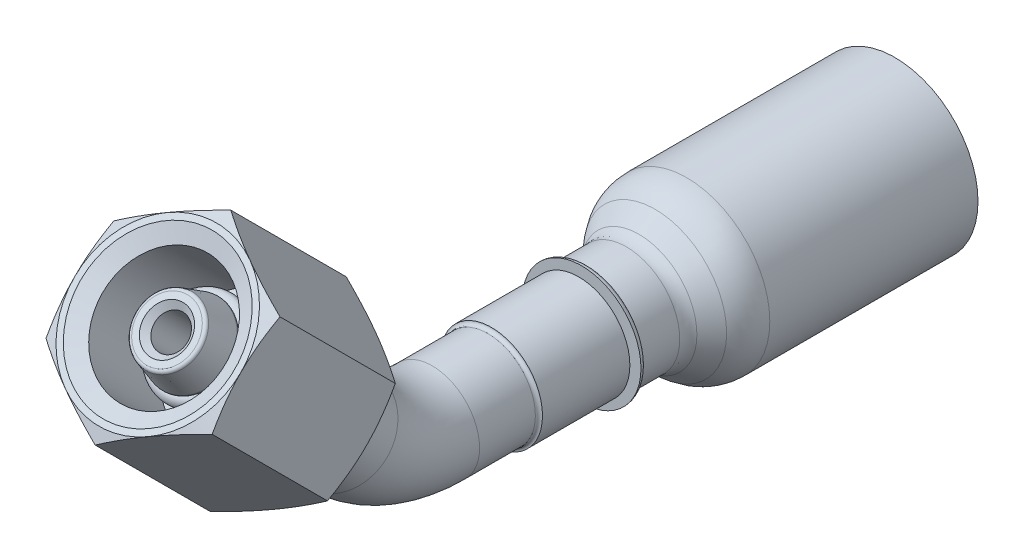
ISO-10303-21;
HEADER;
FILE_DESCRIPTION(('STEP AP214'),'2;1');
FILE_NAME('part.step','',(''),(''),'','','');
FILE_SCHEMA(('AUTOMOTIVE_DESIGN { 1 0 10303 214 1 1 1 1 }'));
ENDSEC;
DATA;
#1=APPLICATION_CONTEXT('core data for automotive mechanical design processes');
#2=APPLICATION_PROTOCOL_DEFINITION('international standard','automotive_design',2000,#1);
#3=PRODUCT_CONTEXT('',#1,'mechanical');
#4=PRODUCT('Part','Part','',(#3));
#5=PRODUCT_RELATED_PRODUCT_CATEGORY('part','',(#4));
#6=PRODUCT_DEFINITION_FORMATION('','',#4);
#7=PRODUCT_DEFINITION_CONTEXT('part definition',#1,'design');
#8=PRODUCT_DEFINITION('design','',#6,#7);
#9=PRODUCT_DEFINITION_SHAPE('','',#8);
#10=(LENGTH_UNIT() NAMED_UNIT(*) SI_UNIT(.MILLI.,.METRE.));
#11=(NAMED_UNIT(*) PLANE_ANGLE_UNIT() SI_UNIT($,.RADIAN.));
#12=(NAMED_UNIT(*) SI_UNIT($,.STERADIAN.) SOLID_ANGLE_UNIT());
#13=UNCERTAINTY_MEASURE_WITH_UNIT(LENGTH_MEASURE(1.E-05),#10,'distance_accuracy_value','');
#14=(GEOMETRIC_REPRESENTATION_CONTEXT(3) GLOBAL_UNCERTAINTY_ASSIGNED_CONTEXT((#13)) GLOBAL_UNIT_ASSIGNED_CONTEXT((#10,
#11,#12)) REPRESENTATION_CONTEXT('',''));
#15=CARTESIAN_POINT('',(0.,0.,0.));
#16=DIRECTION('',(0.,0.,1.));
#17=DIRECTION('',(1.,0.,0.));
#18=AXIS2_PLACEMENT_3D('',#15,#16,#17);
#19=CARTESIAN_POINT('',(0.,0.,21.8128173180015));
#20=DIRECTION('',(0.,0.,1.));
#21=DIRECTION('',(1.,0.,0.));
#22=AXIS2_PLACEMENT_3D('',#19,#20,#21);
#23=CYLINDRICAL_SURFACE('',#22,3.6);
#24=CARTESIAN_POINT('',(0.,0.,22.7256346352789));
#25=DIRECTION('',(0.,0.,-1.));
#26=DIRECTION('',(0.,1.,0.));
#27=AXIS2_PLACEMENT_3D('',#24,#25,#26);
#28=CIRCLE('',#27,3.59999999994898);
#29=CARTESIAN_POINT('',(0.,3.59999999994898,22.7256346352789));
#30=VERTEX_POINT('',#29);
#31=EDGE_CURVE('P0_E82',#30,#30,#28,.F.);
#32=ORIENTED_EDGE('',*,*,#31,.F.);
#33=EDGE_LOOP('',(#32));
#34=FACE_BOUND('',#33,.T.);
#35=CARTESIAN_POINT('',(0.,0.,20.9));
#36=DIRECTION('',(0.,0.,1.));
#37=DIRECTION('',(1.,0.,0.));
#38=AXIS2_PLACEMENT_3D('',#35,#36,#37);
#39=CIRCLE('',#38,3.6);
#40=CARTESIAN_POINT('',(3.6,0.,20.9));
#41=VERTEX_POINT('',#40);
#42=EDGE_CURVE('P0_E86',#41,#41,#39,.T.);
#43=ORIENTED_EDGE('',*,*,#42,.T.);
#44=EDGE_LOOP('',(#43));
#45=FACE_BOUND('',#44,.T.);
#46=ADVANCED_FACE('P0_F16',(#34,#45),#23,.T.);
#47=CARTESIAN_POINT('',(0.,3.025,20.9));
#48=DIRECTION('',(0.,0.,1.));
#49=DIRECTION('',(1.,0.,0.));
#50=AXIS2_PLACEMENT_3D('',#47,#48,#49);
#51=PLANE('',#50);
#52=CARTESIAN_POINT('',(-2.85,0.,20.9));
#53=CARTESIAN_POINT('',(-2.84999370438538,0.0357804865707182,20.8999999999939));
#54=CARTESIAN_POINT('',(-2.84931376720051,0.0715608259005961,20.8999999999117));
#55=CARTESIAN_POINT('',(-2.84660907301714,0.143070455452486,20.8999999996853));
#56=CARTESIAN_POINT('',(-2.84458432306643,0.178799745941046,20.8999999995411));
#57=CARTESIAN_POINT('',(-2.83919247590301,0.250156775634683,20.8999999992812));
#58=CARTESIAN_POINT('',(-2.83582538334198,0.285784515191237,20.8999999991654));
#59=CARTESIAN_POINT('',(-2.82775372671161,0.356888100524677,20.8999999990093));
#60=CARTESIAN_POINT('',(-2.82304916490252,0.39236394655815,20.8999999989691));
#61=CARTESIAN_POINT('',(-2.81230919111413,0.463113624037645,20.8999999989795));
#62=CARTESIAN_POINT('',(-2.8062737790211,0.498387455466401,20.8999999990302));
#63=CARTESIAN_POINT('',(-2.79288064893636,0.568683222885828,20.8999999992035));
#64=CARTESIAN_POINT('',(-2.78552292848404,0.603705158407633,20.8999999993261));
#65=CARTESIAN_POINT('',(-2.76949554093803,0.673447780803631,20.8999999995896));
#66=CARTESIAN_POINT('',(-2.76082586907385,0.708168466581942,20.8999999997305));
#67=CARTESIAN_POINT('',(-2.74218693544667,0.777259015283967,20.8999999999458));
#68=CARTESIAN_POINT('',(-2.73221766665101,0.811628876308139,20.9000000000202));
#69=CARTESIAN_POINT('',(-2.70947735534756,0.884852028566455,20.8999999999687));
#70=CARTESIAN_POINT('',(-2.69650951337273,0.923644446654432,20.8999999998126));
#71=CARTESIAN_POINT('',(-2.67181848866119,0.992541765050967,20.899999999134));
#72=CARTESIAN_POINT('',(-2.66040666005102,1.02275875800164,20.8999999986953));
#73=CARTESIAN_POINT('',(-2.63693678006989,1.08184495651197,20.899999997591));
#74=CARTESIAN_POINT('',(-2.62491027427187,1.11072668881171,20.899999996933));
#75=CARTESIAN_POINT('',(-2.59834198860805,1.17168295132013,20.8999999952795));
#76=CARTESIAN_POINT('',(-2.58367404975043,1.20370258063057,20.899999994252));
#77=CARTESIAN_POINT('',(-2.55375995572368,1.2659318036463,20.8999999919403));
#78=CARTESIAN_POINT('',(-2.53855900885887,1.29616314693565,20.8999999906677));
#79=CARTESIAN_POINT('',(-2.50773245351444,1.35484332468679,20.8999999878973));
#80=CARTESIAN_POINT('',(-2.49214947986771,1.38331455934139,20.8999999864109));
#81=CARTESIAN_POINT('',(-2.46070382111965,1.43850856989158,20.8999999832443));
#82=CARTESIAN_POINT('',(-2.44488123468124,1.46525420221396,20.8999999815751));
#83=CARTESIAN_POINT('',(-2.41309214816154,1.51703737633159,20.8999999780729));
#84=CARTESIAN_POINT('',(-2.3971632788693,1.54209801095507,20.8999999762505));
#85=CARTESIAN_POINT('',(-2.36528967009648,1.59055506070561,20.8999999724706));
#86=CARTESIAN_POINT('',(-2.34938010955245,1.61397467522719,20.8999999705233));
#87=CARTESIAN_POINT('',(-2.30299350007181,1.68011553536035,20.899999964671));
#88=CARTESIAN_POINT('',(-2.27167282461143,1.72225007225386,20.8999999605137));
#89=CARTESIAN_POINT('',(-2.2101716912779,1.80038288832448,20.899999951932));
#90=CARTESIAN_POINT('',(-2.18021804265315,1.83656033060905,20.8999999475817));
#91=CARTESIAN_POINT('',(-2.12218646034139,1.90322594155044,20.8999999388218));
#92=CARTESIAN_POINT('',(-2.09430225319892,1.93388281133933,20.8999999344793));
#93=CARTESIAN_POINT('',(-2.04102876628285,1.9899479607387,20.8999999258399));
#94=CARTESIAN_POINT('',(-2.01580238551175,2.01551113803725,20.8999999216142));
#95=CARTESIAN_POINT('',(-1.96835615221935,2.0618076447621,20.8999999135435));
#96=CARTESIAN_POINT('',(-1.94627068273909,2.08267907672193,20.89999990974));
#97=CARTESIAN_POINT('',(-1.89125387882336,2.13303227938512,20.8999998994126));
#98=CARTESIAN_POINT('',(-1.85795557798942,2.16211571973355,20.8999998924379));
#99=CARTESIAN_POINT('',(-1.80702073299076,2.20455251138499,20.8999998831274));
#100=CARTESIAN_POINT('',(-1.78987634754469,2.21850121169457,20.8999998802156));
#101=CARTESIAN_POINT('',(-1.77045604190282,2.23393738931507,20.8999998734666));
#102=CARTESIAN_POINT('',(-1.76833415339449,2.23561914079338,20.8999998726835));
#103=CARTESIAN_POINT('',(-1.74926593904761,2.25069258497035,20.8999998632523));
#104=CARTESIAN_POINT('',(-1.73218489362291,2.26391539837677,20.8999998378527));
#105=CARTESIAN_POINT('',(-1.69760183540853,2.29003221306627,20.8999998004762));
#106=CARTESIAN_POINT('',(-1.68009782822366,2.30292356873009,20.8999997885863));
#107=CARTESIAN_POINT('',(-1.63128869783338,2.33800674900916,20.8999997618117));
#108=CARTESIAN_POINT('',(-1.5996719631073,2.35976711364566,20.8999997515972));
#109=CARTESIAN_POINT('',(-1.53521738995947,2.4022001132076,20.8999997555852));
#110=CARTESIAN_POINT('',(-1.50236995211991,2.42285817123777,20.8999997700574));
#111=CARTESIAN_POINT('',(-1.4499416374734,2.45433325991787,20.8999998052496));
#112=CARTESIAN_POINT('',(-1.43063618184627,2.46561155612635,20.8999998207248));
#113=CARTESIAN_POINT('',(-1.39164077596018,2.48776969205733,20.8999998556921));
#114=CARTESIAN_POINT('',(-1.37194919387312,2.49864666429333,20.8999998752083));
#115=CARTESIAN_POINT('',(-1.33410089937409,2.51896886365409,20.8999999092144));
#116=CARTESIAN_POINT('',(-1.31596598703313,2.52845472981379,20.8999999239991));
#117=CARTESIAN_POINT('',(-1.28032506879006,2.54661688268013,20.8999999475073));
#118=CARTESIAN_POINT('',(-1.26282781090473,2.55531037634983,20.8999999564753));
#119=CARTESIAN_POINT('',(-1.20746044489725,2.58211921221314,20.8999999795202));
#120=CARTESIAN_POINT('',(-1.16927411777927,2.59958720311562,20.8999999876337));
#121=CARTESIAN_POINT('',(-1.09681303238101,2.63084262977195,20.8999999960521));
#122=CARTESIAN_POINT('',(-1.06261993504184,2.64482007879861,20.8999999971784));
#123=CARTESIAN_POINT('',(-1.00645012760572,2.66654005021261,20.899999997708));
#124=CARTESIAN_POINT('',(-0.984625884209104,2.67467865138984,20.899999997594));
#125=CARTESIAN_POINT('',(-0.943213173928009,2.68956580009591,20.8999999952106));
#126=CARTESIAN_POINT('',(-0.923644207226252,2.69636856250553,20.8999999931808));
#127=CARTESIAN_POINT('',(-0.884624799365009,2.70946522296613,20.8999999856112));
#128=CARTESIAN_POINT('',(-0.865176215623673,2.71576466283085,20.8999999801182));
#129=CARTESIAN_POINT('',(-0.811509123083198,2.73250333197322,20.8999999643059));
#130=CARTESIAN_POINT('',(-0.777152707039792,2.74250407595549,20.8999999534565));
#131=CARTESIAN_POINT('',(-0.708085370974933,2.7611956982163,20.8999999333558));
#132=CARTESIAN_POINT('',(-0.673374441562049,2.76988654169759,20.8999999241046));
#133=CARTESIAN_POINT('',(-0.603646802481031,2.78594393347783,20.8999999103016));
#134=CARTESIAN_POINT('',(-0.568630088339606,2.79331046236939,20.89999990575));
#135=CARTESIAN_POINT('',(-0.498342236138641,2.80670894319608,20.8999999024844));
#136=CARTESIAN_POINT('',(-0.463071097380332,2.8127408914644,20.8999999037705));
#137=CARTESIAN_POINT('',(-0.392325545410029,2.82346130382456,20.8999999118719));
#138=CARTESIAN_POINT('',(-0.356851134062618,2.82814978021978,20.8999999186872));
#139=CARTESIAN_POINT('',(-0.285750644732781,2.83617652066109,20.8999999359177));
#140=CARTESIAN_POINT('',(-0.250124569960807,2.83951481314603,20.899999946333));
#141=CARTESIAN_POINT('',(-0.178772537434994,2.84483627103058,20.8999999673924));
#142=CARTESIAN_POINT('',(-0.143046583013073,2.84681948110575,20.8999999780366));
#143=CARTESIAN_POINT('',(-0.0715467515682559,2.84942839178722,20.8999999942));
#144=CARTESIAN_POINT('',(-0.0357728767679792,2.8500541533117,20.8999999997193));
#145=CARTESIAN_POINT('',(0.,2.85,20.9));
#146=B_SPLINE_CURVE_WITH_KNOTS('',3,(#52,#53,#54,#55,#56,#57,#58,#59,#60,#61,#62,#63,#64,#65,
#66,#67,#68,#69,#70,#71,#72,#73,#74,#75,#76,#77,#78,#79,#80,#81,#82,#83,#84,#85,#86,#87,#88,#89,
#90,#91,#92,#93,#94,#95,#96,#97,#98,#99,#100,#101,#102,#103,#104,#105,#106,#107,#108,#109,#110,
#111,#112,#113,#114,#115,#116,#117,#118,#119,#120,#121,#122,#123,#124,#125,#126,#127,#128,#129,
#130,#131,#132,#133,#134,#135,#136,#137,#138,#139,#140,#141,#142,#143,#144,#145),.UNSPECIFIED.,
.F.,.F.,(4,2,2,2,2,2,2,2,2,2,2,2,2,2,2,2,2,2,2,2,2,2,2,2,2,2,2,2,2,2,2,2,2,2,2,2,2,2,2,2,2,2,2,
2,2,2,4),(0.,0.107335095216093,0.214669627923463,0.322003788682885,0.429337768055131,
0.536671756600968,0.644005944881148,0.751340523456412,0.858675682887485,0.981343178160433,
1.07822567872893,1.17206588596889,1.27769927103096,1.37919165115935,1.4765428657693,
1.56975276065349,1.65882118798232,1.74374800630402,1.90116128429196,2.04201084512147,
2.1662948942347,2.27401184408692,2.36516031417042,2.49773851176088,2.56403917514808,
2.57216176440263,2.63695838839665,2.70216966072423,2.81727991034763,2.93365481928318,
3.00072459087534,3.06820564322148,3.12959877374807,3.18820940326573,3.31414085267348,
3.4249326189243,3.49480355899,3.55695176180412,3.61827769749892,3.72559684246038,
3.83291883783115,3.94024240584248,4.04756626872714,4.15488914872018,4.26220976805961,
4.36952684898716,4.47683911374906),.UNSPECIFIED.);
#147=CARTESIAN_POINT('',(-2.84999999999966,0.,20.9));
#148=VERTEX_POINT('',#147);
#149=CARTESIAN_POINT('',(-2.84400056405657E-07,2.85000000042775,20.9));
#150=VERTEX_POINT('',#149);
#151=EDGE_CURVE('P0_E76',#148,#150,#146,.T.);
#152=ORIENTED_EDGE('',*,*,#151,.F.);
#153=CARTESIAN_POINT('',(0.,0.,20.9));
#154=DIRECTION('',(0.,0.,1.));
#155=DIRECTION('',(0.,-1.,0.));
#156=AXIS2_PLACEMENT_3D('',#153,#154,#155);
#157=CIRCLE('',#156,2.84999999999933);
#158=CARTESIAN_POINT('',(2.84999999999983,0.,20.9));
#159=VERTEX_POINT('',#158);
#160=EDGE_CURVE('P0_E74',#159,#148,#157,.F.);
#161=ORIENTED_EDGE('',*,*,#160,.F.);
#162=CARTESIAN_POINT('',(0.,2.85,20.9));
#163=CARTESIAN_POINT('',(0.0357804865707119,2.84999370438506,20.8999999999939));
#164=CARTESIAN_POINT('',(0.0715608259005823,2.8493137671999,20.8999999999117));
#165=CARTESIAN_POINT('',(0.143070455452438,2.84660907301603,20.8999999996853));
#166=CARTESIAN_POINT('',(0.178799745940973,2.8445843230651,20.8999999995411));
#167=CARTESIAN_POINT('',(0.250156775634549,2.83919247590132,20.8999999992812));
#168=CARTESIAN_POINT('',(0.285784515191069,2.83582538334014,20.8999999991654));
#169=CARTESIAN_POINT('',(0.35688810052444,2.82775372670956,20.8999999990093));
#170=CARTESIAN_POINT('',(0.392363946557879,2.82304916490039,20.8999999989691));
#171=CARTESIAN_POINT('',(0.463113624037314,2.81230919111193,20.8999999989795));
#172=CARTESIAN_POINT('',(0.498387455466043,2.8062737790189,20.8999999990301));
#173=CARTESIAN_POINT('',(0.568683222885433,2.79288064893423,20.8999999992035));
#174=CARTESIAN_POINT('',(0.603705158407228,2.78552292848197,20.8999999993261));
#175=CARTESIAN_POINT('',(0.673447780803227,2.76949554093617,20.8999999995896));
#176=CARTESIAN_POINT('',(0.70816846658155,2.76082586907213,20.8999999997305));
#177=CARTESIAN_POINT('',(0.777259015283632,2.74218693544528,20.8999999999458));
#178=CARTESIAN_POINT('',(0.811628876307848,2.73221766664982,20.9000000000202));
#179=CARTESIAN_POINT('',(0.884852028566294,2.70947735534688,20.8999999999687));
#180=CARTESIAN_POINT('',(0.923644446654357,2.69650951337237,20.8999999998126));
#181=CARTESIAN_POINT('',(0.992541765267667,2.67181848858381,20.899999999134));
#182=CARTESIAN_POINT('',(1.02275875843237,2.66040665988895,20.8999999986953));
#183=CARTESIAN_POINT('',(1.08184495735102,2.63693677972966,20.899999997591));
#184=CARTESIAN_POINT('',(1.11072668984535,2.62491027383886,20.899999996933));
#185=CARTESIAN_POINT('',(1.17168295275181,2.59834198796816,20.8999999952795));
#186=CARTESIAN_POINT('',(1.20370258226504,2.58367404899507,20.899999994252));
#187=CARTESIAN_POINT('',(1.26593180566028,2.55375995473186,20.8999999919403));
#188=CARTESIAN_POINT('',(1.29616314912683,2.538559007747,20.8999999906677));
#189=CARTESIAN_POINT('',(1.35484332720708,2.50773245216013,20.8999999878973));
#190=CARTESIAN_POINT('',(1.38331456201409,2.49214947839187,20.8999999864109));
#191=CARTESIAN_POINT('',(1.43850857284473,2.46070381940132,20.8999999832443));
#192=CARTESIAN_POINT('',(1.46525420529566,2.44488123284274,20.8999999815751));
#193=CARTESIAN_POINT('',(1.51703737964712,2.4130921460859,20.8999999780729));
#194=CARTESIAN_POINT('',(1.54209801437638,2.39716327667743,20.8999999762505));
#195=CARTESIAN_POINT('',(1.59055506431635,2.36528966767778,20.8999999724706));
#196=CARTESIAN_POINT('',(1.6139746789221,2.34938010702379,20.8999999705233));
#197=CARTESIAN_POINT('',(1.68011553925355,2.30299349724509,20.899999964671));
#198=CARTESIAN_POINT('',(1.72225007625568,2.27167282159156,20.8999999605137));
#199=CARTESIAN_POINT('',(1.8003828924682,2.21017168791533,20.899999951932));
#200=CARTESIAN_POINT('',(1.8365603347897,2.18021803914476,20.8999999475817));
#201=CARTESIAN_POINT('',(1.90322594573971,2.12218645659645,20.8999999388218));
#202=CARTESIAN_POINT('',(1.93388281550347,2.09430224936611,20.8999999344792));
#203=CARTESIAN_POINT('',(1.98994796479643,2.0410287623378,20.8999999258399));
#204=CARTESIAN_POINT('',(2.0155111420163,2.01580238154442,20.8999999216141));
#205=CARTESIAN_POINT('',(2.06180764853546,1.96835614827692,20.8999999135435));
#206=CARTESIAN_POINT('',(2.08267908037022,1.94627067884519,20.89999990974));
#207=CARTESIAN_POINT('',(2.13303228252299,1.89125387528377,20.8999998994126));
#208=CARTESIAN_POINT('',(2.16211572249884,1.85795557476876,20.8999998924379));
#209=CARTESIAN_POINT('',(2.20455251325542,1.80702073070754,20.8999998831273));
#210=CARTESIAN_POINT('',(2.21850121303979,1.78987634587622,20.8999998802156));
#211=CARTESIAN_POINT('',(2.23393738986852,1.77045604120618,20.8999998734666));
#212=CARTESIAN_POINT('',(2.23561914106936,1.76833415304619,20.8999998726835));
#213=CARTESIAN_POINT('',(2.25069258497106,1.74926593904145,20.8999998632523));
#214=CARTESIAN_POINT('',(2.26391539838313,1.73218489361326,20.8999998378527));
#215=CARTESIAN_POINT('',(2.29003221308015,1.6976018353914,20.8999998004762));
#216=CARTESIAN_POINT('',(2.30292356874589,1.68009782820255,20.8999997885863));
#217=CARTESIAN_POINT('',(2.33800674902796,1.63128869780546,20.8999997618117));
#218=CARTESIAN_POINT('',(2.35976711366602,1.59967196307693,20.8999997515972));
#219=CARTESIAN_POINT('',(2.40220011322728,1.53521738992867,20.8999997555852));
#220=CARTESIAN_POINT('',(2.42285817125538,1.50236995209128,20.8999997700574));
#221=CARTESIAN_POINT('',(2.45433325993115,1.44994163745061,20.8999998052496));
#222=CARTESIAN_POINT('',(2.46561155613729,1.43063618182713,20.8999998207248));
#223=CARTESIAN_POINT('',(2.48776969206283,1.39164077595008,20.8999998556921));
#224=CARTESIAN_POINT('',(2.49864666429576,1.37194919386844,20.8999998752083));
#225=CARTESIAN_POINT('',(2.51896886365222,1.33410089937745,20.8999999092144));
#226=CARTESIAN_POINT('',(2.52845472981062,1.31596598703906,20.899999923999));
#227=CARTESIAN_POINT('',(2.54661688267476,1.28032506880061,20.8999999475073));
#228=CARTESIAN_POINT('',(2.55531037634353,1.26282781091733,20.8999999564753));
#229=CARTESIAN_POINT('',(2.58211921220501,1.20746044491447,20.8999999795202));
#230=CARTESIAN_POINT('',(2.59958720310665,1.16927411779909,20.8999999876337));
#231=CARTESIAN_POINT('',(2.63084262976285,1.09681303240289,20.8999999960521));
#232=CARTESIAN_POINT('',(2.6448200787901,1.06261993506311,20.8999999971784));
#233=CARTESIAN_POINT('',(2.66654005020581,1.00645012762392,20.899999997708));
#234=CARTESIAN_POINT('',(2.67467865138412,0.984625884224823,20.899999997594));
#235=CARTESIAN_POINT('',(2.68956580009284,0.943213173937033,20.8999999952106));
#236=CARTESIAN_POINT('',(2.69636856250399,0.923644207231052,20.8999999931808));
#237=CARTESIAN_POINT('',(2.70946522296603,0.884624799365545,20.8999999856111));
#238=CARTESIAN_POINT('',(2.71576466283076,0.865176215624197,20.8999999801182));
#239=CARTESIAN_POINT('',(2.73250333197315,0.811509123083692,20.8999999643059));
#240=CARTESIAN_POINT('',(2.74250407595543,0.777152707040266,20.8999999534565));
#241=CARTESIAN_POINT('',(2.76119569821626,0.708085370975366,20.8999999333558));
#242=CARTESIAN_POINT('',(2.76988654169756,0.673374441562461,20.8999999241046));
#243=CARTESIAN_POINT('',(2.78594393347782,0.603646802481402,20.8999999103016));
#244=CARTESIAN_POINT('',(2.79331046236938,0.568630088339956,20.89999990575));
#245=CARTESIAN_POINT('',(2.80670894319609,0.498342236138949,20.8999999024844));
#246=CARTESIAN_POINT('',(2.81274089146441,0.463071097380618,20.8999999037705));
#247=CARTESIAN_POINT('',(2.82346130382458,0.39232554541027,20.8999999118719));
#248=CARTESIAN_POINT('',(2.82814978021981,0.356851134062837,20.8999999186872));
#249=CARTESIAN_POINT('',(2.83617652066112,0.285750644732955,20.8999999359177));
#250=CARTESIAN_POINT('',(2.83951481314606,0.250124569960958,20.899999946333));
#251=CARTESIAN_POINT('',(2.8448362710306,0.1787725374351,20.8999999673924));
#252=CARTESIAN_POINT('',(2.84681948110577,0.143046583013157,20.8999999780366));
#253=CARTESIAN_POINT('',(2.84942839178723,0.0715467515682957,20.8999999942));
#254=CARTESIAN_POINT('',(2.8500541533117,0.0357728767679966,20.8999999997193));
#255=CARTESIAN_POINT('',(2.85,0.,20.9));
#256=B_SPLINE_CURVE_WITH_KNOTS('',3,(#162,#163,#164,#165,#166,#167,#168,#169,#170,#171,#172,
#173,#174,#175,#176,#177,#178,#179,#180,#181,#182,#183,#184,#185,#186,#187,#188,#189,#190,#191,
#192,#193,#194,#195,#196,#197,#198,#199,#200,#201,#202,#203,#204,#205,#206,#207,#208,#209,#210,
#211,#212,#213,#214,#215,#216,#217,#218,#219,#220,#221,#222,#223,#224,#225,#226,#227,#228,#229,
#230,#231,#232,#233,#234,#235,#236,#237,#238,#239,#240,#241,#242,#243,#244,#245,#246,#247,#248,
#249,#250,#251,#252,#253,#254,#255),.UNSPECIFIED.,.F.,.F.,(4,2,2,2,2,2,2,2,2,2,2,2,2,2,2,2,2,2,
2,2,2,2,2,2,2,2,2,2,2,2,2,2,2,2,2,2,2,2,2,2,2,2,2,2,2,2,4),(0.,0.10733509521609,
0.214669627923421,0.322003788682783,0.429337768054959,0.536671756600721,0.644005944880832,
0.751340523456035,0.858675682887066,0.981343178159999,1.07822567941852,1.17206588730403,
1.27769927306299,1.37919165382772,1.47654286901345,1.56975276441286,1.65882119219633,
1.74374801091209,1.90116128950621,2.04201085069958,2.16629489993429,2.27401184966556,
2.36516031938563,2.49773851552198,2.56403917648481,2.57216176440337,2.63695838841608,
2.7021696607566,2.8172799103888,2.93365481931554,3.00072459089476,3.06820564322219,
3.12959877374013,3.18820940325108,3.31414085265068,3.42493261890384,3.49480355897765,
3.55695176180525,3.61827769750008,3.72559684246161,3.83291883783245,3.94024240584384,
4.04756626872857,4.15488914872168,4.26220976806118,4.36952684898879,4.47683911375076),.UNSPECIFIED.);
#257=EDGE_CURVE('P0_E70',#150,#159,#256,.T.);
#258=ORIENTED_EDGE('',*,*,#257,.F.);
#259=EDGE_LOOP('',(#152,#161,#258));
#260=FACE_BOUND('',#259,.T.);
#261=ORIENTED_EDGE('',*,*,#42,.F.);
#262=EDGE_LOOP('',(#261));
#263=FACE_BOUND('',#262,.T.);
#264=ADVANCED_FACE('P0_F80',(#260,#263),#51,.F.);
#265=CARTESIAN_POINT('',(0.,0.,22.7256346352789));
#266=DIRECTION('',(0.,0.,-1.));
#267=DIRECTION('',(-1.,0.,0.));
#268=AXIS2_PLACEMENT_3D('',#265,#266,#267);
#269=CONICAL_SURFACE('',#268,3.59999999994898,1.4835298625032);
#270=CARTESIAN_POINT('',(0.,0.,22.8));
#271=DIRECTION('',(0.,0.,1.));
#272=DIRECTION('',(1.,0.,0.));
#273=AXIS2_PLACEMENT_3D('',#270,#271,#272);
#274=CIRCLE('',#273,2.75);
#275=CARTESIAN_POINT('',(2.75,0.,22.8));
#276=VERTEX_POINT('',#275);
#277=EDGE_CURVE('P0_E78',#276,#276,#274,.T.);
#278=ORIENTED_EDGE('',*,*,#277,.F.);
#279=EDGE_LOOP('',(#278));
#280=FACE_BOUND('',#279,.T.);
#281=ORIENTED_EDGE('',*,*,#31,.T.);
#282=EDGE_LOOP('',(#281));
#283=FACE_BOUND('',#282,.T.);
#284=ADVANCED_FACE('P0_F173',(#280,#283),#269,.T.);
#285=CARTESIAN_POINT('',(0.,0.,20.15));
#286=DIRECTION('',(0.,0.,1.));
#287=DIRECTION('',(0.,-1.,0.));
#288=AXIS2_PLACEMENT_3D('',#285,#286,#287);
#289=TOROIDAL_SURFACE('',#288,2.85,0.75);
#290=ORIENTED_EDGE('',*,*,#160,.T.);
#291=ORIENTED_EDGE('',*,*,#151,.T.);
#292=ORIENTED_EDGE('',*,*,#257,.T.);
#293=EDGE_LOOP('',(#290,#291,#292));
#294=FACE_BOUND('',#293,.T.);
#295=CARTESIAN_POINT('',(0.,0.,20.15));
#296=DIRECTION('',(0.,0.,1.));
#297=DIRECTION('',(1.,0.,0.));
#298=AXIS2_PLACEMENT_3D('',#295,#296,#297);
#299=CIRCLE('',#298,2.1);
#300=CARTESIAN_POINT('',(2.1,0.,20.15));
#301=VERTEX_POINT('',#300);
#302=EDGE_CURVE('P0_E498',#301,#301,#299,.F.);
#303=ORIENTED_EDGE('',*,*,#302,.F.);
#304=EDGE_LOOP('',(#303));
#305=FACE_BOUND('',#304,.T.);
#306=ADVANCED_FACE('P0_F72',(#294,#305),#289,.F.);
#307=CARTESIAN_POINT('',(0.,0.,24.3812751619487));
#308=DIRECTION('',(0.,0.,1.));
#309=DIRECTION('',(1.,0.,0.));
#310=AXIS2_PLACEMENT_3D('',#307,#308,#309);
#311=CYLINDRICAL_SURFACE('',#310,2.75);
#312=CARTESIAN_POINT('',(0.,0.,25.9625503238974));
#313=DIRECTION('',(0.,0.,1.));
#314=DIRECTION('',(1.,0.,0.));
#315=AXIS2_PLACEMENT_3D('',#312,#313,#314);
#316=CIRCLE('',#315,2.75);
#317=CARTESIAN_POINT('',(2.75,0.,25.9625503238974));
#318=VERTEX_POINT('',#317);
#319=EDGE_CURVE('P0_E495',#318,#318,#316,.F.);
#320=ORIENTED_EDGE('',*,*,#319,.T.);
#321=EDGE_LOOP('',(#320));
#322=FACE_BOUND('',#321,.T.);
#323=ORIENTED_EDGE('',*,*,#277,.T.);
#324=EDGE_LOOP('',(#323));
#325=FACE_BOUND('',#324,.T.);
#326=ADVANCED_FACE('P0_F172',(#322,#325),#311,.T.);
#327=CARTESIAN_POINT('',(0.,0.,18.0675303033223));
#328=DIRECTION('',(0.,0.,1.));
#329=DIRECTION('',(1.,0.,0.));
#330=AXIS2_PLACEMENT_3D('',#327,#328,#329);
#331=CYLINDRICAL_SURFACE('',#330,2.1);
#332=CARTESIAN_POINT('',(0.,0.,16.));
#333=DIRECTION('',(0.,0.,1.));
#334=DIRECTION('',(1.,0.,0.));
#335=AXIS2_PLACEMENT_3D('',#332,#333,#334);
#336=CIRCLE('',#335,2.1);
#337=CARTESIAN_POINT('',(2.1,0.,16.));
#338=VERTEX_POINT('',#337);
#339=EDGE_CURVE('P0_E94',#338,#338,#336,.F.);
#340=ORIENTED_EDGE('',*,*,#339,.F.);
#341=EDGE_LOOP('',(#340));
#342=FACE_BOUND('',#341,.T.);
#343=ORIENTED_EDGE('',*,*,#302,.T.);
#344=EDGE_LOOP('',(#343));
#345=FACE_BOUND('',#344,.T.);
#346=ADVANCED_FACE('P0_F425',(#342,#345),#331,.T.);
#347=CARTESIAN_POINT('',(0.,0.,25.9625503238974));
#348=DIRECTION('',(0.,0.,1.));
#349=DIRECTION('',(1.,0.,0.));
#350=AXIS2_PLACEMENT_3D('',#347,#348,#349);
#351=TOROIDAL_SURFACE('',#350,2.9,0.15);
#352=ORIENTED_EDGE('',*,*,#319,.F.);
#353=EDGE_LOOP('',(#352));
#354=FACE_BOUND('',#353,.T.);
#355=CARTESIAN_POINT('',(0.,0.,26.1119794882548));
#356=DIRECTION('',(0.,0.,1.));
#357=DIRECTION('',(0.,1.,0.));
#358=AXIS2_PLACEMENT_3D('',#355,#356,#357);
#359=CIRCLE('',#358,2.88692664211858);
#360=CARTESIAN_POINT('',(0.,2.88692664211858,26.1119794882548));
#361=VERTEX_POINT('',#360);
#362=EDGE_CURVE('P0_E492',#361,#361,#359,.T.);
#363=ORIENTED_EDGE('',*,*,#362,.F.);
#364=EDGE_LOOP('',(#363));
#365=FACE_BOUND('',#364,.T.);
#366=ADVANCED_FACE('P0_F429',(#354,#365),#351,.F.);
#367=CARTESIAN_POINT('',(0.,0.,26.2356073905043));
#368=DIRECTION('',(0.,0.,1.));
#369=DIRECTION('',(1.,0.,0.));
#370=AXIS2_PLACEMENT_3D('',#367,#368,#369);
#371=CONICAL_SURFACE('',#370,4.30000000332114,1.4835298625);
#372=CARTESIAN_POINT('',(0.,0.,26.2356074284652));
#373=DIRECTION('',(0.,0.,1.));
#374=DIRECTION('',(1.,0.,0.));
#375=AXIS2_PLACEMENT_3D('',#372,#373,#374);
#376=CIRCLE('',#375,4.3);
#377=CARTESIAN_POINT('',(4.3,0.,26.2356074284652));
#378=VERTEX_POINT('',#377);
#379=EDGE_CURVE('P0_E489',#378,#378,#376,.T.);
#380=ORIENTED_EDGE('',*,*,#379,.F.);
#381=EDGE_LOOP('',(#380));
#382=FACE_BOUND('',#381,.T.);
#383=ORIENTED_EDGE('',*,*,#362,.T.);
#384=EDGE_LOOP('',(#383));
#385=FACE_BOUND('',#384,.T.);
#386=ADVANCED_FACE('P0_F434',(#382,#385),#371,.T.);
#387=CARTESIAN_POINT('',(0.,0.,0.));
#388=DIRECTION('',(0.,0.,1.));
#389=DIRECTION('',(1.,0.,0.));
#390=AXIS2_PLACEMENT_3D('',#387,#388,#389);
#391=CYLINDRICAL_SURFACE('',#390,4.3);
#392=ORIENTED_EDGE('',*,*,#379,.T.);
#393=EDGE_LOOP('',(#392));
#394=FACE_BOUND('',#393,.T.);
#395=CARTESIAN_POINT('',(0.,0.,33.6));
#396=DIRECTION('',(0.,0.,1.));
#397=DIRECTION('',(0.,-1.,0.));
#398=AXIS2_PLACEMENT_3D('',#395,#396,#397);
#399=CIRCLE('',#398,4.3);
#400=CARTESIAN_POINT('',(0.,-4.3,33.6));
#401=VERTEX_POINT('',#400);
#402=EDGE_CURVE('P0_E486',#401,#401,#399,.T.);
#403=ORIENTED_EDGE('',*,*,#402,.F.);
#404=EDGE_LOOP('',(#403));
#405=FACE_BOUND('',#404,.T.);
#406=ADVANCED_FACE('P0_F512',(#394,#405),#391,.T.);
#407=CARTESIAN_POINT('',(0.,0.,33.9));
#408=DIRECTION('',(0.,0.,-1.));
#409=DIRECTION('',(-1.,0.,0.));
#410=AXIS2_PLACEMENT_3D('',#407,#408,#409);
#411=TOROIDAL_SURFACE('',#410,4.3,0.3);
#412=CARTESIAN_POINT('',(0.,0.,33.9));
#413=DIRECTION('',(0.,0.,1.));
#414=DIRECTION('',(1.,0.,0.));
#415=AXIS2_PLACEMENT_3D('',#412,#413,#414);
#416=CIRCLE('',#415,4.);
#417=CARTESIAN_POINT('',(4.,0.,33.9));
#418=VERTEX_POINT('',#417);
#419=EDGE_CURVE('P0_E483',#418,#418,#416,.T.);
#420=ORIENTED_EDGE('',*,*,#419,.F.);
#421=EDGE_LOOP('',(#420));
#422=FACE_BOUND('',#421,.T.);
#423=ORIENTED_EDGE('',*,*,#402,.T.);
#424=EDGE_LOOP('',(#423));
#425=FACE_BOUND('',#424,.T.);
#426=ADVANCED_FACE('P0_F174',(#422,#425),#411,.F.);
#427=CARTESIAN_POINT('',(0.,0.,33.6));
#428=DIRECTION('',(0.,0.,1.));
#429=DIRECTION('',(1.,0.,0.));
#430=AXIS2_PLACEMENT_3D('',#427,#428,#429);
#431=CYLINDRICAL_SURFACE('',#430,4.);
#432=ORIENTED_EDGE('',*,*,#419,.T.);
#433=EDGE_LOOP('',(#432));
#434=FACE_BOUND('',#433,.T.);
#435=CARTESIAN_POINT('',(0.,0.,38.6));
#436=DIRECTION('',(0.,0.,1.));
#437=DIRECTION('',(0.,-1.,0.));
#438=AXIS2_PLACEMENT_3D('',#435,#436,#437);
#439=CIRCLE('',#438,4.);
#440=CARTESIAN_POINT('',(0.,-4.00000000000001,38.6));
#441=VERTEX_POINT('',#440);
#442=EDGE_CURVE('P0_E480',#441,#441,#439,.T.);
#443=ORIENTED_EDGE('',*,*,#442,.F.);
#444=EDGE_LOOP('',(#443));
#445=FACE_BOUND('',#444,.T.);
#446=ADVANCED_FACE('P0_F452',(#434,#445),#431,.T.);
#447=CARTESIAN_POINT('',(0.,11.,38.6));
#448=DIRECTION('',(-1.,0.,0.));
#449=DIRECTION('',(0.,0.,1.));
#450=AXIS2_PLACEMENT_3D('',#447,#448,#449);
#451=TOROIDAL_SURFACE('',#450,11.,4.);
#452=CARTESIAN_POINT('',(0.,3.22182540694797,46.378174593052));
#453=DIRECTION('',(0.,0.707106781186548,0.707106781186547));
#454=DIRECTION('',(0.,-0.707106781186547,0.707106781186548));
#455=AXIS2_PLACEMENT_3D('',#452,#453,#454);
#456=CIRCLE('',#455,4.);
#457=CARTESIAN_POINT('',(0.,0.393398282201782,49.2066017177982));
#458=VERTEX_POINT('',#457);
#459=EDGE_CURVE('P0_E477',#458,#458,#456,.T.);
#460=ORIENTED_EDGE('',*,*,#459,.F.);
#461=EDGE_LOOP('',(#460));
#462=FACE_BOUND('',#461,.T.);
#463=ORIENTED_EDGE('',*,*,#442,.T.);
#464=EDGE_LOOP('',(#463));
#465=FACE_BOUND('',#464,.T.);
#466=ADVANCED_FACE('P0_F447',(#462,#465),#451,.T.);
#467=CARTESIAN_POINT('',(0.,3.22182540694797,46.378174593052));
#468=DIRECTION('',(0.,0.707106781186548,0.707106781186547));
#469=DIRECTION('',(0.,-0.707106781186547,0.707106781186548));
#470=AXIS2_PLACEMENT_3D('',#467,#468,#469);
#471=CYLINDRICAL_SURFACE('',#470,4.);
#472=CARTESIAN_POINT('',(0.,7.04020202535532,50.1965512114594));
#473=DIRECTION('',(0.,0.707106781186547,0.707106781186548));
#474=DIRECTION('',(0.,-0.707106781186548,0.707106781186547));
#475=AXIS2_PLACEMENT_3D('',#472,#473,#474);
#476=CIRCLE('',#475,4.);
#477=CARTESIAN_POINT('',(0.,4.21177490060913,53.0249783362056));
#478=VERTEX_POINT('',#477);
#479=EDGE_CURVE('P0_E474',#478,#478,#476,.T.);
#480=ORIENTED_EDGE('',*,*,#479,.F.);
#481=EDGE_LOOP('',(#480));
#482=FACE_BOUND('',#481,.T.);
#483=ORIENTED_EDGE('',*,*,#459,.T.);
#484=EDGE_LOOP('',(#483));
#485=FACE_BOUND('',#484,.T.);
#486=ADVANCED_FACE('P0_F451',(#482,#485),#471,.T.);
#487=CARTESIAN_POINT('',(0.,7.04020202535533,50.1965512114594));
#488=DIRECTION('',(0.,-0.707106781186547,-0.707106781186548));
#489=DIRECTION('',(0.,0.707106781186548,-0.707106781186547));
#490=AXIS2_PLACEMENT_3D('',#487,#488,#489);
#491=TOROIDAL_SURFACE('',#490,4.3,0.299999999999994);
#492=ORIENTED_EDGE('',*,*,#479,.T.);
#493=EDGE_LOOP('',(#492));
#494=FACE_BOUND('',#493,.T.);
#495=CARTESIAN_POINT('',(0.,7.25233405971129,50.4086832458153));
#496=DIRECTION('',(0.,-0.707106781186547,-0.707106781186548));
#497=DIRECTION('',(0.,0.707106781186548,-0.707106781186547));
#498=AXIS2_PLACEMENT_3D('',#495,#496,#497);
#499=CIRCLE('',#498,4.29999999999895);
#500=CARTESIAN_POINT('',(4.29999999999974,7.25233405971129,50.4086832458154));
#501=VERTEX_POINT('',#500);
#502=CARTESIAN_POINT('',(-4.29999999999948,7.25233405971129,50.4086832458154));
#503=VERTEX_POINT('',#502);
#504=EDGE_CURVE('P0_E90',#501,#503,#499,.F.);
#505=ORIENTED_EDGE('',*,*,#504,.F.);
#506=CARTESIAN_POINT('',(-4.3,7.25233405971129,50.4086832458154));
#507=CARTESIAN_POINT('',(-4.29989883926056,6.67237544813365,50.988641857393));
#508=CARTESIAN_POINT('',(-3.99808969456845,6.13312031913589,51.5278969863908));
#509=CARTESIAN_POINT('',(-3.83786776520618,5.84684503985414,51.8141722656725));
#510=CARTESIAN_POINT('',(-3.5990806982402,5.58851043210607,52.0725068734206));
#511=CARTESIAN_POINT('',(-3.35575860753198,5.32526955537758,52.3357477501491));
#512=CARTESIAN_POINT('',(-3.04055915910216,5.10233405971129,52.5586832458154));
#513=CARTESIAN_POINT('',(-2.72611705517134,4.87993422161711,52.7810830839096));
#514=CARTESIAN_POINT('',(-2.35300193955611,4.70739969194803,52.9536176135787));
#515=CARTESIAN_POINT('',(-1.98859869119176,4.53889367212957,53.1221236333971));
#516=CARTESIAN_POINT('',(-1.58280725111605,4.42525772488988,53.2357595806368));
#517=CARTESIAN_POINT('',(-0.82072043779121,4.21184647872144,53.4491708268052));
#518=CARTESIAN_POINT('',(0.,4.21177490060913,53.4492424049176));
#519=CARTESIAN_POINT('',(0.819674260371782,4.2117034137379,53.4493138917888));
#520=CARTESIAN_POINT('',(1.58280725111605,4.42525772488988,53.2357595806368));
#521=CARTESIAN_POINT('',(1.98766163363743,4.53855173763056,53.1224655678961));
#522=CARTESIAN_POINT('',(2.35300193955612,4.70739969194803,52.9536176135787));
#523=CARTESIAN_POINT('',(2.7252807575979,4.87945439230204,52.7815629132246));
#524=CARTESIAN_POINT('',(3.04055915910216,5.10233405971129,52.5586832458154));
#525=CARTESIAN_POINT('',(3.35508002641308,5.32467820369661,52.3363391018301));
#526=CARTESIAN_POINT('',(3.5990806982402,5.58851043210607,52.0725068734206));
#527=CARTESIAN_POINT('',(3.8373841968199,5.84618244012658,51.8148348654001));
#528=CARTESIAN_POINT('',(3.99808969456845,6.13312031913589,51.5278969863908));
#529=CARTESIAN_POINT('',(4.29989877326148,6.67199707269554,50.9890202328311));
#530=CARTESIAN_POINT('',(4.3,7.25233405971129,50.4086832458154));
#531=B_SPLINE_CURVE_WITH_KNOTS('',2,(#506,#507,#508,#509,#510,#511,#512,#513,#514,#515,#516,
#517,#518,#519,#520,#521,#522,#523,#524,#525,#526,#527,#528,#529,#530),.UNSPECIFIED.,.F.,.F.,(3,
2,2,2,2,2,2,2,2,2,2,2,3),(0.,0.125,0.1875,0.25,0.3125,0.375,0.5,0.625,0.6875,0.75,0.8125,0.875,
1.),.UNSPECIFIED.);
#532=EDGE_CURVE('P0_E442',#503,#501,#531,.T.);
#533=ORIENTED_EDGE('',*,*,#532,.F.);
#534=EDGE_LOOP('',(#505,#533));
#535=FACE_BOUND('',#534,.T.);
#536=ADVANCED_FACE('P0_F205',(#494,#535),#491,.F.);
#537=CARTESIAN_POINT('',(0.,7.25233405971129,50.4086832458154));
#538=DIRECTION('',(0.,-0.707106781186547,-0.707106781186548));
#539=DIRECTION('',(0.,0.707106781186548,-0.707106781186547));
#540=AXIS2_PLACEMENT_3D('',#537,#538,#539);
#541=PLANE('',#540);
#542=ORIENTED_EDGE('',*,*,#532,.T.);
#543=ORIENTED_EDGE('',*,*,#504,.T.);
#544=EDGE_LOOP('',(#542,#543));
#545=FACE_BOUND('',#544,.T.);
#546=CARTESIAN_POINT('',(0.,7.25233405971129,50.4086832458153));
#547=DIRECTION('',(0.,-0.707106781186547,-0.707106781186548));
#548=DIRECTION('',(0.,0.707106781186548,-0.707106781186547));
#549=AXIS2_PLACEMENT_3D('',#546,#547,#548);
#550=CIRCLE('',#549,4.35);
#551=CARTESIAN_POINT('',(0.,10.3282485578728,47.3327687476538));
#552=VERTEX_POINT('',#551);
#553=EDGE_CURVE('P0_E467',#552,#552,#550,.F.);
#554=ORIENTED_EDGE('',*,*,#553,.F.);
#555=EDGE_LOOP('',(#554));
#556=FACE_BOUND('',#555,.T.);
#557=ADVANCED_FACE('P0_F456',(#545,#556),#541,.T.);
#558=CARTESIAN_POINT('',(0.,8.98474567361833,52.1410948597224));
#559=DIRECTION('',(0.,-0.707106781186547,-0.707106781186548));
#560=DIRECTION('',(0.,0.707106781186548,-0.707106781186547));
#561=AXIS2_PLACEMENT_3D('',#558,#559,#560);
#562=CYLINDRICAL_SURFACE('',#561,4.35);
#563=ORIENTED_EDGE('',*,*,#553,.T.);
#564=EDGE_LOOP('',(#563));
#565=FACE_BOUND('',#564,.T.);
#566=CARTESIAN_POINT('',(0.,10.6110912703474,53.7674404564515));
#567=DIRECTION('',(0.,0.707106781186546,0.707106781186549));
#568=DIRECTION('',(0.,-0.707106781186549,0.707106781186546));
#569=AXIS2_PLACEMENT_3D('',#566,#567,#568);
#570=CIRCLE('',#569,4.35);
#571=CARTESIAN_POINT('',(0.,7.53517677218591,56.843354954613));
#572=VERTEX_POINT('',#571);
#573=EDGE_CURVE('P0_E191',#572,#572,#570,.T.);
#574=ORIENTED_EDGE('',*,*,#573,.F.);
#575=EDGE_LOOP('',(#574));
#576=FACE_BOUND('',#575,.T.);
#577=ADVANCED_FACE('P0_F203',(#565,#576),#562,.T.);
#578=CARTESIAN_POINT('',(0.,10.6110912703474,53.7674404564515));
#579=DIRECTION('',(0.,-0.707106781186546,-0.707106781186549));
#580=DIRECTION('',(0.,0.707106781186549,-0.707106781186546));
#581=AXIS2_PLACEMENT_3D('',#578,#579,#580);
#582=TOROIDAL_SURFACE('',#581,4.5,0.15);
#583=ORIENTED_EDGE('',*,*,#573,.T.);
#584=EDGE_LOOP('',(#583));
#585=FACE_BOUND('',#584,.T.);
#586=CARTESIAN_POINT('',(4.49999999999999,10.7171572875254,53.8735064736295));
#587=CARTESIAN_POINT('',(4.49999322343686,10.6699584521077,53.920705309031));
#588=CARTESIAN_POINT('',(4.49849966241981,10.6227597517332,53.9679040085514));
#589=CARTESIAN_POINT('',(4.49251268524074,10.5279197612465,54.0627439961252));
#590=CARTESIAN_POINT('',(4.48798535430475,10.4802795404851,54.1103842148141));
#591=CARTESIAN_POINT('',(4.47583676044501,10.3846567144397,54.2060070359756));
#592=CARTESIAN_POINT('',(4.46818128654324,10.3366762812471,54.2539874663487));
#593=CARTESIAN_POINT('',(4.44968979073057,10.2404793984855,54.3501843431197));
#594=CARTESIAN_POINT('',(4.43881935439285,10.1922662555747,54.3983974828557));
#595=CARTESIAN_POINT('',(4.41381746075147,10.095716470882,54.4949472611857));
#596=CARTESIAN_POINT('',(4.39965145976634,10.0473843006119,54.5432794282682));
#597=CARTESIAN_POINT('',(4.36798537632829,9.95071500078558,54.6399487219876));
#598=CARTESIAN_POINT('',(4.3504507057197,9.90238353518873,54.6882801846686));
#599=CARTESIAN_POINT('',(4.31198221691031,9.80584006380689,54.7848236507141));
#600=CARTESIAN_POINT('',(4.29101385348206,9.75763493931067,54.8330287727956));
#601=CARTESIAN_POINT('',(4.24562169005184,9.66147426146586,54.9291894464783));
#602=CARTESIAN_POINT('',(4.22116347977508,9.61352682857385,54.9771368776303));
#603=CARTESIAN_POINT('',(4.16874484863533,9.51801711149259,55.0726465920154));
#604=CARTESIAN_POINT('',(4.14075024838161,9.47046420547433,55.1201994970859));
#605=CARTESIAN_POINT('',(4.08122233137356,9.37588431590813,55.214779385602));
#606=CARTESIAN_POINT('',(4.0496551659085,9.32886798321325,55.2617957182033));
#607=CARTESIAN_POINT('',(3.98295663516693,9.2355069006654,55.3551568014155));
#608=CARTESIAN_POINT('',(3.94779185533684,9.18917408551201,55.4014896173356));
#609=CARTESIAN_POINT('',(3.87388436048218,9.09733021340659,55.4933334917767));
#610=CARTESIAN_POINT('',(3.83510877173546,9.05183238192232,55.5388313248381));
#611=CARTESIAN_POINT('',(3.75397847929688,8.96181281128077,55.6288508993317));
#612=CARTESIAN_POINT('',(3.71159155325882,8.9173055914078,55.6733581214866));
#613=CARTESIAN_POINT('',(3.62325040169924,8.82942509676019,55.7612386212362));
#614=CARTESIAN_POINT('',(3.57726471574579,8.78606763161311,55.8045960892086));
#615=CARTESIAN_POINT('',(3.48175261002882,8.70064822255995,55.8900155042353));
#616=CARTESIAN_POINT('',(3.43219561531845,8.65860337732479,55.9320603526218));
#617=CARTESIAN_POINT('',(3.32957887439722,8.57597127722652,56.0146924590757));
#618=CARTESIAN_POINT('',(3.27648952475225,8.53540237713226,56.0552613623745));
#619=CARTESIAN_POINT('',(3.18528757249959,8.4692507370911,56.1214130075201));
#620=CARTESIAN_POINT('',(3.1479719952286,8.44311583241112,56.1475479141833));
#621=CARTESIAN_POINT('',(3.07182538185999,8.39161980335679,56.1990439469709));
#622=CARTESIAN_POINT('',(3.03298614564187,8.36626473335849,56.2243990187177));
#623=CARTESIAN_POINT('',(2.95381696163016,8.31637896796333,56.2742847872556));
#624=CARTESIAN_POINT('',(2.91347907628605,8.29185457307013,56.2988091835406));
#625=CARTESIAN_POINT('',(2.83133931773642,8.24367976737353,56.3469839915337));
#626=CARTESIAN_POINT('',(2.78952977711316,8.22003589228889,56.3706278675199));
#627=CARTESIAN_POINT('',(2.7044771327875,8.17367200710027,56.416991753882));
#628=CARTESIAN_POINT('',(2.66122665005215,8.15095876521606,56.4397049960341));
#629=CARTESIAN_POINT('',(2.5733258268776,8.1065058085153,56.4841579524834));
#630=CARTESIAN_POINT('',(2.52866841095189,8.08477308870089,56.5058906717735));
#631=CARTESIAN_POINT('',(2.43799100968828,8.04233068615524,56.54833307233));
#632=CARTESIAN_POINT('',(2.39196426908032,8.02162822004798,56.5690355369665));
#633=CARTESIAN_POINT('',(2.29858862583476,7.98129525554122,56.6093684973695));
#634=CARTESIAN_POINT('',(2.25123330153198,7.96167218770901,56.6289915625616));
#635=CARTESIAN_POINT('',(2.16083176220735,7.92576598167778,56.6648977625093));
#636=CARTESIAN_POINT('',(2.11788818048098,7.90935347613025,56.6813102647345));
#637=CARTESIAN_POINT('',(2.03126837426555,7.87752510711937,56.7131386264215));
#638=CARTESIAN_POINT('',(1.98759214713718,7.86210924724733,56.7285544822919));
#639=CARTESIAN_POINT('',(1.89955255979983,7.83229025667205,56.7583734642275));
#640=CARTESIAN_POINT('',(1.85518919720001,7.81788712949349,56.7727765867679));
#641=CARTESIAN_POINT('',(1.78816623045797,7.79705409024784,56.7936096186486));
#642=CARTESIAN_POINT('',(1.76574518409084,7.79023823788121,56.8004254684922));
#643=CARTESIAN_POINT('',(1.72074943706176,7.77686541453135,56.813798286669));
#644=CARTESIAN_POINT('',(1.69817473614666,7.77030844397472,56.8203552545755));
#645=CARTESIAN_POINT('',(1.60758245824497,7.74460256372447,56.8460611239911));
#646=CARTESIAN_POINT('',(1.53896648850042,7.72649417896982,56.8641695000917));
#647=CARTESIAN_POINT('',(1.40057051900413,7.69266743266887,56.8979962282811));
#648=CARTESIAN_POINT('',(1.33079051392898,7.6769490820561,56.9137145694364));
#649=CARTESIAN_POINT('',(1.19022756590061,7.64793833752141,56.9427252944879));
#650=CARTESIAN_POINT('',(1.11944461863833,7.63464595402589,56.9560176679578));
#651=CARTESIAN_POINT('',(0.977045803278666,7.61051924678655,56.9801443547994));
#652=CARTESIAN_POINT('',(0.905429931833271,7.59968493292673,56.9909786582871));
#653=CARTESIAN_POINT('',(0.761535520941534,7.58050008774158,57.0101634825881));
#654=CARTESIAN_POINT('',(0.689256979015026,7.57214956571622,57.0185139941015));
#655=CARTESIAN_POINT('',(0.544209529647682,7.557952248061,57.0327112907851));
#656=CARTESIAN_POINT('',(0.471440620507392,7.55210546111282,57.0385580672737));
#657=CARTESIAN_POINT('',(0.325585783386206,7.54292955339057,57.0477339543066));
#658=CARTESIAN_POINT('',(0.252499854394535,7.53960044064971,57.0510630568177));
#659=CARTESIAN_POINT('',(0.10618511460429,7.53546783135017,57.0551956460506));
#660=CARTESIAN_POINT('',(0.0329563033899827,7.53466434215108,57.0559991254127));
#661=CARTESIAN_POINT('',(-0.11346973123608,7.53558490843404,57.0550785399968));
#662=CARTESIAN_POINT('',(-0.186666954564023,7.53730897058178,57.0533544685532));
#663=CARTESIAN_POINT('',(-0.332855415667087,7.54328054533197,57.0473828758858));
#664=CARTESIAN_POINT('',(-0.405846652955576,7.54752806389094,57.0431353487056));
#665=CARTESIAN_POINT('',(-0.551449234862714,7.55853644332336,57.0321269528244));
#666=CARTESIAN_POINT('',(-0.62406057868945,7.56529730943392,57.0253660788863));
#667=CARTESIAN_POINT('',(-0.768730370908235,7.58131628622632,57.0093470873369));
#668=CARTESIAN_POINT('',(-0.840788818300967,7.59057440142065,57.0000889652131));
#669=CARTESIAN_POINT('',(-0.984181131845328,7.61156582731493,56.9790975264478));
#670=CARTESIAN_POINT('',(-1.05551499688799,7.62329914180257,56.9673642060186));
#671=CARTESIAN_POINT('',(-1.19728818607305,7.64921301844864,56.9414503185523));
#672=CARTESIAN_POINT('',(-1.26772750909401,7.66339358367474,56.9272697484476));
#673=CARTESIAN_POINT('',(-1.40754378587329,7.69416818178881,56.8964951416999));
#674=CARTESIAN_POINT('',(-1.47692073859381,7.71076221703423,56.8799011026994));
#675=CARTESIAN_POINT('',(-1.61444697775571,7.74632422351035,56.8443390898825));
#676=CARTESIAN_POINT('',(-1.68259626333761,7.76529219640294,56.8253711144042));
#677=CARTESIAN_POINT('',(-1.81750479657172,7.80555688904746,56.785106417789));
#678=CARTESIAN_POINT('',(-1.88426404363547,7.82685360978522,56.7638096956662));
#679=CARTESIAN_POINT('',(-2.01623344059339,7.87172505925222,56.7189382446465));
#680=CARTESIAN_POINT('',(-2.08144359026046,7.89529978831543,56.6953635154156));
#681=CARTESIAN_POINT('',(-2.21015942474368,7.94467108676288,56.645992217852));
#682=CARTESIAN_POINT('',(-2.27366510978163,7.970467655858,56.6201956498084));
#683=CARTESIAN_POINT('',(-2.39882070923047,8.02422117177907,56.5664421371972));
#684=CARTESIAN_POINT('',(-2.46047062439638,8.05217811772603,56.5384851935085));
#685=CARTESIAN_POINT('',(-2.58176780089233,8.11018577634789,56.4804775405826));
#686=CARTESIAN_POINT('',(-2.64141506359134,8.14023648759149,56.4504268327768));
#687=CARTESIAN_POINT('',(-2.75856482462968,8.20236007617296,56.3883032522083));
#688=CARTESIAN_POINT('',(-2.81606732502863,8.23443295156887,56.3562303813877));
#689=CARTESIAN_POINT('',(-2.92879056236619,8.30052444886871,56.2901388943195));
#690=CARTESIAN_POINT('',(-2.9840113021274,8.33454306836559,56.256120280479));
#691=CARTESIAN_POINT('',(-3.09203945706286,8.40444499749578,56.1862183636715));
#692=CARTESIAN_POINT('',(-3.14484687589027,8.44032830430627,56.1503350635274));
#693=CARTESIAN_POINT('',(-3.24792257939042,8.51387410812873,56.0767892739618));
#694=CARTESIAN_POINT('',(-3.29819086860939,8.55153660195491,56.0391267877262));
#695=CARTESIAN_POINT('',(-3.39606855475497,8.62855104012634,55.9621123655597));
#696=CARTESIAN_POINT('',(-3.44367795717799,8.6679029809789,55.9227604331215));
#697=CARTESIAN_POINT('',(-3.53612444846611,8.74820254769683,55.8424608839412));
#698=CARTESIAN_POINT('',(-3.58096154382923,8.78915016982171,55.8015132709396));
#699=CARTESIAN_POINT('',(-3.66775660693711,8.87254353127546,55.7181199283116));
#700=CARTESIAN_POINT('',(-3.709714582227,8.91498926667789,55.6756742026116));
#701=CARTESIAN_POINT('',(-3.79065145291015,9.00127771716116,55.5893857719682));
#702=CARTESIAN_POINT('',(-3.8296303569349,9.04512042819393,55.5455430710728));
#703=CARTESIAN_POINT('',(-3.90451623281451,9.134098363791,55.4565651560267));
#704=CARTESIAN_POINT('',(-3.94042321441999,9.17923358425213,55.4114299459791));
#705=CARTESIAN_POINT('',(-4.00907971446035,9.27068899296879,55.3199745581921));
#706=CARTESIAN_POINT('',(-4.04182924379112,9.31700917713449,55.2736543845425));
#707=CARTESIAN_POINT('',(-4.1040928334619,9.4107241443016,55.179939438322));
#708=CARTESIAN_POINT('',(-4.1336069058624,9.45811892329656,55.1325446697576));
#709=CARTESIAN_POINT('',(-4.18932928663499,9.55387015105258,55.0367934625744));
#710=CARTESIAN_POINT('',(-4.21553760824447,9.60222659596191,54.9884370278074));
#711=CARTESIAN_POINT('',(-4.26458607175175,9.69978593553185,54.8908777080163));
#712=CARTESIAN_POINT('',(-4.28742622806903,9.74898882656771,54.841674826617));
#713=CARTESIAN_POINT('',(-4.32968396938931,9.84812382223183,54.7425398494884));
#714=CARTESIAN_POINT('',(-4.34910156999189,9.89805592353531,54.6926077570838));
#715=CARTESIAN_POINT('',(-4.38446797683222,9.99853036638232,54.5921333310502));
#716=CARTESIAN_POINT('',(-4.40041679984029,10.0490727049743,54.5415910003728));
#717=CARTESIAN_POINT('',(-4.4288076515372,10.150647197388,54.4400165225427));
#718=CARTESIAN_POINT('',(-4.44124969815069,10.2016793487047,54.3889843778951));
#719=CARTESIAN_POINT('',(-4.46259751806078,10.3041118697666,54.2865518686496));
#720=CARTESIAN_POINT('',(-4.4715033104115,10.3555122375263,54.2351515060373));
#721=CARTESIAN_POINT('',(-4.48575696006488,10.4585587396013,54.1321050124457));
#722=CARTESIAN_POINT('',(-4.49110483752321,10.5102048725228,54.0804588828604));
#723=CARTESIAN_POINT('',(-4.49823175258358,10.6136197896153,53.9770439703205));
#724=CARTESIAN_POINT('',(-4.50001081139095,10.6653885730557,53.9252751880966));
#725=CARTESIAN_POINT('',(-4.49999999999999,10.7171572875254,53.8735064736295));
#726=B_SPLINE_CURVE_WITH_KNOTS('',3,(#586,#587,#588,#589,#590,#591,#592,#593,#594,#595,#596,
#597,#598,#599,#600,#601,#602,#603,#604,#605,#606,#607,#608,#609,#610,#611,#612,#613,#614,#615,
#616,#617,#618,#619,#620,#621,#622,#623,#624,#625,#626,#627,#628,#629,#630,#631,#632,#633,#634,
#635,#636,#637,#638,#639,#640,#641,#642,#643,#644,#645,#646,#647,#648,#649,#650,#651,#652,#653,
#654,#655,#656,#657,#658,#659,#660,#661,#662,#663,#664,#665,#666,#667,#668,#669,#670,#671,#672,
#673,#674,#675,#676,#677,#678,#679,#680,#681,#682,#683,#684,#685,#686,#687,#688,#689,#690,#691,
#692,#693,#694,#695,#696,#697,#698,#699,#700,#701,#702,#703,#704,#705,#706,#707,#708,#709,#710,
#711,#712,#713,#714,#715,#716,#717,#718,#719,#720,#721,#722,#723,#724,#725),.UNSPECIFIED.,.F.,
.F.,(4,2,2,2,2,2,2,2,2,2,2,2,2,2,2,2,2,2,2,2,2,2,2,2,2,2,2,2,2,2,2,2,2,2,2,2,2,2,2,2,2,2,2,2,2,
2,2,2,2,2,2,2,2,2,2,2,2,2,2,2,2,2,2,2,2,2,2,2,2,4),(0.,0.200231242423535,0.402739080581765,
0.607523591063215,0.814584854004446,1.02392295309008,1.23553797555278,1.44943001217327,
1.66559915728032,1.88404550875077,2.10476916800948,2.32777024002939,2.55304883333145,
2.78060505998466,3.01043903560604,3.24255087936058,3.47694071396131,3.63447626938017,
3.79302455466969,3.95258561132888,4.11315948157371,4.27474620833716,4.43734583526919,
4.60095840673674,4.76558396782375,4.91200318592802,5.05842293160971,5.20484318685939,
5.27805592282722,5.35126877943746,5.57088866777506,5.79050956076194,6.0101313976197,
6.22975411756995,6.44937765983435,6.66900196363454,6.88862696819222,7.10825261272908,
7.32787883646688,7.54750557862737,7.76713277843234,7.9867603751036,8.20638830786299,
8.42601651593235,8.64564493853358,8.86527351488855,9.08490218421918,9.30453088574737,
9.52415955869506,9.74378814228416,9.96341657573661,10.1830447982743,10.4026727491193,
10.6223003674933,10.8419275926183,11.0615543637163,11.281180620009,11.5008063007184,
11.7204313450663,11.9400556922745,12.1596792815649,12.3793020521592,12.5989239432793,
12.818544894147,13.038164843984,13.2577837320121,13.4774014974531,13.6970180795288,
13.916633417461,14.1362474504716),.UNSPECIFIED.);
#727=CARTESIAN_POINT('',(4.5,10.7171572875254,53.8735064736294));
#728=VERTEX_POINT('',#727);
#729=CARTESIAN_POINT('',(-4.49999999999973,10.7171572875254,53.8735064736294));
#730=VERTEX_POINT('',#729);
#731=EDGE_CURVE('P0_E180',#728,#730,#726,.T.);
#732=ORIENTED_EDGE('',*,*,#731,.T.);
#733=CARTESIAN_POINT('',(0.,10.7171572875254,53.8735064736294));
#734=DIRECTION('',(0.,-0.707106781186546,-0.707106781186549));
#735=DIRECTION('',(0.,0.707106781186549,-0.707106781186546));
#736=AXIS2_PLACEMENT_3D('',#733,#734,#735);
#737=CIRCLE('',#736,4.5);
#738=EDGE_CURVE('P0_E190',#730,#728,#737,.T.);
#739=ORIENTED_EDGE('',*,*,#738,.T.);
#740=EDGE_LOOP('',(#732,#739));
#741=FACE_BOUND('',#740,.T.);
#742=ADVANCED_FACE('P0_F194',(#585,#741),#582,.F.);
#743=CARTESIAN_POINT('',(0.,14.0582368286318,50.532426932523));
#744=DIRECTION('',(0.,0.707106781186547,0.707106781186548));
#745=DIRECTION('',(0.,-0.707106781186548,0.707106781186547));
#746=AXIS2_PLACEMENT_3D('',#743,#744,#745);
#747=PLANE('',#746);
#748=ORIENTED_EDGE('',*,*,#738,.F.);
#749=ORIENTED_EDGE('',*,*,#731,.F.);
#750=EDGE_LOOP('',(#748,#749));
#751=FACE_BOUND('',#750,.T.);
#752=CARTESIAN_POINT('',(0.,10.7171572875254,53.8735064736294));
#753=DIRECTION('',(0.,0.707106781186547,0.707106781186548));
#754=DIRECTION('',(1.,0.,0.));
#755=AXIS2_PLACEMENT_3D('',#752,#753,#754);
#756=CIRCLE('',#755,4.95);
#757=CARTESIAN_POINT('',(4.95,10.7171572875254,53.8735064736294));
#758=VERTEX_POINT('',#757);
#759=CARTESIAN_POINT('',(0.,14.2173358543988,50.373327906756));
#760=VERTEX_POINT('',#759);
#761=EDGE_CURVE('P0_E650',#758,#760,#756,.T.);
#762=ORIENTED_EDGE('',*,*,#761,.F.);
#763=CARTESIAN_POINT('',(0.,10.7171572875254,53.8735064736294));
#764=DIRECTION('',(0.,0.707106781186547,0.707106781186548));
#765=DIRECTION('',(-1.,0.,0.));
#766=AXIS2_PLACEMENT_3D('',#763,#764,#765);
#767=CIRCLE('',#766,4.95);
#768=CARTESIAN_POINT('',(-4.95,10.7171572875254,53.8735064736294));
#769=VERTEX_POINT('',#768);
#770=EDGE_CURVE('P0_E648',#769,#758,#767,.T.);
#771=ORIENTED_EDGE('',*,*,#770,.F.);
#772=CARTESIAN_POINT('',(0.,10.7171572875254,53.8735064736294));
#773=DIRECTION('',(0.,0.707106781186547,0.707106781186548));
#774=DIRECTION('',(0.,0.707106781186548,-0.707106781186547));
#775=AXIS2_PLACEMENT_3D('',#772,#773,#774);
#776=CIRCLE('',#775,4.94999999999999);
#777=EDGE_CURVE('P0_E247',#760,#769,#776,.T.);
#778=ORIENTED_EDGE('',*,*,#777,.F.);
#779=EDGE_LOOP('',(#762,#771,#778));
#780=FACE_BOUND('',#779,.T.);
#781=ADVANCED_FACE('P0_F202',(#751,#780),#747,.F.);
#782=CARTESIAN_POINT('',(0.,10.8232233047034,53.9795724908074));
#783=DIRECTION('',(0.,-0.707106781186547,-0.707106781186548));
#784=DIRECTION('',(-1.,0.,0.));
#785=AXIS2_PLACEMENT_3D('',#782,#783,#784);
#786=TOROIDAL_SURFACE('',#785,4.95,0.15);
#787=CARTESIAN_POINT('',(0.,10.8232233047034,53.9795724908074));
#788=DIRECTION('',(0.,-0.707106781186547,-0.707106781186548));
#789=DIRECTION('',(0.,0.707106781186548,-0.707106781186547));
#790=AXIS2_PLACEMENT_3D('',#787,#788,#789);
#791=CIRCLE('',#790,5.1);
#792=CARTESIAN_POINT('',(0.,14.4294678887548,50.373327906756));
#793=VERTEX_POINT('',#792);
#794=EDGE_CURVE('P0_E243',#793,#793,#791,.F.);
#795=ORIENTED_EDGE('',*,*,#794,.F.);
#796=EDGE_LOOP('',(#795));
#797=FACE_BOUND('',#796,.T.);
#798=ORIENTED_EDGE('',*,*,#761,.T.);
#799=ORIENTED_EDGE('',*,*,#777,.T.);
#800=ORIENTED_EDGE('',*,*,#770,.T.);
#801=EDGE_LOOP('',(#798,#799,#800));
#802=FACE_BOUND('',#801,.T.);
#803=ADVANCED_FACE('P0_F257',(#797,#802),#786,.T.);
#804=CARTESIAN_POINT('',(0.,11.3889087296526,54.5452579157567));
#805=DIRECTION('',(0.,-0.707106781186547,-0.707106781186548));
#806=DIRECTION('',(0.,0.707106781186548,-0.707106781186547));
#807=AXIS2_PLACEMENT_3D('',#804,#805,#806);
#808=CYLINDRICAL_SURFACE('',#807,5.1);
#809=CARTESIAN_POINT('',(0.,12.0606601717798,55.2170093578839));
#810=DIRECTION('',(0.,-0.707106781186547,-0.707106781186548));
#811=DIRECTION('',(0.,0.707106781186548,-0.707106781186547));
#812=AXIS2_PLACEMENT_3D('',#809,#810,#811);
#813=CIRCLE('',#812,5.1);
#814=CARTESIAN_POINT('',(0.,15.6669047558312,51.6107647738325));
#815=VERTEX_POINT('',#814);
#816=EDGE_CURVE('P0_E246',#815,#815,#813,.T.);
#817=ORIENTED_EDGE('',*,*,#816,.T.);
#818=EDGE_LOOP('',(#817));
#819=FACE_BOUND('',#818,.T.);
#820=ORIENTED_EDGE('',*,*,#794,.T.);
#821=EDGE_LOOP('',(#820));
#822=FACE_BOUND('',#821,.T.);
#823=ADVANCED_FACE('P0_F268',(#819,#822),#808,.T.);
#824=CARTESIAN_POINT('',(0.,15.3575455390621,51.9201239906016));
#825=DIRECTION('',(0.,-0.707106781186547,-0.707106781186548));
#826=DIRECTION('',(0.,0.707106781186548,-0.707106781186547));
#827=AXIS2_PLACEMENT_3D('',#824,#825,#826);
#828=PLANE('',#827);
#829=CARTESIAN_POINT('',(0.,12.0606601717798,55.2170093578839));
#830=DIRECTION('',(0.,-0.707106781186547,-0.707106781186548));
#831=DIRECTION('',(0.,0.707106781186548,-0.707106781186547));
#832=AXIS2_PLACEMENT_3D('',#829,#830,#831);
#833=CIRCLE('',#832,4.225);
#834=CARTESIAN_POINT('',(0.,15.048186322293,52.2294832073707));
#835=VERTEX_POINT('',#834);
#836=EDGE_CURVE('P0_E242',#835,#835,#833,.F.);
#837=ORIENTED_EDGE('',*,*,#836,.F.);
#838=EDGE_LOOP('',(#837));
#839=FACE_BOUND('',#838,.T.);
#840=ORIENTED_EDGE('',*,*,#816,.F.);
#841=EDGE_LOOP('',(#840));
#842=FACE_BOUND('',#841,.T.);
#843=ADVANCED_FACE('P0_F592',(#839,#842),#828,.F.);
#844=CARTESIAN_POINT('',(0.,12.3462688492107,55.5026180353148));
#845=DIRECTION('',(0.,-0.707106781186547,-0.707106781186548));
#846=DIRECTION('',(0.,0.707106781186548,-0.707106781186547));
#847=AXIS2_PLACEMENT_3D('',#844,#845,#846);
#848=CYLINDRICAL_SURFACE('',#847,4.225);
#849=ORIENTED_EDGE('',*,*,#836,.T.);
#850=EDGE_LOOP('',(#849));
#851=FACE_BOUND('',#850,.T.);
#852=CARTESIAN_POINT('',(0.,12.6318775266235,55.7882267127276));
#853=DIRECTION('',(0.,-0.707106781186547,-0.707106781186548));
#854=DIRECTION('',(0.,0.707106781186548,-0.707106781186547));
#855=AXIS2_PLACEMENT_3D('',#852,#853,#854);
#856=CIRCLE('',#855,4.22499999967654);
#857=CARTESIAN_POINT('',(0.,15.6194036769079,52.8007005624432));
#858=VERTEX_POINT('',#857);
#859=EDGE_CURVE('P0_E239',#858,#858,#856,.F.);
#860=ORIENTED_EDGE('',*,*,#859,.F.);
#861=EDGE_LOOP('',(#860));
#862=FACE_BOUND('',#861,.T.);
#863=ADVANCED_FACE('P0_F601',(#851,#862),#848,.T.);
#864=CARTESIAN_POINT('',(0.,12.6318775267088,55.7882267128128));
#865=DIRECTION('',(0.,-0.707106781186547,-0.707106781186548));
#866=DIRECTION('',(0.,0.707106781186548,-0.707106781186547));
#867=AXIS2_PLACEMENT_3D('',#864,#865,#866);
#868=CONICAL_SURFACE('',#867,4.22499999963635,0.209439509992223);
#869=ORIENTED_EDGE('',*,*,#859,.T.);
#870=EDGE_LOOP('',(#869));
#871=FACE_BOUND('',#870,.T.);
#872=CARTESIAN_POINT('',(0.,13.9787034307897,57.1350526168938));
#873=DIRECTION('',(0.,-0.707106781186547,-0.707106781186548));
#874=DIRECTION('',(-1.,0.,0.));
#875=AXIS2_PLACEMENT_3D('',#872,#873,#874);
#876=CIRCLE('',#875,3.82014363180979);
#877=CARTESIAN_POINT('',(-3.8201436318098,13.9787034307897,57.1350526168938));
#878=VERTEX_POINT('',#877);
#879=EDGE_CURVE('P0_E233',#878,#878,#876,.F.);
#880=ORIENTED_EDGE('',*,*,#879,.F.);
#881=EDGE_LOOP('',(#880));
#882=FACE_BOUND('',#881,.T.);
#883=ADVANCED_FACE('P0_F284',(#871,#882),#868,.T.);
#884=CARTESIAN_POINT('',(0.,13.9345987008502,57.0909478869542));
#885=DIRECTION('',(0.,-0.707106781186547,-0.707106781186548));
#886=DIRECTION('',(-1.,0.,0.));
#887=AXIS2_PLACEMENT_3D('',#884,#885,#886);
#888=TOROIDAL_SURFACE('',#887,3.52669935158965,0.3);
#889=CARTESIAN_POINT('',(0.,14.1464400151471,57.3027892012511));
#890=DIRECTION('',(0.,-0.707106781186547,-0.707106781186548));
#891=DIRECTION('',(0.,0.707106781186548,-0.707106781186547));
#892=AXIS2_PLACEMENT_3D('',#889,#890,#891);
#893=CIRCLE('',#892,3.54240013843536);
#894=CARTESIAN_POINT('',(0.,16.6512951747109,54.7979340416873));
#895=VERTEX_POINT('',#894);
#896=EDGE_CURVE('P0_E228',#895,#895,#893,.F.);
#897=ORIENTED_EDGE('',*,*,#896,.F.);
#898=EDGE_LOOP('',(#897));
#899=FACE_BOUND('',#898,.T.);
#900=ORIENTED_EDGE('',*,*,#879,.T.);
#901=EDGE_LOOP('',(#900));
#902=FACE_BOUND('',#901,.T.);
#903=ADVANCED_FACE('P0_F218',(#899,#902),#888,.T.);
#904=CARTESIAN_POINT('',(0.,14.1464400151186,57.3027892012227));
#905=DIRECTION('',(0.,-0.707106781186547,-0.707106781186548));
#906=DIRECTION('',(0.,0.707106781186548,-0.707106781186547));
#907=AXIS2_PLACEMENT_3D('',#904,#905,#906);
#908=CONICAL_SURFACE('',#907,3.54240013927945,1.51843644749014);
#909=CARTESIAN_POINT('',(0.,14.1763012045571,57.3326503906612));
#910=DIRECTION('',(0.,0.707106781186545,0.70710678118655));
#911=DIRECTION('',(0.,-0.70710678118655,0.707106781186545));
#912=AXIS2_PLACEMENT_3D('',#909,#910,#911);
#913=CIRCLE('',#912,2.73660185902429);
#914=CARTESIAN_POINT('',(0.,12.2412314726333,59.267720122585));
#915=VERTEX_POINT('',#914);
#916=EDGE_CURVE('P0_E227',#915,#915,#913,.T.);
#917=ORIENTED_EDGE('',*,*,#916,.F.);
#918=EDGE_LOOP('',(#917));
#919=FACE_BOUND('',#918,.T.);
#920=ORIENTED_EDGE('',*,*,#896,.T.);
#921=EDGE_LOOP('',(#920));
#922=FACE_BOUND('',#921,.T.);
#923=ADVANCED_FACE('P0_F209',(#919,#922),#908,.T.);
#924=CARTESIAN_POINT('',(0.,14.3175287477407,57.4738779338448));
#925=DIRECTION('',(0.,-0.707106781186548,-0.707106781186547));
#926=DIRECTION('',(0.,0.707106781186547,-0.707106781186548));
#927=AXIS2_PLACEMENT_3D('',#924,#925,#926);
#928=TOROIDAL_SURFACE('',#927,2.74706905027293,0.2);
#929=CARTESIAN_POINT('',(0.,14.2881255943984,57.4444747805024));
#930=DIRECTION('',(0.,-0.707106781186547,-0.707106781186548));
#931=DIRECTION('',(0.,0.707106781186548,-0.707106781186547));
#932=AXIS2_PLACEMENT_3D('',#929,#930,#931);
#933=CIRCLE('',#932,2.55143952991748);
#934=CARTESIAN_POINT('',(0.,16.0922657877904,55.6403345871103));
#935=VERTEX_POINT('',#934);
#936=EDGE_CURVE('P0_E224',#935,#935,#933,.F.);
#937=ORIENTED_EDGE('',*,*,#936,.F.);
#938=EDGE_LOOP('',(#937));
#939=FACE_BOUND('',#938,.T.);
#940=ORIENTED_EDGE('',*,*,#916,.T.);
#941=EDGE_LOOP('',(#940));
#942=FACE_BOUND('',#941,.T.);
#943=ADVANCED_FACE('P0_F206',(#939,#942),#928,.F.);
#944=CARTESIAN_POINT('',(0.,14.2881255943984,57.4444747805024));
#945=DIRECTION('',(0.,-0.707106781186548,-0.707106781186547));
#946=DIRECTION('',(0.,0.707106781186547,-0.707106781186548));
#947=AXIS2_PLACEMENT_3D('',#944,#945,#946);
#948=CONICAL_SURFACE('',#947,2.55143952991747,0.209439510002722);
#949=ORIENTED_EDGE('',*,*,#936,.T.);
#950=EDGE_LOOP('',(#949));
#951=FACE_BOUND('',#950,.T.);
#952=CARTESIAN_POINT('',(0.,15.3988739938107,58.5552231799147));
#953=DIRECTION('',(0.,0.707106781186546,0.707106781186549));
#954=DIRECTION('',(0.,-0.707106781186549,0.707106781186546));
#955=AXIS2_PLACEMENT_3D('',#952,#953,#954);
#956=CIRCLE('',#955,2.21754814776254);
#957=CARTESIAN_POINT('',(0.,13.8308306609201,60.1232665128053));
#958=VERTEX_POINT('',#957);
#959=EDGE_CURVE('P0_E230',#958,#958,#956,.T.);
#960=ORIENTED_EDGE('',*,*,#959,.F.);
#961=EDGE_LOOP('',(#960));
#962=FACE_BOUND('',#961,.T.);
#963=ADVANCED_FACE('P0_F208',(#951,#962),#948,.T.);
#964=CARTESIAN_POINT('',(0.,15.4282771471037,58.5846263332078));
#965=DIRECTION('',(0.,-0.707106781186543,-0.707106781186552));
#966=DIRECTION('',(0.,0.707106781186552,-0.707106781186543));
#967=AXIS2_PLACEMENT_3D('',#964,#965,#966);
#968=TOROIDAL_SURFACE('',#967,2.4131776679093,0.2);
#969=ORIENTED_EDGE('',*,*,#959,.T.);
#970=EDGE_LOOP('',(#969));
#971=FACE_BOUND('',#970,.T.);
#972=CARTESIAN_POINT('',(0.,15.5695046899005,58.7258538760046));
#973=DIRECTION('',(0.,0.707106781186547,0.707106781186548));
#974=DIRECTION('',(0.,0.707106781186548,-0.707106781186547));
#975=AXIS2_PLACEMENT_3D('',#972,#973,#974);
#976=CIRCLE('',#975,2.40271047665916);
#977=CARTESIAN_POINT('',(0.,17.2684775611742,57.0268810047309));
#978=VERTEX_POINT('',#977);
#979=EDGE_CURVE('P0_E309',#978,#978,#976,.T.);
#980=ORIENTED_EDGE('',*,*,#979,.F.);
#981=EDGE_LOOP('',(#980));
#982=FACE_BOUND('',#981,.T.);
#983=ADVANCED_FACE('P0_F18',(#971,#982),#968,.F.);
#984=CARTESIAN_POINT('',(0.,15.5909284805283,58.7472776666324));
#985=DIRECTION('',(0.,0.707106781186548,0.707106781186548));
#986=DIRECTION('',(0.,-0.707106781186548,0.707106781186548));
#987=AXIS2_PLACEMENT_3D('',#984,#985,#986);
#988=CONICAL_SURFACE('',#987,2.98082721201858,1.51843644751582);
#989=CARTESIAN_POINT('',(0.,15.5909284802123,58.7472776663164));
#990=DIRECTION('',(0.,-0.707106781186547,-0.707106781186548));
#991=DIRECTION('',(-1.,0.,0.));
#992=AXIS2_PLACEMENT_3D('',#989,#990,#991);
#993=CIRCLE('',#992,2.98082721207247);
#994=CARTESIAN_POINT('',(-2.98082721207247,15.5909284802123,58.7472776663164));
#995=VERTEX_POINT('',#994);
#996=EDGE_CURVE('P0_E301',#995,#995,#993,.F.);
#997=ORIENTED_EDGE('',*,*,#996,.F.);
#998=EDGE_LOOP('',(#997));
#999=FACE_BOUND('',#998,.T.);
#1000=ORIENTED_EDGE('',*,*,#979,.T.);
#1001=EDGE_LOOP('',(#1000));
#1002=FACE_BOUND('',#1001,.T.);
#1003=ADVANCED_FACE('P0_F288',(#999,#1002),#988,.T.);
#1004=CARTESIAN_POINT('',(0.,15.8027697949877,58.9591189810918));
#1005=DIRECTION('',(0.,-0.707106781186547,-0.707106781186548));
#1006=DIRECTION('',(-1.,0.,0.));
#1007=AXIS2_PLACEMENT_3D('',#1004,#1005,#1006);
#1008=TOROIDAL_SURFACE('',#1007,2.96512642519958,0.3);
#1009=ORIENTED_EDGE('',*,*,#996,.T.);
#1010=EDGE_LOOP('',(#1009));
#1011=FACE_BOUND('',#1010,.T.);
#1012=CARTESIAN_POINT('',(0.,15.8468745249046,59.0032237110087));
#1013=DIRECTION('',(0.,-0.707106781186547,-0.707106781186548));
#1014=DIRECTION('',(0.,0.707106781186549,-0.707106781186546));
#1015=AXIS2_PLACEMENT_3D('',#1012,#1013,#1014);
#1016=CIRCLE('',#1015,3.2585707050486);
#1017=CARTESIAN_POINT('',(0.,18.1510319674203,56.699066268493));
#1018=VERTEX_POINT('',#1017);
#1019=EDGE_CURVE('P0_E304',#1018,#1018,#1016,.F.);
#1020=ORIENTED_EDGE('',*,*,#1019,.F.);
#1021=EDGE_LOOP('',(#1020));
#1022=FACE_BOUND('',#1021,.T.);
#1023=ADVANCED_FACE('P0_F290',(#1011,#1022),#1008,.T.);
#1024=CARTESIAN_POINT('',(0.,15.8468745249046,59.0032237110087));
#1025=DIRECTION('',(0.,-0.707106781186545,-0.70710678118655));
#1026=DIRECTION('',(0.,0.70710678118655,-0.707106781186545));
#1027=AXIS2_PLACEMENT_3D('',#1024,#1025,#1026);
#1028=CONICAL_SURFACE('',#1027,3.2585707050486,0.209439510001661);
#1029=ORIENTED_EDGE('',*,*,#1019,.T.);
#1030=EDGE_LOOP('',(#1029));
#1031=FACE_BOUND('',#1030,.T.);
#1032=CARTESIAN_POINT('',(0.,17.6201977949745,60.7765469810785));
#1033=DIRECTION('',(0.,0.707106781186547,0.707106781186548));
#1034=DIRECTION('',(1.,0.,0.));
#1035=AXIS2_PLACEMENT_3D('',#1032,#1033,#1034);
#1036=CIRCLE('',#1035,2.72550907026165);
#1037=CARTESIAN_POINT('',(2.72550907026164,17.6201977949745,60.7765469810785));
#1038=VERTEX_POINT('',#1037);
#1039=EDGE_CURVE('P0_E305',#1038,#1038,#1036,.T.);
#1040=ORIENTED_EDGE('',*,*,#1039,.F.);
#1041=EDGE_LOOP('',(#1040));
#1042=FACE_BOUND('',#1041,.T.);
#1043=ADVANCED_FACE('P0_F115',(#1031,#1042),#1028,.T.);
#1044=CARTESIAN_POINT('',(0.,17.5760930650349,60.732442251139));
#1045=DIRECTION('',(0.,0.707106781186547,0.707106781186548));
#1046=DIRECTION('',(1.,0.,0.));
#1047=AXIS2_PLACEMENT_3D('',#1044,#1045,#1046);
#1048=TOROIDAL_SURFACE('',#1047,2.43206479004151,0.3);
#1049=ORIENTED_EDGE('',*,*,#1039,.T.);
#1050=EDGE_LOOP('',(#1049));
#1051=FACE_BOUND('',#1050,.T.);
#1052=CARTESIAN_POINT('',(0.,17.7882250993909,60.944574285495));
#1053=DIRECTION('',(0.,-0.707106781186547,-0.707106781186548));
#1054=DIRECTION('',(-1.,0.,0.));
#1055=AXIS2_PLACEMENT_3D('',#1052,#1053,#1054);
#1056=CIRCLE('',#1055,2.43206479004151);
#1057=CARTESIAN_POINT('',(-2.43206479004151,17.7882250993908,60.9445742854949));
#1058=VERTEX_POINT('',#1057);
#1059=CARTESIAN_POINT('',(0.,19.5079546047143,59.2248447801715));
#1060=VERTEX_POINT('',#1059);
#1061=EDGE_CURVE('P0_E138',#1058,#1060,#1056,.T.);
#1062=ORIENTED_EDGE('',*,*,#1061,.T.);
#1063=CARTESIAN_POINT('',(0.,17.7882250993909,60.944574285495));
#1064=DIRECTION('',(0.,-0.707106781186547,-0.707106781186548));
#1065=DIRECTION('',(0.,0.707106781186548,-0.707106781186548));
#1066=AXIS2_PLACEMENT_3D('',#1063,#1064,#1065);
#1067=CIRCLE('',#1066,2.4320647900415);
#1068=CARTESIAN_POINT('',(2.4320647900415,17.7882250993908,60.9445742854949));
#1069=VERTEX_POINT('',#1068);
#1070=EDGE_CURVE('P0_E35',#1060,#1069,#1067,.T.);
#1071=ORIENTED_EDGE('',*,*,#1070,.T.);
#1072=CARTESIAN_POINT('',(0.,17.7882250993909,60.944574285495));
#1073=DIRECTION('',(0.,-0.707106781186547,-0.707106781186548));
#1074=DIRECTION('',(1.,0.,0.));
#1075=AXIS2_PLACEMENT_3D('',#1072,#1073,#1074);
#1076=CIRCLE('',#1075,2.43206479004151);
#1077=EDGE_CURVE('P0_E98',#1069,#1058,#1076,.T.);
#1078=ORIENTED_EDGE('',*,*,#1077,.T.);
#1079=EDGE_LOOP('',(#1062,#1071,#1078));
#1080=FACE_BOUND('',#1079,.T.);
#1081=ADVANCED_FACE('P0_F103',(#1051,#1080),#1048,.T.);
#1082=CARTESIAN_POINT('',(0.,17.7882250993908,60.9445742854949));
#1083=DIRECTION('',(0.,-0.707106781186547,-0.707106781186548));
#1084=DIRECTION('',(0.,0.707106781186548,-0.707106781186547));
#1085=AXIS2_PLACEMENT_3D('',#1082,#1083,#1084);
#1086=PLANE('',#1085);
#1087=CARTESIAN_POINT('',(0.,17.788225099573,60.9445742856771));
#1088=DIRECTION('',(0.,0.707106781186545,0.70710678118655));
#1089=DIRECTION('',(0.,-0.70710678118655,0.707106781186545));
#1090=AXIS2_PLACEMENT_3D('',#1087,#1088,#1089);
#1091=CIRCLE('',#1090,1.89999999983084);
#1092=CARTESIAN_POINT('',(0.,16.4447222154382,62.2880771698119));
#1093=VERTEX_POINT('',#1092);
#1094=EDGE_CURVE('P0_E192',#1093,#1093,#1091,.F.);
#1095=ORIENTED_EDGE('',*,*,#1094,.T.);
#1096=EDGE_LOOP('',(#1095));
#1097=FACE_BOUND('',#1096,.T.);
#1098=ORIENTED_EDGE('',*,*,#1061,.F.);
#1099=ORIENTED_EDGE('',*,*,#1077,.F.);
#1100=ORIENTED_EDGE('',*,*,#1070,.F.);
#1101=EDGE_LOOP('',(#1098,#1099,#1100));
#1102=FACE_BOUND('',#1101,.T.);
#1103=ADVANCED_FACE('P0_F114',(#1097,#1102),#1086,.F.);
#1104=CARTESIAN_POINT('',(0.,17.7882250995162,60.9445742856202));
#1105=DIRECTION('',(0.,0.707106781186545,0.70710678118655));
#1106=DIRECTION('',(0.,-0.70710678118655,0.707106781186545));
#1107=AXIS2_PLACEMENT_3D('',#1104,#1105,#1106);
#1108=CONICAL_SURFACE('',#1107,1.89999999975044,0.785398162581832);
#1109=ORIENTED_EDGE('',*,*,#1094,.F.);
#1110=EDGE_LOOP('',(#1109));
#1111=FACE_BOUND('',#1110,.T.);
#1112=CARTESIAN_POINT('',(0.,17.4346717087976,60.5910208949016));
#1113=DIRECTION('',(0.,0.707106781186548,0.707106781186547));
#1114=DIRECTION('',(0.,-0.707106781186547,0.707106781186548));
#1115=AXIS2_PLACEMENT_3D('',#1112,#1113,#1114);
#1116=CIRCLE('',#1115,1.4);
#1117=CARTESIAN_POINT('',(0.,16.4447222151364,61.5809703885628));
#1118=VERTEX_POINT('',#1117);
#1119=EDGE_CURVE('P0_E757',#1118,#1118,#1116,.F.);
#1120=ORIENTED_EDGE('',*,*,#1119,.T.);
#1121=EDGE_LOOP('',(#1120));
#1122=FACE_BOUND('',#1121,.T.);
#1123=ADVANCED_FACE('P0_F364',(#1111,#1122),#1108,.F.);
#1124=CARTESIAN_POINT('',(0.,3.22182540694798,46.378174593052));
#1125=DIRECTION('',(0.,0.707106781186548,0.707106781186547));
#1126=DIRECTION('',(0.,-0.707106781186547,0.707106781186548));
#1127=AXIS2_PLACEMENT_3D('',#1124,#1125,#1126);
#1128=CYLINDRICAL_SURFACE('',#1127,1.4);
#1129=ORIENTED_EDGE('',*,*,#1119,.F.);
#1130=EDGE_LOOP('',(#1129));
#1131=FACE_BOUND('',#1130,.T.);
#1132=CARTESIAN_POINT('',(0.,3.22182540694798,46.378174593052));
#1133=DIRECTION('',(0.,0.707106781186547,0.707106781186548));
#1134=DIRECTION('',(0.,-0.707106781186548,0.707106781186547));
#1135=AXIS2_PLACEMENT_3D('',#1132,#1133,#1134);
#1136=CIRCLE('',#1135,1.4);
#1137=CARTESIAN_POINT('',(0.,2.23187591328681,47.3681240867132));
#1138=VERTEX_POINT('',#1137);
#1139=EDGE_CURVE('P0_E26',#1138,#1138,#1136,.F.);
#1140=ORIENTED_EDGE('',*,*,#1139,.T.);
#1141=EDGE_LOOP('',(#1140));
#1142=FACE_BOUND('',#1141,.T.);
#1143=ADVANCED_FACE('P0_F163',(#1131,#1142),#1128,.F.);
#1144=CARTESIAN_POINT('',(0.,11.,38.6));
#1145=DIRECTION('',(-1.,0.,0.));
#1146=DIRECTION('',(0.,0.,1.));
#1147=AXIS2_PLACEMENT_3D('',#1144,#1145,#1146);
#1148=TOROIDAL_SURFACE('',#1147,11.,1.4);
#1149=ORIENTED_EDGE('',*,*,#1139,.F.);
#1150=EDGE_LOOP('',(#1149));
#1151=FACE_BOUND('',#1150,.T.);
#1152=CARTESIAN_POINT('',(0.,0.,38.6));
#1153=DIRECTION('',(0.,0.,1.));
#1154=DIRECTION('',(1.,0.,0.));
#1155=AXIS2_PLACEMENT_3D('',#1152,#1153,#1154);
#1156=CIRCLE('',#1155,1.4);
#1157=CARTESIAN_POINT('',(1.4,0.,38.6));
#1158=VERTEX_POINT('',#1157);
#1159=EDGE_CURVE('P0_E11',#1158,#1158,#1156,.F.);
#1160=ORIENTED_EDGE('',*,*,#1159,.T.);
#1161=EDGE_LOOP('',(#1160));
#1162=FACE_BOUND('',#1161,.T.);
#1163=ADVANCED_FACE('P0_F158',(#1151,#1162),#1148,.F.);
#1164=CARTESIAN_POINT('',(0.,0.,0.));
#1165=DIRECTION('',(0.,0.,1.));
#1166=DIRECTION('',(1.,0.,0.));
#1167=AXIS2_PLACEMENT_3D('',#1164,#1165,#1166);
#1168=CYLINDRICAL_SURFACE('',#1167,1.4);
#1169=CARTESIAN_POINT('',(0.,0.,16.));
#1170=DIRECTION('',(0.,0.,1.));
#1171=DIRECTION('',(1.,0.,0.));
#1172=AXIS2_PLACEMENT_3D('',#1169,#1170,#1171);
#1173=CIRCLE('',#1172,1.4);
#1174=CARTESIAN_POINT('',(1.4,0.,16.));
#1175=VERTEX_POINT('',#1174);
#1176=EDGE_CURVE('P0_E20',#1175,#1175,#1173,.F.);
#1177=ORIENTED_EDGE('',*,*,#1176,.T.);
#1178=EDGE_LOOP('',(#1177));
#1179=FACE_BOUND('',#1178,.T.);
#1180=ORIENTED_EDGE('',*,*,#1159,.F.);
#1181=EDGE_LOOP('',(#1180));
#1182=FACE_BOUND('',#1181,.T.);
#1183=ADVANCED_FACE('P0_F162',(#1179,#1182),#1168,.F.);
#1184=CARTESIAN_POINT('',(0.,0.,16.));
#1185=DIRECTION('',(0.,0.,1.));
#1186=DIRECTION('',(1.,0.,0.));
#1187=AXIS2_PLACEMENT_3D('',#1184,#1185,#1186);
#1188=PLANE('',#1187);
#1189=ORIENTED_EDGE('',*,*,#339,.T.);
#1190=EDGE_LOOP('',(#1189));
#1191=FACE_BOUND('',#1190,.T.);
#1192=ORIENTED_EDGE('',*,*,#1176,.F.);
#1193=EDGE_LOOP('',(#1192));
#1194=FACE_BOUND('',#1193,.T.);
#1195=ADVANCED_FACE('P0_F167',(#1191,#1194),#1188,.F.);
#1196=CLOSED_SHELL('',(#46,#264,#284,#306,#326,#346,#366,#386,#406,#426,#446,#466,#486,#536,
#557,#577,#742,#781,#803,#823,#843,#863,#883,#903,#923,#943,#963,#983,#1003,#1023,#1043,#1081,
#1103,#1123,#1143,#1163,#1183,#1195));
#1197=MANIFOLD_SOLID_BREP('P0_B1',#1196);
#1198=CARTESIAN_POINT('',(5.5,0.,-0.3));
#1199=DIRECTION('',(0.,0.,-1.));
#1200=DIRECTION('',(-1.,0.,0.));
#1201=AXIS2_PLACEMENT_3D('',#1198,#1199,#1200);
#1202=PLANE('',#1201);
#1203=CARTESIAN_POINT('',(0.,0.,-0.299999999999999));
#1204=DIRECTION('',(0.,0.,1.));
#1205=DIRECTION('',(1.,0.,0.));
#1206=AXIS2_PLACEMENT_3D('',#1203,#1204,#1205);
#1207=CIRCLE('',#1206,5.5);
#1208=CARTESIAN_POINT('',(5.5,0.,-0.3));
#1209=VERTEX_POINT('',#1208);
#1210=EDGE_CURVE('P1_E10',#1209,#1209,#1207,.T.);
#1211=ORIENTED_EDGE('',*,*,#1210,.F.);
#1212=EDGE_LOOP('',(#1211));
#1213=FACE_BOUND('',#1212,.T.);
#1214=ADVANCED_FACE('P1_F14',(#1213),#1202,.T.);
#1215=CARTESIAN_POINT('',(0.,0.,-0.399999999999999));
#1216=DIRECTION('',(0.,0.,1.));
#1217=DIRECTION('',(1.,0.,0.));
#1218=AXIS2_PLACEMENT_3D('',#1215,#1216,#1217);
#1219=CYLINDRICAL_SURFACE('',#1218,5.5);
#1220=ORIENTED_EDGE('',*,*,#1210,.T.);
#1221=EDGE_LOOP('',(#1220));
#1222=FACE_BOUND('',#1221,.T.);
#1223=CARTESIAN_POINT('',(0.,0.,-0.399999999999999));
#1224=DIRECTION('',(0.,0.,1.));
#1225=DIRECTION('',(1.,0.,0.));
#1226=AXIS2_PLACEMENT_3D('',#1223,#1224,#1225);
#1227=CIRCLE('',#1226,5.5);
#1228=CARTESIAN_POINT('',(5.5,0.,-0.4));
#1229=VERTEX_POINT('',#1228);
#1230=EDGE_CURVE('P1_E20',#1229,#1229,#1227,.T.);
#1231=ORIENTED_EDGE('',*,*,#1230,.F.);
#1232=EDGE_LOOP('',(#1231));
#1233=FACE_BOUND('',#1232,.T.);
#1234=ADVANCED_FACE('P1_F93',(#1222,#1233),#1219,.F.);
#1235=CARTESIAN_POINT('',(7.,0.,-0.4));
#1236=DIRECTION('',(0.,0.,-1.));
#1237=DIRECTION('',(-1.,0.,0.));
#1238=AXIS2_PLACEMENT_3D('',#1235,#1236,#1237);
#1239=PLANE('',#1238);
#1240=ORIENTED_EDGE('',*,*,#1230,.T.);
#1241=EDGE_LOOP('',(#1240));
#1242=FACE_BOUND('',#1241,.T.);
#1243=CARTESIAN_POINT('',(0.,0.,-0.399999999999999));
#1244=DIRECTION('',(0.,0.,1.));
#1245=DIRECTION('',(1.,0.,0.));
#1246=AXIS2_PLACEMENT_3D('',#1243,#1244,#1245);
#1247=CIRCLE('',#1246,7.);
#1248=CARTESIAN_POINT('',(7.,0.,-0.4));
#1249=VERTEX_POINT('',#1248);
#1250=EDGE_CURVE('P1_E24',#1249,#1249,#1247,.T.);
#1251=ORIENTED_EDGE('',*,*,#1250,.F.);
#1252=EDGE_LOOP('',(#1251));
#1253=FACE_BOUND('',#1252,.T.);
#1254=ADVANCED_FACE('P1_F98',(#1242,#1253),#1239,.T.);
#1255=CARTESIAN_POINT('',(0.,0.,-0.399999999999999));
#1256=DIRECTION('',(0.,0.,1.));
#1257=DIRECTION('',(1.,0.,0.));
#1258=AXIS2_PLACEMENT_3D('',#1255,#1256,#1257);
#1259=CYLINDRICAL_SURFACE('',#1258,7.);
#1260=ORIENTED_EDGE('',*,*,#1250,.T.);
#1261=EDGE_LOOP('',(#1260));
#1262=FACE_BOUND('',#1261,.T.);
#1263=CARTESIAN_POINT('',(0.,0.,17.1440243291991));
#1264=DIRECTION('',(0.,0.,1.));
#1265=DIRECTION('',(1.,0.,0.));
#1266=AXIS2_PLACEMENT_3D('',#1263,#1264,#1265);
#1267=CIRCLE('',#1266,7.);
#1268=CARTESIAN_POINT('',(7.,0.,17.1440243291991));
#1269=VERTEX_POINT('',#1268);
#1270=EDGE_CURVE('P1_E28',#1269,#1269,#1267,.T.);
#1271=ORIENTED_EDGE('',*,*,#1270,.F.);
#1272=EDGE_LOOP('',(#1271));
#1273=FACE_BOUND('',#1272,.T.);
#1274=ADVANCED_FACE('P1_F102',(#1262,#1273),#1259,.T.);
#1275=CARTESIAN_POINT('',(0.,0.,17.1440243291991));
#1276=DIRECTION('',(0.,0.,1.));
#1277=DIRECTION('',(1.,0.,0.));
#1278=AXIS2_PLACEMENT_3D('',#1275,#1276,#1277);
#1279=DEGENERATE_TOROIDAL_SURFACE('',#1278,2.85000000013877,4.14999999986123,.T.);
#1280=ORIENTED_EDGE('',*,*,#1270,.T.);
#1281=EDGE_LOOP('',(#1280));
#1282=FACE_BOUND('',#1281,.T.);
#1283=CARTESIAN_POINT('',(0.,0.,19.8115929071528));
#1284=DIRECTION('',(0.,0.,1.));
#1285=DIRECTION('',(1.,0.,0.));
#1286=AXIS2_PLACEMENT_3D('',#1283,#1284,#1285);
#1287=CIRCLE('',#1286,6.02908444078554);
#1288=CARTESIAN_POINT('',(6.02908444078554,0.,19.8115929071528));
#1289=VERTEX_POINT('',#1288);
#1290=EDGE_CURVE('P1_E33',#1289,#1289,#1287,.T.);
#1291=ORIENTED_EDGE('',*,*,#1290,.F.);
#1292=EDGE_LOOP('',(#1291));
#1293=FACE_BOUND('',#1292,.T.);
#1294=ADVANCED_FACE('P1_F108',(#1282,#1293),#1279,.T.);
#1295=CARTESIAN_POINT('',(0.,0.,21.1741377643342));
#1296=DIRECTION('',(0.,0.,-1.));
#1297=DIRECTION('',(-1.,0.,0.));
#1298=AXIS2_PLACEMENT_3D('',#1295,#1296,#1297);
#1299=CONICAL_SURFACE('',#1298,4.88577355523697,0.698131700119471);
#1300=ORIENTED_EDGE('',*,*,#1290,.T.);
#1301=EDGE_LOOP('',(#1300));
#1302=FACE_BOUND('',#1301,.T.);
#1303=CARTESIAN_POINT('',(0.,0.,21.1741377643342));
#1304=DIRECTION('',(0.,0.,1.));
#1305=DIRECTION('',(1.,0.,0.));
#1306=AXIS2_PLACEMENT_3D('',#1303,#1304,#1305);
#1307=CIRCLE('',#1306,4.88577355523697);
#1308=CARTESIAN_POINT('',(4.88577355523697,0.,21.1741377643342));
#1309=VERTEX_POINT('',#1308);
#1310=EDGE_CURVE('P1_E36',#1309,#1309,#1307,.T.);
#1311=ORIENTED_EDGE('',*,*,#1310,.F.);
#1312=EDGE_LOOP('',(#1311));
#1313=FACE_BOUND('',#1312,.T.);
#1314=ADVANCED_FACE('P1_F112',(#1302,#1313),#1299,.T.);
#1315=CARTESIAN_POINT('',(0.,0.,22.2340418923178));
#1316=DIRECTION('',(0.,0.,1.));
#1317=DIRECTION('',(1.,0.,0.));
#1318=AXIS2_PLACEMENT_3D('',#1315,#1316,#1317);
#1319=TOROIDAL_SURFACE('',#1318,6.14891810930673,1.64891810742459);
#1320=ORIENTED_EDGE('',*,*,#1310,.T.);
#1321=EDGE_LOOP('',(#1320));
#1322=FACE_BOUND('',#1321,.T.);
#1323=CARTESIAN_POINT('',(0.,0.,22.2340418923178));
#1324=DIRECTION('',(0.,0.,1.));
#1325=DIRECTION('',(1.,0.,0.));
#1326=AXIS2_PLACEMENT_3D('',#1323,#1324,#1325);
#1327=CIRCLE('',#1326,4.50000000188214);
#1328=CARTESIAN_POINT('',(4.50000000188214,0.,22.2340418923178));
#1329=VERTEX_POINT('',#1328);
#1330=EDGE_CURVE('P1_E39',#1329,#1329,#1327,.T.);
#1331=ORIENTED_EDGE('',*,*,#1330,.F.);
#1332=EDGE_LOOP('',(#1331));
#1333=FACE_BOUND('',#1332,.T.);
#1334=ADVANCED_FACE('P1_F116',(#1322,#1333),#1319,.F.);
#1335=CARTESIAN_POINT('',(0.,0.,-0.399999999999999));
#1336=DIRECTION('',(0.,0.,1.));
#1337=DIRECTION('',(1.,0.,0.));
#1338=AXIS2_PLACEMENT_3D('',#1335,#1336,#1337);
#1339=CYLINDRICAL_SURFACE('',#1338,4.50000000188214);
#1340=ORIENTED_EDGE('',*,*,#1330,.T.);
#1341=EDGE_LOOP('',(#1340));
#1342=FACE_BOUND('',#1341,.T.);
#1343=CARTESIAN_POINT('',(0.,0.,25.5));
#1344=DIRECTION('',(0.,0.,1.));
#1345=DIRECTION('',(1.,0.,0.));
#1346=AXIS2_PLACEMENT_3D('',#1343,#1344,#1345);
#1347=CIRCLE('',#1346,4.50000000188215);
#1348=CARTESIAN_POINT('',(4.50000000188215,0.,25.5));
#1349=VERTEX_POINT('',#1348);
#1350=EDGE_CURVE('P1_E42',#1349,#1349,#1347,.T.);
#1351=ORIENTED_EDGE('',*,*,#1350,.F.);
#1352=EDGE_LOOP('',(#1351));
#1353=FACE_BOUND('',#1352,.T.);
#1354=ADVANCED_FACE('P1_F120',(#1342,#1353),#1339,.T.);
#1355=CARTESIAN_POINT('',(0.,0.,26.));
#1356=DIRECTION('',(0.,0.,1.));
#1357=DIRECTION('',(1.,0.,0.));
#1358=AXIS2_PLACEMENT_3D('',#1355,#1356,#1357);
#1359=TOROIDAL_SURFACE('',#1358,4.50000000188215,0.499999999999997);
#1360=ORIENTED_EDGE('',*,*,#1350,.T.);
#1361=EDGE_LOOP('',(#1360));
#1362=FACE_BOUND('',#1361,.T.);
#1363=CARTESIAN_POINT('',(0.,0.,26.));
#1364=DIRECTION('',(0.,0.,1.));
#1365=DIRECTION('',(1.,0.,0.));
#1366=AXIS2_PLACEMENT_3D('',#1363,#1364,#1365);
#1367=CIRCLE('',#1366,5.00000000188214);
#1368=CARTESIAN_POINT('',(5.00000000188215,0.,26.));
#1369=VERTEX_POINT('',#1368);
#1370=EDGE_CURVE('P1_E45',#1369,#1369,#1367,.T.);
#1371=ORIENTED_EDGE('',*,*,#1370,.F.);
#1372=EDGE_LOOP('',(#1371));
#1373=FACE_BOUND('',#1372,.T.);
#1374=ADVANCED_FACE('P1_F124',(#1362,#1373),#1359,.T.);
#1375=CARTESIAN_POINT('',(2.88692663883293,0.,26.));
#1376=DIRECTION('',(0.,0.,1.));
#1377=DIRECTION('',(1.,0.,0.));
#1378=AXIS2_PLACEMENT_3D('',#1375,#1376,#1377);
#1379=PLANE('',#1378);
#1380=ORIENTED_EDGE('',*,*,#1370,.T.);
#1381=EDGE_LOOP('',(#1380));
#1382=FACE_BOUND('',#1381,.T.);
#1383=CARTESIAN_POINT('',(0.,0.,26.));
#1384=DIRECTION('',(0.,0.,1.));
#1385=DIRECTION('',(1.,0.,0.));
#1386=AXIS2_PLACEMENT_3D('',#1383,#1384,#1385);
#1387=CIRCLE('',#1386,2.88692663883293);
#1388=CARTESIAN_POINT('',(2.88692663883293,0.,26.));
#1389=VERTEX_POINT('',#1388);
#1390=EDGE_CURVE('P1_E48',#1389,#1389,#1387,.T.);
#1391=ORIENTED_EDGE('',*,*,#1390,.F.);
#1392=EDGE_LOOP('',(#1391));
#1393=FACE_BOUND('',#1392,.T.);
#1394=ADVANCED_FACE('P1_F128',(#1382,#1393),#1379,.T.);
#1395=CARTESIAN_POINT('',(0.,0.,25.8505707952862));
#1396=DIRECTION('',(0.,0.,1.));
#1397=DIRECTION('',(1.,0.,0.));
#1398=AXIS2_PLACEMENT_3D('',#1395,#1396,#1397);
#1399=TOROIDAL_SURFACE('',#1398,2.90000000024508,0.149999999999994);
#1400=ORIENTED_EDGE('',*,*,#1390,.T.);
#1401=EDGE_LOOP('',(#1400));
#1402=FACE_BOUND('',#1401,.T.);
#1403=CARTESIAN_POINT('',(0.,0.,25.8505707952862));
#1404=DIRECTION('',(0.,0.,1.));
#1405=DIRECTION('',(1.,0.,0.));
#1406=AXIS2_PLACEMENT_3D('',#1403,#1404,#1405);
#1407=CIRCLE('',#1406,2.75000000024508);
#1408=CARTESIAN_POINT('',(2.75000000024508,0.,25.8505707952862));
#1409=VERTEX_POINT('',#1408);
#1410=EDGE_CURVE('P1_E51',#1409,#1409,#1407,.T.);
#1411=ORIENTED_EDGE('',*,*,#1410,.F.);
#1412=EDGE_LOOP('',(#1411));
#1413=FACE_BOUND('',#1412,.T.);
#1414=ADVANCED_FACE('P1_F132',(#1402,#1413),#1399,.T.);
#1415=CARTESIAN_POINT('',(0.,0.,-0.399999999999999));
#1416=DIRECTION('',(0.,0.,1.));
#1417=DIRECTION('',(1.,0.,0.));
#1418=AXIS2_PLACEMENT_3D('',#1415,#1416,#1417);
#1419=CYLINDRICAL_SURFACE('',#1418,2.75000000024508);
#1420=ORIENTED_EDGE('',*,*,#1410,.T.);
#1421=EDGE_LOOP('',(#1420));
#1422=FACE_BOUND('',#1421,.T.);
#1423=CARTESIAN_POINT('',(0.,0.,24.0763655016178));
#1424=DIRECTION('',(0.,0.,1.));
#1425=DIRECTION('',(1.,0.,0.));
#1426=AXIS2_PLACEMENT_3D('',#1423,#1424,#1425);
#1427=CIRCLE('',#1426,2.75000000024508);
#1428=CARTESIAN_POINT('',(2.75000000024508,0.,24.0763655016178));
#1429=VERTEX_POINT('',#1428);
#1430=EDGE_CURVE('P1_E54',#1429,#1429,#1427,.T.);
#1431=ORIENTED_EDGE('',*,*,#1430,.F.);
#1432=EDGE_LOOP('',(#1431));
#1433=FACE_BOUND('',#1432,.T.);
#1434=ADVANCED_FACE('P1_F136',(#1422,#1433),#1419,.F.);
#1435=CARTESIAN_POINT('',(0.,0.,24.0763655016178));
#1436=DIRECTION('',(0.,0.,1.));
#1437=DIRECTION('',(1.,0.,0.));
#1438=AXIS2_PLACEMENT_3D('',#1435,#1436,#1437);
#1439=TOROIDAL_SURFACE('',#1438,3.55000000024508,0.8);
#1440=ORIENTED_EDGE('',*,*,#1430,.T.);
#1441=EDGE_LOOP('',(#1440));
#1442=FACE_BOUND('',#1441,.T.);
#1443=CARTESIAN_POINT('',(0.,0.,23.4976595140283));
#1444=DIRECTION('',(0.,0.,1.));
#1445=DIRECTION('',(1.,0.,0.));
#1446=AXIS2_PLACEMENT_3D('',#1443,#1444,#1445);
#1447=CIRCLE('',#1446,2.9976419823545);
#1448=CARTESIAN_POINT('',(2.9976419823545,0.,23.4976595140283));
#1449=VERTEX_POINT('',#1448);
#1450=EDGE_CURVE('P1_E57',#1449,#1449,#1447,.T.);
#1451=ORIENTED_EDGE('',*,*,#1450,.F.);
#1452=EDGE_LOOP('',(#1451));
#1453=FACE_BOUND('',#1452,.T.);
#1454=ADVANCED_FACE('P1_F140',(#1442,#1453),#1439,.T.);
#1455=CARTESIAN_POINT('',(0.,0.,21.0651429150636));
#1456=DIRECTION('',(0.,0.,1.));
#1457=DIRECTION('',(1.,0.,0.));
#1458=AXIS2_PLACEMENT_3D('',#1455,#1456,#1457);
#1459=DEGENERATE_TOROIDAL_SURFACE('',#1458,0.675875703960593,3.3626976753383,.T.);
#1460=ORIENTED_EDGE('',*,*,#1450,.T.);
#1461=EDGE_LOOP('',(#1460));
#1462=FACE_BOUND('',#1461,.T.);
#1463=CARTESIAN_POINT('',(0.,0.,21.8771072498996));
#1464=DIRECTION('',(0.,0.,1.));
#1465=DIRECTION('',(1.,0.,0.));
#1466=AXIS2_PLACEMENT_3D('',#1463,#1464,#1465);
#1467=CIRCLE('',#1466,3.93907192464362);
#1468=CARTESIAN_POINT('',(3.93907192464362,0.,21.8771072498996));
#1469=VERTEX_POINT('',#1468);
#1470=EDGE_CURVE('P1_E60',#1469,#1469,#1467,.T.);
#1471=ORIENTED_EDGE('',*,*,#1470,.F.);
#1472=EDGE_LOOP('',(#1471));
#1473=FACE_BOUND('',#1472,.T.);
#1474=ADVANCED_FACE('P1_F144',(#1462,#1473),#1459,.F.);
#1475=CARTESIAN_POINT('',(0.,0.,23.0119795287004));
#1476=DIRECTION('',(0.,0.,1.));
#1477=DIRECTION('',(1.,0.,0.));
#1478=AXIS2_PLACEMENT_3D('',#1475,#1476,#1477);
#1479=TOROIDAL_SURFACE('',#1478,8.50000000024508,4.7);
#1480=ORIENTED_EDGE('',*,*,#1470,.T.);
#1481=EDGE_LOOP('',(#1480));
#1482=FACE_BOUND('',#1481,.T.);
#1483=CARTESIAN_POINT('',(0.,0.,19.990877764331));
#1484=DIRECTION('',(0.,0.,1.));
#1485=DIRECTION('',(1.,0.,0.));
#1486=AXIS2_PLACEMENT_3D('',#1483,#1484,#1485);
#1487=CIRCLE('',#1486,4.89959111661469);
#1488=CARTESIAN_POINT('',(4.8995911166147,0.,19.990877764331));
#1489=VERTEX_POINT('',#1488);
#1490=EDGE_CURVE('P1_E63',#1489,#1489,#1487,.T.);
#1491=ORIENTED_EDGE('',*,*,#1490,.F.);
#1492=EDGE_LOOP('',(#1491));
#1493=FACE_BOUND('',#1492,.T.);
#1494=ADVANCED_FACE('P1_F148',(#1482,#1493),#1479,.T.);
#1495=CARTESIAN_POINT('',(0.,0.,19.3295022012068));
#1496=DIRECTION('',(0.,0.,-1.));
#1497=DIRECTION('',(-1.,0.,0.));
#1498=AXIS2_PLACEMENT_3D('',#1495,#1496,#1497);
#1499=CONICAL_SURFACE('',#1498,5.4545511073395,0.698131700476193);
#1500=ORIENTED_EDGE('',*,*,#1490,.T.);
#1501=EDGE_LOOP('',(#1500));
#1502=FACE_BOUND('',#1501,.T.);
#1503=CARTESIAN_POINT('',(0.,0.,19.3295022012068));
#1504=DIRECTION('',(0.,0.,1.));
#1505=DIRECTION('',(1.,0.,0.));
#1506=AXIS2_PLACEMENT_3D('',#1503,#1504,#1505);
#1507=CIRCLE('',#1506,5.4545511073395);
#1508=CARTESIAN_POINT('',(5.4545511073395,0.,19.3295022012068));
#1509=VERTEX_POINT('',#1508);
#1510=EDGE_CURVE('P1_E66',#1509,#1509,#1507,.T.);
#1511=ORIENTED_EDGE('',*,*,#1510,.F.);
#1512=EDGE_LOOP('',(#1511));
#1513=FACE_BOUND('',#1512,.T.);
#1514=ADVANCED_FACE('P1_F89',(#1502,#1513),#1499,.F.);
#1515=CARTESIAN_POINT('',(0.,0.,17.1440243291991));
#1516=DIRECTION('',(0.,0.,1.));
#1517=DIRECTION('',(1.,0.,0.));
#1518=AXIS2_PLACEMENT_3D('',#1515,#1516,#1517);
#1519=DEGENERATE_TOROIDAL_SURFACE('',#1518,2.85000000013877,3.39999999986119,.T.);
#1520=ORIENTED_EDGE('',*,*,#1510,.T.);
#1521=EDGE_LOOP('',(#1520));
#1522=FACE_BOUND('',#1521,.T.);
#1523=CARTESIAN_POINT('',(0.,0.,17.1440243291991));
#1524=DIRECTION('',(0.,0.,1.));
#1525=DIRECTION('',(1.,0.,0.));
#1526=AXIS2_PLACEMENT_3D('',#1523,#1524,#1525);
#1527=CIRCLE('',#1526,6.24999999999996);
#1528=CARTESIAN_POINT('',(6.24999999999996,0.,17.1440243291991));
#1529=VERTEX_POINT('',#1528);
#1530=EDGE_CURVE('P1_E69',#1529,#1529,#1527,.T.);
#1531=ORIENTED_EDGE('',*,*,#1530,.F.);
#1532=EDGE_LOOP('',(#1531));
#1533=FACE_BOUND('',#1532,.T.);
#1534=ADVANCED_FACE('P1_F80',(#1522,#1533),#1519,.F.);
#1535=CARTESIAN_POINT('',(0.,0.,-0.399999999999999));
#1536=DIRECTION('',(0.,0.,1.));
#1537=DIRECTION('',(1.,0.,0.));
#1538=AXIS2_PLACEMENT_3D('',#1535,#1536,#1537);
#1539=CYLINDRICAL_SURFACE('',#1538,6.24999999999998);
#1540=ORIENTED_EDGE('',*,*,#1530,.T.);
#1541=EDGE_LOOP('',(#1540));
#1542=FACE_BOUND('',#1541,.T.);
#1543=CARTESIAN_POINT('',(0.,0.,16.));
#1544=DIRECTION('',(0.,0.,1.));
#1545=DIRECTION('',(1.,0.,0.));
#1546=AXIS2_PLACEMENT_3D('',#1543,#1544,#1545);
#1547=CIRCLE('',#1546,6.25);
#1548=CARTESIAN_POINT('',(6.25,0.,16.));
#1549=VERTEX_POINT('',#1548);
#1550=EDGE_CURVE('P1_E72',#1549,#1549,#1547,.T.);
#1551=ORIENTED_EDGE('',*,*,#1550,.F.);
#1552=EDGE_LOOP('',(#1551));
#1553=FACE_BOUND('',#1552,.T.);
#1554=ADVANCED_FACE('P1_F78',(#1542,#1553),#1539,.F.);
#1555=CARTESIAN_POINT('',(0.,0.,16.));
#1556=DIRECTION('',(0.,0.,1.));
#1557=DIRECTION('',(1.,0.,0.));
#1558=AXIS2_PLACEMENT_3D('',#1555,#1556,#1557);
#1559=PLANE('',#1558);
#1560=ORIENTED_EDGE('',*,*,#1550,.T.);
#1561=EDGE_LOOP('',(#1560));
#1562=FACE_BOUND('',#1561,.T.);
#1563=ADVANCED_FACE('P1_F76',(#1562),#1559,.T.);
#1564=CLOSED_SHELL('',(#1214,#1234,#1254,#1274,#1294,#1314,#1334,#1354,#1374,#1394,#1414,#1434,
#1454,#1474,#1494,#1514,#1534,#1554,#1563));
#1565=MANIFOLD_SOLID_BREP('P1_B1',#1564);
#1566=CARTESIAN_POINT('',(0.,15.0637327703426,58.2200819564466));
#1567=DIRECTION('',(0.,0.707106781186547,0.707106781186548));
#1568=DIRECTION('',(-1.,0.,0.));
#1569=AXIS2_PLACEMENT_3D('',#1566,#1567,#1568);
#1570=TOROIDAL_SURFACE('',#1569,3.08504717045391,0.75);
#1571=ADVANCED_FACE('P2_F13',(),#1570,.T.);
#1572=CLOSED_SHELL('',(#1571));
#1573=MANIFOLD_SOLID_BREP('P2_B1',#1572);
#1574=CARTESIAN_POINT('',(-7.,5.1017028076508,53.9735280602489));
#1575=DIRECTION('',(-1.,0.,0.));
#1576=DIRECTION('',(0.,-0.707106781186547,-0.707106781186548));
#1577=AXIS2_PLACEMENT_3D('',#1574,#1575,#1576);
#1578=PLANE('',#1577);
#1579=CARTESIAN_POINT('',(-6.99999996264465,5.54379642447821,54.4156217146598));
#1580=CARTESIAN_POINT('',(-6.9999999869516,5.70924700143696,54.115834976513));
#1581=CARTESIAN_POINT('',(-6.99999999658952,5.88219087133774,53.8198157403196));
#1582=CARTESIAN_POINT('',(-7.00000000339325,6.24470031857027,53.2402651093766));
#1583=CARTESIAN_POINT('',(-7.00000000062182,6.4341774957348,52.9566781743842));
#1584=CARTESIAN_POINT('',(-6.99999999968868,6.73343246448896,52.5418723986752));
#1585=CARTESIAN_POINT('',(-6.99999999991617,6.83576259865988,52.405280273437));
#1586=CARTESIAN_POINT('',(-7.00000000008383,7.04560265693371,52.1361319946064));
#1587=CARTESIAN_POINT('',(-7.000000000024,7.15311244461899,52.0035757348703));
#1588=CARTESIAN_POINT('',(-6.99999999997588,7.37397583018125,51.7422752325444));
#1589=CARTESIAN_POINT('',(-6.99999999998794,7.4873560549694,51.6135534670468));
#1590=CARTESIAN_POINT('',(-7.00000000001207,7.71943044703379,51.3609477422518));
#1591=CARTESIAN_POINT('',(-7.00000000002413,7.83812566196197,51.2370647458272));
#1592=CARTESIAN_POINT('',(-7.,7.95944084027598,51.1157900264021));
#1593=B_SPLINE_CURVE_WITH_KNOTS('',3,(#1579,#1580,#1581,#1582,#1583,#1584,#1585,#1586,#1587,
#1588,#1589,#1590,#1591,#1592),.UNSPECIFIED.,.F.,.F.,(4,2,2,2,2,2,4),(0.,1.0276513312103,
2.05011022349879,2.56201050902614,3.0738973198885,3.58835383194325,4.10291220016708),.UNSPECIFIED.);
#1594=CARTESIAN_POINT('',(-6.99999996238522,5.54379639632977,54.4156216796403));
#1595=VERTEX_POINT('',#1594);
#1596=CARTESIAN_POINT('',(-7.00000000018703,7.95944084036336,51.1157900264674));
#1597=VERTEX_POINT('',#1596);
#1598=EDGE_CURVE('P3_E128',#1595,#1597,#1593,.T.);
#1599=ORIENTED_EDGE('',*,*,#1598,.F.);
#1600=DIRECTION('',(0.,0.707106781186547,0.707106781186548));
#1601=VECTOR('',#1600,1.);
#1602=CARTESIAN_POINT('',(-7.,5.1017028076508,53.9735280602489));
#1603=LINE('',#1602,#1601);
#1604=CARTESIAN_POINT('',(-7.,15.2662109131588,64.138036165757));
#1605=VERTEX_POINT('',#1604);
#1606=EDGE_CURVE('P3_E135',#1605,#1595,#1603,.F.);
#1607=ORIENTED_EDGE('',*,*,#1606,.F.);
#1608=CARTESIAN_POINT('',(-7.,15.2662109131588,64.138036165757));
#1609=CARTESIAN_POINT('',(-7.,15.5659976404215,63.9725855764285));
#1610=CARTESIAN_POINT('',(-7.,15.8620168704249,63.7996417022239));
#1611=CARTESIAN_POINT('',(-7.,16.4415674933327,63.4371322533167));
#1612=CARTESIAN_POINT('',(-7.,16.725154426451,63.2476550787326));
#1613=CARTESIAN_POINT('',(-7.,17.1399601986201,62.948400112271));
#1614=CARTESIAN_POINT('',(-7.,17.276552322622,62.8460699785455));
#1615=CARTESIAN_POINT('',(-7.,17.5457005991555,62.6362299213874));
#1616=CARTESIAN_POINT('',(-7.,17.6782568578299,62.5287201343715));
#1617=CARTESIAN_POINT('',(-7.,17.9395573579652,62.3078567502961));
#1618=CARTESIAN_POINT('',(-7.,18.0682791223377,62.1944765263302));
#1619=CARTESIAN_POINT('',(-7.,18.3208848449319,61.9624021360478));
#1620=CARTESIAN_POINT('',(-7.,18.4447678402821,61.843706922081));
#1621=CARTESIAN_POINT('',(-7.,18.5660425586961,61.7223917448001));
#1622=B_SPLINE_CURVE_WITH_KNOTS('',3,(#1608,#1609,#1610,#1611,#1612,#1613,#1614,#1615,#1616,
#1617,#1618,#1619,#1620,#1621),.UNSPECIFIED.,.F.,.F.,(4,2,2,2,2,2,4),(0.,1.02765132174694,
2.05011020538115,2.56201048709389,3.07389729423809,3.58835380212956,4.10291216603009),.UNSPECIFIED.);
#1623=CARTESIAN_POINT('',(-7.,18.5660425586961,61.7223917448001));
#1624=VERTEX_POINT('',#1623);
#1625=EDGE_CURVE('P3_E234',#1605,#1624,#1622,.T.);
#1626=ORIENTED_EDGE('',*,*,#1625,.T.);
#1627=CARTESIAN_POINT('',(-7.,18.5660425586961,61.7223917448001));
#1628=CARTESIAN_POINT('',(-7.,18.6873577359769,61.6011170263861));
#1629=CARTESIAN_POINT('',(-7.,18.8060529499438,61.4772340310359));
#1630=CARTESIAN_POINT('',(-7.,19.0381273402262,61.2246283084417));
#1631=CARTESIAN_POINT('',(-7.,19.1515075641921,61.0959065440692));
#1632=CARTESIAN_POINT('',(-7.,19.3723709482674,60.834606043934));
#1633=CARTESIAN_POINT('',(-7.,19.4798807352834,60.7020497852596));
#1634=CARTESIAN_POINT('',(-7.,19.6897207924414,60.432901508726));
#1635=CARTESIAN_POINT('',(-7.,19.7920509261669,60.2963093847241));
#1636=CARTESIAN_POINT('',(-7.,20.0913058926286,59.881503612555));
#1637=CARTESIAN_POINT('',(-7.,20.2807830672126,59.5979166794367));
#1638=CARTESIAN_POINT('',(-7.,20.6432925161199,59.0183660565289));
#1639=CARTESIAN_POINT('',(-7.,20.8162363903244,58.7223468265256));
#1640=CARTESIAN_POINT('',(-7.,20.9816869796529,58.4225600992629));
#1641=B_SPLINE_CURVE_WITH_KNOTS('',3,(#1627,#1628,#1629,#1630,#1631,#1632,#1633,#1634,#1635,
#1636,#1637,#1638,#1639,#1640),.UNSPECIFIED.,.F.,.F.,(4,2,2,2,2,2,4),(0.,0.514558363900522,
1.02901487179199,1.54090167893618,2.05280196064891,3.07526084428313,4.10291216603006),.UNSPECIFIED.);
#1642=CARTESIAN_POINT('',(-7.,20.9816869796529,58.4225600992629));
#1643=VERTEX_POINT('',#1642);
#1644=EDGE_CURVE('P3_E228',#1624,#1643,#1641,.T.);
#1645=ORIENTED_EDGE('',*,*,#1644,.T.);
#1646=DIRECTION('',(0.,0.707106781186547,0.707106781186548));
#1647=VECTOR('',#1646,1.);
#1648=CARTESIAN_POINT('',(-7.,10.8171788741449,48.2580519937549));
#1649=LINE('',#1648,#1647);
#1650=CARTESIAN_POINT('',(-7.,11.2592725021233,48.7001455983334));
#1651=VERTEX_POINT('',#1650);
#1652=EDGE_CURVE('P3_E138',#1651,#1643,#1649,.T.);
#1653=ORIENTED_EDGE('',*,*,#1652,.F.);
#1654=CARTESIAN_POINT('',(-6.99999999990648,7.95944084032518,51.1157900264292));
#1655=CARTESIAN_POINT('',(-6.99999999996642,8.08071555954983,50.9944748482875));
#1656=CARTESIAN_POINT('',(-6.999999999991,8.20459855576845,50.8757796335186));
#1657=CARTESIAN_POINT('',(-7.00000000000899,8.4572042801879,50.6437052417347));
#1658=CARTESIAN_POINT('',(-7.00000000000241,8.58592604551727,50.5303250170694));
#1659=CARTESIAN_POINT('',(-6.9999999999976,8.84722654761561,50.3094616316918));
#1660=CARTESIAN_POINT('',(-6.99999999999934,8.97978280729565,50.2019518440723));
#1661=CARTESIAN_POINT('',(-7.00000000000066,9.24893108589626,49.9921117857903));
#1662=CARTESIAN_POINT('',(-7.00000000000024,9.38552321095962,49.8897816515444));
#1663=CARTESIAN_POINT('',(-6.99999999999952,9.80032898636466,49.5905266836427));
#1664=CARTESIAN_POINT('',(-6.99999999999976,10.0839159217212,49.4010495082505));
#1665=CARTESIAN_POINT('',(-7.00000000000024,10.663466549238,49.0385400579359));
#1666=CARTESIAN_POINT('',(-7.00000000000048,10.9594857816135,48.8655961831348));
#1667=CARTESIAN_POINT('',(-7.,11.2592725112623,48.7001455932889));
#1668=B_SPLINE_CURVE_WITH_KNOTS('',3,(#1654,#1655,#1656,#1657,#1658,#1659,#1660,#1661,#1662,
#1663,#1664,#1665,#1666,#1667),.UNSPECIFIED.,.F.,.F.,(4,2,2,2,2,2,4),(0.,0.514558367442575,
1.02901487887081,1.54090168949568,2.05280197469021,3.07526086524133,4.10291219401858),.UNSPECIFIED.);
#1669=EDGE_CURVE('P3_E188',#1597,#1651,#1668,.T.);
#1670=ORIENTED_EDGE('',*,*,#1669,.F.);
#1671=EDGE_LOOP('',(#1599,#1607,#1626,#1645,#1653,#1670));
#1672=FACE_BOUND('',#1671,.T.);
#1673=ADVANCED_FACE('P3_F15',(#1672),#1578,.T.);
#1674=CARTESIAN_POINT('',(0.,2.24396477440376,56.831266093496));
#1675=DIRECTION('',(-0.5,-0.612372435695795,0.612372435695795));
#1676=DIRECTION('',(0.866025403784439,-0.353553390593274,0.353553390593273));
#1677=AXIS2_PLACEMENT_3D('',#1674,#1675,#1676);
#1678=PLANE('',#1677);
#1679=CARTESIAN_POINT('',(-2.36349343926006E-10,2.68605838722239,57.2733597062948));
#1680=CARTESIAN_POINT('',(-0.284898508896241,2.73519964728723,57.0898823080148));
#1681=CARTESIAN_POINT('',(-0.572078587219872,2.79090274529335,56.9111038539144));
#1682=CARTESIAN_POINT('',(-1.14897020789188,2.91789717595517,56.5670682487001));
#1683=CARTESIAN_POINT('',(-1.43866162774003,2.98910832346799,56.4017473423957));
#1684=CARTESIAN_POINT('',(-1.87593274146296,3.10984810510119,56.16545675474));
#1685=CARTESIAN_POINT('',(-2.02224214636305,3.15244767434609,56.0885951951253));
#1686=CARTESIAN_POINT('',(-2.31556139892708,3.24254064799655,55.9391940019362));
#1687=CARTESIAN_POINT('',(-2.46257122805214,3.29003392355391,55.8666542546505));
#1688=CARTESIAN_POINT('',(-2.75783510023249,3.39035633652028,55.7258947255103));
#1689=CARTESIAN_POINT('',(-2.90609168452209,3.44321106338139,55.6576984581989));
#1690=CARTESIAN_POINT('',(-3.20289642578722,3.55411542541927,55.5262627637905));
#1691=CARTESIAN_POINT('',(-3.351444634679,3.6121660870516,55.4630243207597));
#1692=CARTESIAN_POINT('',(-3.4999999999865,3.67283379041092,55.4023970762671));
#1693=B_SPLINE_CURVE_WITH_KNOTS('',3,(#1679,#1680,#1681,#1682,#1683,#1684,#1685,#1686,#1687,
#1688,#1689,#1690,#1691,#1692),.UNSPECIFIED.,.F.,.F.,(4,2,2,2,2,2,4),(0.,1.02765132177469,
2.05011020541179,2.56201048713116,3.07389729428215,3.58835380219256,4.1029121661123),.UNSPECIFIED.);
#1694=CARTESIAN_POINT('',(0.,2.68605838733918,57.2733597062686));
#1695=VERTEX_POINT('',#1694);
#1696=CARTESIAN_POINT('',(-3.50000000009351,3.67283379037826,55.4023970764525));
#1697=VERTEX_POINT('',#1696);
#1698=EDGE_CURVE('P3_E121',#1695,#1697,#1693,.T.);
#1699=ORIENTED_EDGE('',*,*,#1698,.F.);
#1700=DIRECTION('',(0.,0.707106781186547,0.707106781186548));
#1701=VECTOR('',#1700,1.);
#1702=CARTESIAN_POINT('',(0.,2.24396477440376,56.831266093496));
#1703=LINE('',#1702,#1701);
#1704=CARTESIAN_POINT('',(0.,12.4084728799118,66.995774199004));
#1705=VERTEX_POINT('',#1704);
#1706=EDGE_CURVE('P3_E345',#1705,#1695,#1703,.F.);
#1707=ORIENTED_EDGE('',*,*,#1706,.F.);
#1708=CARTESIAN_POINT('',(0.,12.4084728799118,66.995774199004));
#1709=CARTESIAN_POINT('',(-0.284898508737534,12.5919502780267,66.9466329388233));
#1710=CARTESIAN_POINT('',(-0.57207858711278,12.770728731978,66.8909298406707));
#1711=CARTESIAN_POINT('',(-1.14897020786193,13.1147643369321,66.7639354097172));
#1712=CARTESIAN_POINT('',(-1.43866162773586,13.2800852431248,66.6927242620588));
#1713=CARTESIAN_POINT('',(-1.87593274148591,13.5163758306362,66.5719844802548));
#1714=CARTESIAN_POINT('',(-2.02224214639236,13.5932373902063,66.5293849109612));
#1715=CARTESIAN_POINT('',(-2.31556139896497,13.7426385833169,66.439291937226));
#1716=CARTESIAN_POINT('',(-2.46257122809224,13.8151783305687,66.3917986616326));
#1717=CARTESIAN_POINT('',(-2.75783510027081,13.9559378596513,66.2914762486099));
#1718=CARTESIAN_POINT('',(-2.9060916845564,14.0241341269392,66.2386215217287));
#1719=CARTESIAN_POINT('',(-3.20289642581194,14.1555698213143,66.1277171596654));
#1720=CARTESIAN_POINT('',(-3.35144463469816,14.2188082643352,66.0696664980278));
#1721=CARTESIAN_POINT('',(-3.5,14.2794355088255,66.0089987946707));
#1722=B_SPLINE_CURVE_WITH_KNOTS('',3,(#1708,#1709,#1710,#1711,#1712,#1713,#1714,#1715,#1716,
#1717,#1718,#1719,#1720,#1721),.UNSPECIFIED.,.F.,.F.,(4,2,2,2,2,2,4),(0.,1.02765132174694,
2.05011020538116,2.56201048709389,3.07389729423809,3.58835380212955,4.10291216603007),.UNSPECIFIED.);
#1723=CARTESIAN_POINT('',(-3.5,14.2794355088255,66.0089987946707));
#1724=VERTEX_POINT('',#1723);
#1725=EDGE_CURVE('P3_E385',#1705,#1724,#1722,.T.);
#1726=ORIENTED_EDGE('',*,*,#1725,.T.);
#1727=CARTESIAN_POINT('',(-3.5,14.2794355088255,66.0089987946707));
#1728=CARTESIAN_POINT('',(-3.64855536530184,14.3401032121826,65.9483715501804));
#1729=CARTESIAN_POINT('',(-3.79710357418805,14.3981538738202,65.8851331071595));
#1730=CARTESIAN_POINT('',(-4.0939083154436,14.5090582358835,65.7536974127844));
#1731=CARTESIAN_POINT('',(-4.24216489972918,14.5619129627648,65.6855011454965));
#1732=CARTESIAN_POINT('',(-4.53742877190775,14.6622353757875,65.5447416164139));
#1733=CARTESIAN_POINT('',(-4.68443860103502,14.7097286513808,65.4722018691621));
#1734=CARTESIAN_POINT('',(-4.97775785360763,14.799821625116,65.3228006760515));
#1735=CARTESIAN_POINT('',(-5.12406725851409,14.8424211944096,65.2459391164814));
#1736=CARTESIAN_POINT('',(-5.56133837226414,14.9631609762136,65.00964852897));
#1737=CARTESIAN_POINT('',(-5.85102979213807,15.034372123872,64.8443276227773));
#1738=CARTESIAN_POINT('',(-6.42792141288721,15.1613665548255,64.5002920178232));
#1739=CARTESIAN_POINT('',(-6.71510149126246,15.2170696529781,64.3215135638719));
#1740=CARTESIAN_POINT('',(-7.,15.2662109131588,64.138036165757));
#1741=B_SPLINE_CURVE_WITH_KNOTS('',3,(#1727,#1728,#1729,#1730,#1731,#1732,#1733,#1734,#1735,
#1736,#1737,#1738,#1739,#1740),.UNSPECIFIED.,.F.,.F.,(4,2,2,2,2,2,4),(0.,0.514558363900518,
1.02901487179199,1.54090167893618,2.05280196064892,3.07526084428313,4.10291216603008),.UNSPECIFIED.);
#1742=EDGE_CURVE('P3_E386',#1724,#1605,#1741,.T.);
#1743=ORIENTED_EDGE('',*,*,#1742,.T.);
#1744=ORIENTED_EDGE('',*,*,#1606,.T.);
#1745=CARTESIAN_POINT('',(-3.49999999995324,3.67283379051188,55.4023970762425));
#1746=CARTESIAN_POINT('',(-3.64855536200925,3.7334610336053,55.3417293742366));
#1747=CARTESIAN_POINT('',(-3.7971035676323,3.79669947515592,55.2836787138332));
#1748=CARTESIAN_POINT('',(-4.09390830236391,3.92813516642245,55.1727743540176));
#1749=CARTESIAN_POINT('',(-4.24216488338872,3.99633143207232,55.1199196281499));
#1750=CARTESIAN_POINT('',(-4.53742874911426,4.13709095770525,55.0195972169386));
#1751=CARTESIAN_POINT('',(-4.68443857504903,4.20963070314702,54.9721039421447));
#1752=CARTESIAN_POINT('',(-4.97775782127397,4.35903189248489,54.8820109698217));
#1753=CARTESIAN_POINT('',(-5.12406722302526,4.43589345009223,54.8394114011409));
#1754=CARTESIAN_POINT('',(-5.56133832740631,4.67218403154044,54.7186716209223));
#1755=CARTESIAN_POINT('',(-5.85102974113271,4.83750493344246,54.647460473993));
#1756=CARTESIAN_POINT('',(-6.42792134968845,5.18154052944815,54.5204660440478));
#1757=CARTESIAN_POINT('',(-6.71510142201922,5.36031897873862,54.4647629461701));
#1758=CARTESIAN_POINT('',(-6.99999992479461,5.54379637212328,54.4156216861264));
#1759=B_SPLINE_CURVE_WITH_KNOTS('',3,(#1745,#1746,#1747,#1748,#1749,#1750,#1751,#1752,#1753,
#1754,#1755,#1756,#1757,#1758),.UNSPECIFIED.,.F.,.F.,(4,2,2,2,2,2,4),(0.,0.514558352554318,
1.02901484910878,1.54090164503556,2.05280191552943,3.07526077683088,4.10291207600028),.UNSPECIFIED.);
#1760=EDGE_CURVE('P3_E19',#1697,#1595,#1759,.T.);
#1761=ORIENTED_EDGE('',*,*,#1760,.F.);
#1762=EDGE_LOOP('',(#1699,#1707,#1726,#1743,#1744,#1761));
#1763=FACE_BOUND('',#1762,.T.);
#1764=ADVANCED_FACE('P3_F132',(#1763),#1678,.T.);
#1765=CARTESIAN_POINT('',(7.,5.10170280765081,53.9735280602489));
#1766=DIRECTION('',(0.5,-0.612372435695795,0.612372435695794));
#1767=DIRECTION('',(0.866025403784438,0.353553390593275,-0.353553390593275));
#1768=AXIS2_PLACEMENT_3D('',#1765,#1766,#1767);
#1769=PLANE('',#1768);
#1770=CARTESIAN_POINT('',(7.0000000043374,5.54379647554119,54.4156216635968));
#1771=CARTESIAN_POINT('',(6.71510150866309,5.36031905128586,54.4647629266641));
#1772=CARTESIAN_POINT('',(6.42792143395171,5.18154058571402,54.5204660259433));
#1773=CARTESIAN_POINT('',(5.85102981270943,4.83750497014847,54.6474604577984));
#1774=CARTESIAN_POINT('',(5.56133838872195,4.67218406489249,54.7186716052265));
#1775=CARTESIAN_POINT('',(5.12406727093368,4.43589347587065,54.8394113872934));
#1776=CARTESIAN_POINT('',(4.97775786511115,4.35903191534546,54.8820109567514));
#1777=CARTESIAN_POINT('',(4.68443861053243,4.20963072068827,54.9721039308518));
#1778=CARTESIAN_POINT('',(4.53742878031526,4.13709097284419,55.0195972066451));
#1779=CARTESIAN_POINT('',(4.24216490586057,3.99633144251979,55.1199196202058));
#1780=CARTESIAN_POINT('',(4.0939083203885,3.92813517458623,55.1727743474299));
#1781=CARTESIAN_POINT('',(3.79710357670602,3.79669947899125,55.2836787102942));
#1782=CARTESIAN_POINT('',(3.64855536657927,3.73346103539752,55.3417293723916));
#1783=CARTESIAN_POINT('',(3.5000000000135,3.67283379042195,55.4023970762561));
#1784=B_SPLINE_CURVE_WITH_KNOTS('',3,(#1770,#1771,#1772,#1773,#1774,#1775,#1776,#1777,#1778,
#1779,#1780,#1781,#1782,#1783),.UNSPECIFIED.,.F.,.F.,(4,2,2,2,2,2,4),(0.,1.02765133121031,
2.0501102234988,2.56201050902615,3.07389731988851,3.58835383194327,4.1029122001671),.UNSPECIFIED.);
#1785=CARTESIAN_POINT('',(7.,5.54379644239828,54.4156216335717));
#1786=VERTEX_POINT('',#1785);
#1787=CARTESIAN_POINT('',(3.50000000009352,3.67283379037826,55.4023970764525));
#1788=VERTEX_POINT('',#1787);
#1789=EDGE_CURVE('P3_E270',#1786,#1788,#1784,.T.);
#1790=ORIENTED_EDGE('',*,*,#1789,.F.);
#1791=DIRECTION('',(0.,0.707106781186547,0.707106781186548));
#1792=VECTOR('',#1791,1.);
#1793=CARTESIAN_POINT('',(7.,5.10170280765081,53.9735280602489));
#1794=LINE('',#1793,#1792);
#1795=CARTESIAN_POINT('',(7.,15.2662109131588,64.138036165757));
#1796=VERTEX_POINT('',#1795);
#1797=EDGE_CURVE('P3_E349',#1796,#1786,#1794,.F.);
#1798=ORIENTED_EDGE('',*,*,#1797,.F.);
#1799=CARTESIAN_POINT('',(7.,15.2662109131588,64.138036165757));
#1800=CARTESIAN_POINT('',(6.71510149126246,15.2170696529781,64.3215135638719));
#1801=CARTESIAN_POINT('',(6.42792141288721,15.1613665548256,64.5002920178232));
#1802=CARTESIAN_POINT('',(5.85102979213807,15.0343721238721,64.8443276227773));
#1803=CARTESIAN_POINT('',(5.56133837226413,14.9631609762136,65.00964852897));
#1804=CARTESIAN_POINT('',(5.12406725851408,14.8424211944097,65.2459391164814));
#1805=CARTESIAN_POINT('',(4.97775785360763,14.799821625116,65.3228006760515));
#1806=CARTESIAN_POINT('',(4.68443860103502,14.7097286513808,65.4722018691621));
#1807=CARTESIAN_POINT('',(4.53742877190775,14.6622353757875,65.5447416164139));
#1808=CARTESIAN_POINT('',(4.24216489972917,14.5619129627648,65.6855011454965));
#1809=CARTESIAN_POINT('',(4.09390831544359,14.5090582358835,65.7536974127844));
#1810=CARTESIAN_POINT('',(3.79710357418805,14.3981538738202,65.8851331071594));
#1811=CARTESIAN_POINT('',(3.64855536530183,14.3401032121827,65.9483715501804));
#1812=CARTESIAN_POINT('',(3.5,14.2794355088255,66.0089987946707));
#1813=B_SPLINE_CURVE_WITH_KNOTS('',3,(#1799,#1800,#1801,#1802,#1803,#1804,#1805,#1806,#1807,
#1808,#1809,#1810,#1811,#1812),.UNSPECIFIED.,.F.,.F.,(4,2,2,2,2,2,4),(0.,1.02765132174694,
2.05011020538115,2.56201048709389,3.07389729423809,3.58835380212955,4.10291216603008),.UNSPECIFIED.);
#1814=CARTESIAN_POINT('',(3.5,14.2794355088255,66.0089987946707));
#1815=VERTEX_POINT('',#1814);
#1816=EDGE_CURVE('P3_E389',#1796,#1815,#1813,.T.);
#1817=ORIENTED_EDGE('',*,*,#1816,.T.);
#1818=CARTESIAN_POINT('',(3.5,14.2794355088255,66.0089987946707));
#1819=CARTESIAN_POINT('',(3.35144463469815,14.2188082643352,66.0696664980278));
#1820=CARTESIAN_POINT('',(3.20289642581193,14.1555698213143,66.1277171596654));
#1821=CARTESIAN_POINT('',(2.90609168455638,14.0241341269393,66.2386215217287));
#1822=CARTESIAN_POINT('',(2.7578351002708,13.9559378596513,66.2914762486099));
#1823=CARTESIAN_POINT('',(2.46257122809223,13.8151783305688,66.3917986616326));
#1824=CARTESIAN_POINT('',(2.31556139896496,13.7426385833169,66.439291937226));
#1825=CARTESIAN_POINT('',(2.02224214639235,13.5932373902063,66.5293849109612));
#1826=CARTESIAN_POINT('',(1.87593274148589,13.5163758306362,66.5719844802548));
#1827=CARTESIAN_POINT('',(1.43866162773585,13.2800852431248,66.6927242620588));
#1828=CARTESIAN_POINT('',(1.14897020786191,13.1147643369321,66.7639354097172));
#1829=CARTESIAN_POINT('',(0.572078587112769,12.7707287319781,66.8909298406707));
#1830=CARTESIAN_POINT('',(0.28489850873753,12.5919502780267,66.9466329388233));
#1831=CARTESIAN_POINT('',(0.,12.4084728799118,66.995774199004));
#1832=B_SPLINE_CURVE_WITH_KNOTS('',3,(#1818,#1819,#1820,#1821,#1822,#1823,#1824,#1825,#1826,
#1827,#1828,#1829,#1830,#1831),.UNSPECIFIED.,.F.,.F.,(4,2,2,2,2,2,4),(0.,0.514558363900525,
1.02901487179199,1.54090167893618,2.05280196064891,3.07526084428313,4.10291216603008),.UNSPECIFIED.);
#1833=EDGE_CURVE('P3_E347',#1815,#1705,#1832,.T.);
#1834=ORIENTED_EDGE('',*,*,#1833,.T.);
#1835=ORIENTED_EDGE('',*,*,#1706,.T.);
#1836=CARTESIAN_POINT('',(3.49999999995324,3.67283379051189,55.4023970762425));
#1837=CARTESIAN_POINT('',(3.35144463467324,3.61216608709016,55.4630243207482));
#1838=CARTESIAN_POINT('',(3.20289642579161,3.55411542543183,55.5262627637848));
#1839=CARTESIAN_POINT('',(2.906091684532,3.44321106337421,55.6576984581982));
#1840=CARTESIAN_POINT('',(2.75783510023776,3.39035633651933,55.7258947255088));
#1841=CARTESIAN_POINT('',(2.46257122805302,3.29003392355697,55.8666542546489));
#1842=CARTESIAN_POINT('',(2.31556139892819,3.2425406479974,55.9391940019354));
#1843=CARTESIAN_POINT('',(2.02224214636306,3.15244767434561,56.0885951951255));
#1844=CARTESIAN_POINT('',(1.87593274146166,3.1098481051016,56.1654567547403));
#1845=CARTESIAN_POINT('',(1.43866162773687,2.9891083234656,56.4017473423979));
#1846=CARTESIAN_POINT('',(1.1489702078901,2.91789717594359,56.5670682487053));
#1847=CARTESIAN_POINT('',(0.572078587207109,2.79090274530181,56.9111038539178));
#1848=CARTESIAN_POINT('',(0.284898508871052,2.73519964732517,57.0898823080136));
#1849=CARTESIAN_POINT('',(1.83338329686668E-10,2.68605838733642,57.273359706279));
#1850=B_SPLINE_CURVE_WITH_KNOTS('',3,(#1836,#1837,#1838,#1839,#1840,#1841,#1842,#1843,#1844,
#1845,#1846,#1847,#1848,#1849),.UNSPECIFIED.,.F.,.F.,(4,2,2,2,2,2,4),(0.,0.51455836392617,
1.02901487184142,1.54090167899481,2.05280196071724,3.07526084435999,4.10291216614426),.UNSPECIFIED.);
#1851=EDGE_CURVE('P3_E125',#1788,#1695,#1850,.T.);
#1852=ORIENTED_EDGE('',*,*,#1851,.F.);
#1853=EDGE_LOOP('',(#1790,#1798,#1817,#1834,#1835,#1852));
#1854=FACE_BOUND('',#1853,.T.);
#1855=ADVANCED_FACE('P3_F283',(#1854),#1769,.T.);
#1856=CARTESIAN_POINT('',(7.,10.8171788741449,48.2580519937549));
#1857=DIRECTION('',(1.,0.,0.));
#1858=DIRECTION('',(0.,0.707106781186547,0.707106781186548));
#1859=AXIS2_PLACEMENT_3D('',#1856,#1857,#1858);
#1860=PLANE('',#1859);
#1861=DIRECTION('',(0.,0.707106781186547,0.707106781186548));
#1862=VECTOR('',#1861,1.);
#1863=CARTESIAN_POINT('',(7.,10.8171788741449,48.2580519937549));
#1864=LINE('',#1863,#1862);
#1865=CARTESIAN_POINT('',(7.,20.9816869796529,58.4225600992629));
#1866=VERTEX_POINT('',#1865);
#1867=CARTESIAN_POINT('',(7.00000001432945,11.2592724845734,48.7001456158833));
#1868=VERTEX_POINT('',#1867);
#1869=EDGE_CURVE('P3_E351',#1866,#1868,#1864,.F.);
#1870=ORIENTED_EDGE('',*,*,#1869,.F.);
#1871=CARTESIAN_POINT('',(7.,20.9816869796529,58.4225600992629));
#1872=CARTESIAN_POINT('',(7.,20.8162363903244,58.7223468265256));
#1873=CARTESIAN_POINT('',(7.,20.6432925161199,59.0183660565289));
#1874=CARTESIAN_POINT('',(7.,20.2807830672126,59.5979166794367));
#1875=CARTESIAN_POINT('',(7.,20.0913058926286,59.881503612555));
#1876=CARTESIAN_POINT('',(7.,19.7920509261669,60.2963093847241));
#1877=CARTESIAN_POINT('',(7.,19.6897207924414,60.432901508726));
#1878=CARTESIAN_POINT('',(7.,19.4798807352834,60.7020497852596));
#1879=CARTESIAN_POINT('',(7.,19.3723709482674,60.834606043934));
#1880=CARTESIAN_POINT('',(7.,19.1515075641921,61.0959065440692));
#1881=CARTESIAN_POINT('',(7.,19.0381273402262,61.2246283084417));
#1882=CARTESIAN_POINT('',(7.,18.8060529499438,61.4772340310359));
#1883=CARTESIAN_POINT('',(7.,18.6873577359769,61.6011170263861));
#1884=CARTESIAN_POINT('',(7.,18.5660425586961,61.7223917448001));
#1885=B_SPLINE_CURVE_WITH_KNOTS('',3,(#1871,#1872,#1873,#1874,#1875,#1876,#1877,#1878,#1879,
#1880,#1881,#1882,#1883,#1884),.UNSPECIFIED.,.F.,.F.,(4,2,2,2,2,2,4),(0.,1.02765132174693,
2.05011020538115,2.56201048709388,3.07389729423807,3.58835380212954,4.10291216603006),.UNSPECIFIED.);
#1886=CARTESIAN_POINT('',(7.,18.5660425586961,61.7223917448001));
#1887=VERTEX_POINT('',#1886);
#1888=EDGE_CURVE('P3_E288',#1866,#1887,#1885,.T.);
#1889=ORIENTED_EDGE('',*,*,#1888,.T.);
#1890=CARTESIAN_POINT('',(7.,18.5660425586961,61.7223917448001));
#1891=CARTESIAN_POINT('',(7.,18.4447678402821,61.843706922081));
#1892=CARTESIAN_POINT('',(7.,18.3208848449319,61.9624021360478));
#1893=CARTESIAN_POINT('',(7.,18.0682791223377,62.1944765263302));
#1894=CARTESIAN_POINT('',(7.,17.9395573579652,62.3078567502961));
#1895=CARTESIAN_POINT('',(7.,17.6782568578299,62.5287201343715));
#1896=CARTESIAN_POINT('',(7.,17.5457005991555,62.6362299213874));
#1897=CARTESIAN_POINT('',(7.,17.276552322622,62.8460699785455));
#1898=CARTESIAN_POINT('',(7.,17.1399601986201,62.948400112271));
#1899=CARTESIAN_POINT('',(7.,16.725154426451,63.2476550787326));
#1900=CARTESIAN_POINT('',(7.,16.4415674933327,63.4371322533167));
#1901=CARTESIAN_POINT('',(7.,15.8620168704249,63.7996417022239));
#1902=CARTESIAN_POINT('',(7.,15.5659976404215,63.9725855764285));
#1903=CARTESIAN_POINT('',(7.,15.2662109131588,64.138036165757));
#1904=B_SPLINE_CURVE_WITH_KNOTS('',3,(#1890,#1891,#1892,#1893,#1894,#1895,#1896,#1897,#1898,
#1899,#1900,#1901,#1902,#1903),.UNSPECIFIED.,.F.,.F.,(4,2,2,2,2,2,4),(0.,0.514558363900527,
1.02901487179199,1.5409016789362,2.05280196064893,3.07526084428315,4.10291216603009),.UNSPECIFIED.);
#1905=EDGE_CURVE('P3_E296',#1887,#1796,#1904,.T.);
#1906=ORIENTED_EDGE('',*,*,#1905,.T.);
#1907=ORIENTED_EDGE('',*,*,#1797,.T.);
#1908=CARTESIAN_POINT('',(6.99999999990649,7.95944084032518,51.1157900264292));
#1909=CARTESIAN_POINT('',(6.99999999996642,7.83812566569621,51.2370647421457));
#1910=CARTESIAN_POINT('',(6.999999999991,7.71943045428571,51.3609477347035));
#1911=CARTESIAN_POINT('',(7.00000000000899,7.48735606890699,51.6135534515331));
#1912=CARTESIAN_POINT('',(7.00000000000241,7.3739758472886,51.7422752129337));
#1913=CARTESIAN_POINT('',(6.9999999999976,7.15311246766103,52.0035757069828));
#1914=CARTESIAN_POINT('',(6.99999999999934,7.04560268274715,52.1361319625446));
#1915=CARTESIAN_POINT('',(7.00000000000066,6.83576262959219,52.4052802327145));
#1916=CARTESIAN_POINT('',(7.00000000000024,6.73343249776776,52.5418723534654));
#1917=CARTESIAN_POINT('',(6.99999999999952,6.43417753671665,52.9566781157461));
#1918=CARTESIAN_POINT('',(6.99999999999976,6.24470036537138,53.2402650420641));
#1919=CARTESIAN_POINT('',(7.00000000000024,5.88219092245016,53.8198156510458));
#1920=CARTESIAN_POINT('',(7.00000000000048,5.70924705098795,54.1158348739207));
#1921=CARTESIAN_POINT('',(7.,5.5437964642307,54.4156215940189));
#1922=B_SPLINE_CURVE_WITH_KNOTS('',3,(#1908,#1909,#1910,#1911,#1912,#1913,#1914,#1915,#1916,
#1917,#1918,#1919,#1920,#1921),.UNSPECIFIED.,.F.,.F.,(4,2,2,2,2,2,4),(0.,0.514558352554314,
1.02901484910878,1.54090164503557,2.05280191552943,3.07526077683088,4.10291207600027),.UNSPECIFIED.);
#1923=CARTESIAN_POINT('',(7.00000000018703,7.95944084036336,51.1157900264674));
#1924=VERTEX_POINT('',#1923);
#1925=EDGE_CURVE('P3_E275',#1924,#1786,#1922,.T.);
#1926=ORIENTED_EDGE('',*,*,#1925,.F.);
#1927=CARTESIAN_POINT('',(7.00000000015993,11.2592724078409,48.7001456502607));
#1928=CARTESIAN_POINT('',(7.00000000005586,10.95948568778,48.8655962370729));
#1929=CARTESIAN_POINT('',(7.0000000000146,10.6634664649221,49.0385401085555));
#1930=CARTESIAN_POINT('',(6.99999999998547,10.0839158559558,49.401049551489));
#1931=CARTESIAN_POINT('',(6.99999999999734,9.80032892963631,49.5905267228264));
#1932=CARTESIAN_POINT('',(7.00000000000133,9.38552316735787,49.8897816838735));
#1933=CARTESIAN_POINT('',(7.00000000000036,9.24893104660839,49.992111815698));
#1934=CARTESIAN_POINT('',(6.99999999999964,8.97978277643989,50.2019518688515));
#1935=CARTESIAN_POINT('',(6.9999999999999,8.84722652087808,50.309461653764));
#1936=CARTESIAN_POINT('',(7.0000000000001,8.58592602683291,50.5303250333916));
#1937=CARTESIAN_POINT('',(7.00000000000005,8.45720426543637,50.6437052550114));
#1938=CARTESIAN_POINT('',(6.99999999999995,8.20459854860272,50.8757796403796));
#1939=CARTESIAN_POINT('',(6.9999999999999,8.08071555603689,50.994474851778));
#1940=CARTESIAN_POINT('',(7.,7.95944084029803,51.11579002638));
#1941=B_SPLINE_CURVE_WITH_KNOTS('',3,(#1927,#1928,#1929,#1930,#1931,#1932,#1933,#1934,#1935,
#1936,#1937,#1938,#1939,#1940),.UNSPECIFIED.,.F.,.F.,(4,2,2,2,2,2,4),(0.,1.02765129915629,
2.05011016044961,2.56201043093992,3.07389722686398,3.58835372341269,4.10291207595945),.UNSPECIFIED.);
#1942=EDGE_CURVE('P3_E302',#1868,#1924,#1941,.T.);
#1943=ORIENTED_EDGE('',*,*,#1942,.F.);
#1944=EDGE_LOOP('',(#1870,#1889,#1906,#1907,#1926,#1943));
#1945=FACE_BOUND('',#1944,.T.);
#1946=ADVANCED_FACE('P3_F280',(#1945),#1860,.T.);
#1947=CARTESIAN_POINT('',(0.,13.6749169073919,45.4003139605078));
#1948=DIRECTION('',(0.5,0.612372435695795,-0.612372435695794));
#1949=DIRECTION('',(-0.866025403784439,0.353553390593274,-0.353553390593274));
#1950=AXIS2_PLACEMENT_3D('',#1947,#1948,#1949);
#1951=PLANE('',#1950);
#1952=DIRECTION('',(0.,0.707106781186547,0.707106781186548));
#1953=VECTOR('',#1952,1.);
#1954=CARTESIAN_POINT('',(0.,13.6749169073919,45.4003139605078));
#1955=LINE('',#1954,#1953);
#1956=CARTESIAN_POINT('',(0.,23.8394250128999,55.5648220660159));
#1957=VERTEX_POINT('',#1956);
#1958=CARTESIAN_POINT('',(0.,14.1170105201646,45.8424075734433));
#1959=VERTEX_POINT('',#1958);
#1960=EDGE_CURVE('P3_E326',#1957,#1959,#1955,.F.);
#1961=ORIENTED_EDGE('',*,*,#1960,.F.);
#1962=CARTESIAN_POINT('',(0.,23.8394250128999,55.5648220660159));
#1963=CARTESIAN_POINT('',(0.284898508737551,23.7902837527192,55.7482994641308));
#1964=CARTESIAN_POINT('',(0.572078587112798,23.7345806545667,55.9270779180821));
#1965=CARTESIAN_POINT('',(1.14897020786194,23.6075862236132,56.2711135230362));
#1966=CARTESIAN_POINT('',(1.43866162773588,23.5363750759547,56.4364344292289));
#1967=CARTESIAN_POINT('',(1.87593274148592,23.4156352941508,56.6727250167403));
#1968=CARTESIAN_POINT('',(2.02224214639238,23.3730357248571,56.7495865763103));
#1969=CARTESIAN_POINT('',(2.31556139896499,23.282942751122,56.898987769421));
#1970=CARTESIAN_POINT('',(2.46257122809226,23.2354494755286,56.9715275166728));
#1971=CARTESIAN_POINT('',(2.75783510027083,23.1351270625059,57.1122870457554));
#1972=CARTESIAN_POINT('',(2.90609168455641,23.0822723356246,57.1804833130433));
#1973=CARTESIAN_POINT('',(3.20289642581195,22.9713679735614,57.3119190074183));
#1974=CARTESIAN_POINT('',(3.35144463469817,22.9133173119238,57.3751574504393));
#1975=CARTESIAN_POINT('',(3.5,22.8526496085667,57.4357846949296));
#1976=B_SPLINE_CURVE_WITH_KNOTS('',3,(#1962,#1963,#1964,#1965,#1966,#1967,#1968,#1969,#1970,
#1971,#1972,#1973,#1974,#1975),.UNSPECIFIED.,.F.,.F.,(4,2,2,2,2,2,4),(0.,1.02765132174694,
2.05011020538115,2.56201048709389,3.07389729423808,3.58835380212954,4.10291216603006),.UNSPECIFIED.);
#1977=CARTESIAN_POINT('',(3.5,22.8526496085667,57.4357846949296));
#1978=VERTEX_POINT('',#1977);
#1979=EDGE_CURVE('P3_E143',#1957,#1978,#1976,.T.);
#1980=ORIENTED_EDGE('',*,*,#1979,.T.);
#1981=CARTESIAN_POINT('',(3.5,22.8526496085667,57.4357846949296));
#1982=CARTESIAN_POINT('',(3.64855536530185,22.7920223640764,57.4964523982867));
#1983=CARTESIAN_POINT('',(3.79710357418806,22.7287839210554,57.5545030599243));
#1984=CARTESIAN_POINT('',(4.09390831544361,22.5973482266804,57.6654074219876));
#1985=CARTESIAN_POINT('',(4.24216489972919,22.5291519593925,57.7182621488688));
#1986=CARTESIAN_POINT('',(4.53742877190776,22.3883924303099,57.8185845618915));
#1987=CARTESIAN_POINT('',(4.68443860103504,22.315852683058,57.8660778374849));
#1988=CARTESIAN_POINT('',(4.97775785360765,22.1664514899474,57.9561708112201));
#1989=CARTESIAN_POINT('',(5.12406725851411,22.0895899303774,57.9987703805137));
#1990=CARTESIAN_POINT('',(5.56133837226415,21.8532993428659,58.1195101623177));
#1991=CARTESIAN_POINT('',(5.85102979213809,21.6879784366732,58.1907213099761));
#1992=CARTESIAN_POINT('',(6.42792141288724,21.3439428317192,58.3177157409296));
#1993=CARTESIAN_POINT('',(6.71510149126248,21.1651643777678,58.3734188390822));
#1994=CARTESIAN_POINT('',(7.,20.9816869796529,58.4225600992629));
#1995=B_SPLINE_CURVE_WITH_KNOTS('',3,(#1981,#1982,#1983,#1984,#1985,#1986,#1987,#1988,#1989,
#1990,#1991,#1992,#1993,#1994),.UNSPECIFIED.,.F.,.F.,(4,2,2,2,2,2,4),(0.,0.514558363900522,
1.02901487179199,1.54090167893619,2.05280196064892,3.07526084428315,4.10291216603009),.UNSPECIFIED.);
#1996=EDGE_CURVE('P3_E416',#1978,#1866,#1995,.T.);
#1997=ORIENTED_EDGE('',*,*,#1996,.T.);
#1998=ORIENTED_EDGE('',*,*,#1869,.T.);
#1999=CARTESIAN_POINT('',(3.49999999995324,12.2460478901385,46.8291829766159));
#2000=CARTESIAN_POINT('',(3.64855536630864,12.1853801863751,46.8898102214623));
#2001=CARTESIAN_POINT('',(3.79710357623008,12.1273295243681,46.953048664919));
#2002=CARTESIAN_POINT('',(4.09390831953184,12.0164251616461,47.0844843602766));
#2003=CARTESIAN_POINT('',(4.24216490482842,11.9635704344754,47.1526806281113));
#2004=CARTESIAN_POINT('',(4.53742877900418,11.8632480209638,47.2934401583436));
#2005=CARTESIAN_POINT('',(4.68443860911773,11.8157547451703,47.3659799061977));
#2006=CARTESIAN_POINT('',(4.9777578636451,11.7256617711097,47.5153811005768));
#2007=CARTESIAN_POINT('',(5.12406726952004,11.6830622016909,47.5922426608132));
#2008=CARTESIAN_POINT('',(5.56133838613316,11.5623224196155,47.828533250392));
#2009=CARTESIAN_POINT('',(5.85102980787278,11.4911112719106,47.9938541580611));
#2010=CARTESIAN_POINT('',(6.42792143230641,11.3641168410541,48.3378897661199));
#2011=CARTESIAN_POINT('',(6.71510151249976,11.3084137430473,48.5166682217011));
#2012=CARTESIAN_POINT('',(7.00000002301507,11.2592724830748,48.7001456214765));
#2013=B_SPLINE_CURVE_WITH_KNOTS('',3,(#1999,#2000,#2001,#2002,#2003,#2004,#2005,#2006,#2007,
#2008,#2009,#2010,#2011,#2012),.UNSPECIFIED.,.F.,.F.,(4,2,2,2,2,2,4),(0.,0.514558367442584,
1.02901487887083,1.54090168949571,2.05280197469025,3.07526086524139,4.10291219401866),.UNSPECIFIED.);
#2014=CARTESIAN_POINT('',(3.50000000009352,12.2460478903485,46.8291829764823));
#2015=VERTEX_POINT('',#2014);
#2016=EDGE_CURVE('P3_E307',#2015,#1868,#2013,.T.);
#2017=ORIENTED_EDGE('',*,*,#2016,.F.);
#2018=CARTESIAN_POINT('',(2.36355544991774E-10,14.1170105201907,45.8424075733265));
#2019=CARTESIAN_POINT('',(0.284898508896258,13.9335331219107,45.8915488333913));
#2020=CARTESIAN_POINT('',(0.572078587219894,13.7547546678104,45.9472519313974));
#2021=CARTESIAN_POINT('',(1.1489702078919,13.4107190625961,46.0742463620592));
#2022=CARTESIAN_POINT('',(1.43866162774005,13.2453981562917,46.1454575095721));
#2023=CARTESIAN_POINT('',(1.87593274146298,13.009107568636,46.2661972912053));
#2024=CARTESIAN_POINT('',(2.02224214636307,12.9322460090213,46.3087968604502));
#2025=CARTESIAN_POINT('',(2.31556139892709,12.7828448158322,46.3988898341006));
#2026=CARTESIAN_POINT('',(2.46257122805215,12.7103050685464,46.446383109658));
#2027=CARTESIAN_POINT('',(2.7578351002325,12.5695455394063,46.5467055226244));
#2028=CARTESIAN_POINT('',(2.90609168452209,12.5013492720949,46.5995602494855));
#2029=CARTESIAN_POINT('',(3.20289642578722,12.3699135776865,46.7104646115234));
#2030=CARTESIAN_POINT('',(3.35144463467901,12.3066751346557,46.7685152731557));
#2031=CARTESIAN_POINT('',(3.4999999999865,12.2460478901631,46.829182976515));
#2032=B_SPLINE_CURVE_WITH_KNOTS('',3,(#2018,#2019,#2020,#2021,#2022,#2023,#2024,#2025,#2026,
#2027,#2028,#2029,#2030,#2031),.UNSPECIFIED.,.F.,.F.,(4,2,2,2,2,2,4),(0.,1.02765132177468,
2.05011020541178,2.56201048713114,3.07389729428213,3.58835380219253,4.10291216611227),.UNSPECIFIED.);
#2033=EDGE_CURVE('P3_E312',#1959,#2015,#2032,.T.);
#2034=ORIENTED_EDGE('',*,*,#2033,.F.);
#2035=EDGE_LOOP('',(#1961,#1980,#1997,#1998,#2017,#2034));
#2036=FACE_BOUND('',#2035,.T.);
#2037=ADVANCED_FACE('P3_F164',(#2036),#1951,.T.);
#2038=CARTESIAN_POINT('',(-7.,10.8171788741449,48.2580519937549));
#2039=DIRECTION('',(-0.5,0.612372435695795,-0.612372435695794));
#2040=DIRECTION('',(-0.866025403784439,-0.353553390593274,0.353553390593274));
#2041=AXIS2_PLACEMENT_3D('',#2038,#2039,#2040);
#2042=PLANE('',#2041);
#2043=ORIENTED_EDGE('',*,*,#1652,.T.);
#2044=CARTESIAN_POINT('',(-7.,20.9816869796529,58.4225600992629));
#2045=CARTESIAN_POINT('',(-6.71510149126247,21.1651643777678,58.3734188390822));
#2046=CARTESIAN_POINT('',(-6.42792141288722,21.3439428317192,58.3177157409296));
#2047=CARTESIAN_POINT('',(-5.85102979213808,21.6879784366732,58.1907213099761));
#2048=CARTESIAN_POINT('',(-5.56133837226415,21.8532993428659,58.1195101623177));
#2049=CARTESIAN_POINT('',(-5.1240672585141,22.0895899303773,57.9987703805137));
#2050=CARTESIAN_POINT('',(-4.97775785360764,22.1664514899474,57.9561708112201));
#2051=CARTESIAN_POINT('',(-4.68443860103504,22.315852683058,57.8660778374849));
#2052=CARTESIAN_POINT('',(-4.53742877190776,22.3883924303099,57.8185845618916));
#2053=CARTESIAN_POINT('',(-4.24216489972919,22.5291519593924,57.7182621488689));
#2054=CARTESIAN_POINT('',(-4.09390831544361,22.5973482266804,57.6654074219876));
#2055=CARTESIAN_POINT('',(-3.79710357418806,22.7287839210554,57.5545030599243));
#2056=CARTESIAN_POINT('',(-3.64855536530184,22.7920223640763,57.4964523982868));
#2057=CARTESIAN_POINT('',(-3.5,22.8526496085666,57.4357846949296));
#2058=B_SPLINE_CURVE_WITH_KNOTS('',3,(#2044,#2045,#2046,#2047,#2048,#2049,#2050,#2051,#2052,
#2053,#2054,#2055,#2056,#2057),.UNSPECIFIED.,.F.,.F.,(4,2,2,2,2,2,4),(0.,1.02765132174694,
2.05011020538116,2.56201048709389,3.07389729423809,3.58835380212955,4.10291216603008),.UNSPECIFIED.);
#2059=CARTESIAN_POINT('',(-3.5,22.8526496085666,57.4357846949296));
#2060=VERTEX_POINT('',#2059);
#2061=EDGE_CURVE('P3_E175',#1643,#2060,#2058,.T.);
#2062=ORIENTED_EDGE('',*,*,#2061,.T.);
#2063=CARTESIAN_POINT('',(-3.5,22.8526496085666,57.4357846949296));
#2064=CARTESIAN_POINT('',(-3.35144463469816,22.9133173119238,57.3751574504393));
#2065=CARTESIAN_POINT('',(-3.20289642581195,22.9713679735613,57.3119190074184));
#2066=CARTESIAN_POINT('',(-2.9060916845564,23.0822723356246,57.1804833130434));
#2067=CARTESIAN_POINT('',(-2.75783510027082,23.1351270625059,57.1122870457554));
#2068=CARTESIAN_POINT('',(-2.46257122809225,23.2354494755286,56.9715275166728));
#2069=CARTESIAN_POINT('',(-2.31556139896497,23.282942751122,56.898987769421));
#2070=CARTESIAN_POINT('',(-2.02224214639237,23.3730357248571,56.7495865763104));
#2071=CARTESIAN_POINT('',(-1.87593274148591,23.4156352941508,56.6727250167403));
#2072=CARTESIAN_POINT('',(-1.43866162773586,23.5363750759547,56.4364344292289));
#2073=CARTESIAN_POINT('',(-1.14897020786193,23.6075862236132,56.2711135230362));
#2074=CARTESIAN_POINT('',(-0.572078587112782,23.7345806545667,55.9270779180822));
#2075=CARTESIAN_POINT('',(-0.284898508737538,23.7902837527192,55.7482994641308));
#2076=CARTESIAN_POINT('',(0.,23.8394250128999,55.5648220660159));
#2077=B_SPLINE_CURVE_WITH_KNOTS('',3,(#2063,#2064,#2065,#2066,#2067,#2068,#2069,#2070,#2071,
#2072,#2073,#2074,#2075,#2076),.UNSPECIFIED.,.F.,.F.,(4,2,2,2,2,2,4),(0.,0.514558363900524,
1.02901487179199,1.54090167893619,2.05280196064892,3.07526084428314,4.10291216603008),.UNSPECIFIED.);
#2078=EDGE_CURVE('P3_E140',#2060,#1957,#2077,.T.);
#2079=ORIENTED_EDGE('',*,*,#2078,.T.);
#2080=ORIENTED_EDGE('',*,*,#1960,.T.);
#2081=CARTESIAN_POINT('',(-3.49999999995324,12.2460478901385,46.8291829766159));
#2082=CARTESIAN_POINT('',(-3.35144463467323,12.3066751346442,46.7685152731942));
#2083=CARTESIAN_POINT('',(-3.2028964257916,12.3699135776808,46.7104646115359));
#2084=CARTESIAN_POINT('',(-2.90609168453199,12.5013492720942,46.5995602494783));
#2085=CARTESIAN_POINT('',(-2.75783510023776,12.5695455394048,46.5467055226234));
#2086=CARTESIAN_POINT('',(-2.46257122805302,12.7103050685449,46.446383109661));
#2087=CARTESIAN_POINT('',(-2.31556139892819,12.7828448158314,46.3988898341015));
#2088=CARTESIAN_POINT('',(-2.02224214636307,12.9322460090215,46.3087968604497));
#2089=CARTESIAN_POINT('',(-1.87593274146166,13.0091075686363,46.2661972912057));
#2090=CARTESIAN_POINT('',(-1.43866162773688,13.2453981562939,46.1454575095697));
#2091=CARTESIAN_POINT('',(-1.14897020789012,13.4107190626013,46.0742463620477));
#2092=CARTESIAN_POINT('',(-0.572078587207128,13.7547546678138,45.9472519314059));
#2093=CARTESIAN_POINT('',(-0.284898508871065,13.9335331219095,45.8915488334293));
#2094=CARTESIAN_POINT('',(-1.83330691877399E-10,14.1170105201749,45.8424075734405));
#2095=B_SPLINE_CURVE_WITH_KNOTS('',3,(#2081,#2082,#2083,#2084,#2085,#2086,#2087,#2088,#2089,
#2090,#2091,#2092,#2093,#2094),.UNSPECIFIED.,.F.,.F.,(4,2,2,2,2,2,4),(0.,0.514558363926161,
1.02901487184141,1.54090167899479,2.05280196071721,3.07526084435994,4.1029121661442),.UNSPECIFIED.);
#2096=CARTESIAN_POINT('',(-3.50000000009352,12.2460478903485,46.8291829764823));
#2097=VERTEX_POINT('',#2096);
#2098=EDGE_CURVE('P3_E189',#2097,#1959,#2095,.T.);
#2099=ORIENTED_EDGE('',*,*,#2098,.F.);
#2100=CARTESIAN_POINT('',(-6.99999992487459,11.2592725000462,48.7001455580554));
#2101=CARTESIAN_POINT('',(-6.71510142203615,11.3084137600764,48.5166681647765));
#2102=CARTESIAN_POINT('',(-6.4279213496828,11.3641168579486,48.337889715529));
#2103=CARTESIAN_POINT('',(-5.8510297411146,11.4911112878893,47.9938541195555));
#2104=CARTESIAN_POINT('',(-5.56133832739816,11.5623224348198,47.828533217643));
#2105=CARTESIAN_POINT('',(-5.12406722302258,11.6830622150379,47.5922426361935));
#2106=CARTESIAN_POINT('',(-4.97775782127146,11.7256617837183,47.5153810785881));
#2107=CARTESIAN_POINT('',(-4.68443857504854,11.8157547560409,47.3659798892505));
#2108=CARTESIAN_POINT('',(-4.5374287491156,11.863248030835,47.2934401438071));
#2109=CARTESIAN_POINT('',(-4.24216488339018,11.9635704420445,47.15268061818));
#2110=CARTESIAN_POINT('',(-4.09390830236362,12.0164251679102,47.0844843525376));
#2111=CARTESIAN_POINT('',(-3.79710356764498,12.1273295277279,46.9530486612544));
#2112=CARTESIAN_POINT('',(-3.64855536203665,12.1853801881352,46.8898102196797));
#2113=CARTESIAN_POINT('',(-3.5000000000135,12.2460478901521,46.829182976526));
#2114=B_SPLINE_CURVE_WITH_KNOTS('',3,(#2100,#2101,#2102,#2103,#2104,#2105,#2106,#2107,#2108,
#2109,#2110,#2111,#2112,#2113),.UNSPECIFIED.,.F.,.F.,(4,2,2,2,2,2,4),(0.,1.02765129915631,
2.05011016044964,2.56201043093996,3.07389722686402,3.58835372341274,4.1029120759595),.UNSPECIFIED.);
#2115=EDGE_CURVE('P3_E183',#1651,#2097,#2114,.T.);
#2116=ORIENTED_EDGE('',*,*,#2115,.F.);
#2117=EDGE_LOOP('',(#2043,#2062,#2079,#2080,#2099,#2116));
#2118=FACE_BOUND('',#2117,.T.);
#2119=ADVANCED_FACE('P3_F161',(#2118),#2042,.T.);
#2120=CARTESIAN_POINT('',(0.,8.4041870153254,51.5605362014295));
#2121=DIRECTION('',(0.,0.707106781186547,0.707106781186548));
#2122=DIRECTION('',(-1.,0.,0.));
#2123=AXIS2_PLACEMENT_3D('',#2120,#2121,#2122);
#2124=CONICAL_SURFACE('',#2123,8.08940119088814,1.04719755);
#2125=ORIENTED_EDGE('',*,*,#1598,.T.);
#2126=CARTESIAN_POINT('',(0.,7.95944084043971,51.1157900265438));
#2127=DIRECTION('',(0.,0.707106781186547,0.707106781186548));
#2128=DIRECTION('',(-1.,0.,0.));
#2129=AXIS2_PLACEMENT_3D('',#2126,#2127,#2128);
#2130=CIRCLE('',#2129,7.00000000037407);
#2131=EDGE_CURVE('P3_E112',#1597,#1697,#2130,.T.);
#2132=ORIENTED_EDGE('',*,*,#2131,.T.);
#2133=ORIENTED_EDGE('',*,*,#1760,.T.);
#2134=EDGE_LOOP('',(#2125,#2132,#2133));
#2135=FACE_BOUND('',#2134,.T.);
#2136=ADVANCED_FACE('P3_F139',(#2135),#2124,.T.);
#2137=CARTESIAN_POINT('',(0.,8.40418701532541,51.5605362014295));
#2138=DIRECTION('',(0.,0.707106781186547,0.707106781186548));
#2139=DIRECTION('',(-1.,0.,0.));
#2140=AXIS2_PLACEMENT_3D('',#2137,#2138,#2139);
#2141=CONICAL_SURFACE('',#2140,8.08940119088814,1.04719755);
#2142=CARTESIAN_POINT('',(0.,7.95944084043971,51.1157900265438));
#2143=DIRECTION('',(0.,0.707106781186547,0.707106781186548));
#2144=DIRECTION('',(-1.,0.,0.));
#2145=AXIS2_PLACEMENT_3D('',#2142,#2143,#2144);
#2146=CIRCLE('',#2145,7.00000000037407);
#2147=EDGE_CURVE('P3_E107',#1697,#1788,#2146,.T.);
#2148=ORIENTED_EDGE('',*,*,#2147,.T.);
#2149=ORIENTED_EDGE('',*,*,#1851,.T.);
#2150=ORIENTED_EDGE('',*,*,#1698,.T.);
#2151=EDGE_LOOP('',(#2148,#2149,#2150));
#2152=FACE_BOUND('',#2151,.T.);
#2153=ADVANCED_FACE('P3_F123',(#2152),#2141,.T.);
#2154=CARTESIAN_POINT('',(0.,8.4041870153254,51.5605362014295));
#2155=DIRECTION('',(0.,0.707106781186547,0.707106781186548));
#2156=DIRECTION('',(-1.,0.,0.));
#2157=AXIS2_PLACEMENT_3D('',#2154,#2155,#2156);
#2158=CONICAL_SURFACE('',#2157,8.08940119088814,1.04719755);
#2159=ORIENTED_EDGE('',*,*,#1789,.T.);
#2160=CARTESIAN_POINT('',(0.,7.95944084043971,51.1157900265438));
#2161=DIRECTION('',(0.,0.707106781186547,0.707106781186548));
#2162=DIRECTION('',(-1.,0.,0.));
#2163=AXIS2_PLACEMENT_3D('',#2160,#2161,#2162);
#2164=CIRCLE('',#2163,7.00000000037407);
#2165=EDGE_CURVE('P3_E116',#1788,#1924,#2164,.T.);
#2166=ORIENTED_EDGE('',*,*,#2165,.T.);
#2167=ORIENTED_EDGE('',*,*,#1925,.T.);
#2168=EDGE_LOOP('',(#2159,#2166,#2167));
#2169=FACE_BOUND('',#2168,.T.);
#2170=ADVANCED_FACE('P3_F261',(#2169),#2158,.T.);
#2171=CARTESIAN_POINT('',(0.,8.4041870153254,51.5605362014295));
#2172=DIRECTION('',(0.,0.707106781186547,0.707106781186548));
#2173=DIRECTION('',(-1.,0.,0.));
#2174=AXIS2_PLACEMENT_3D('',#2171,#2172,#2173);
#2175=CONICAL_SURFACE('',#2174,8.08940119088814,1.04719755);
#2176=CARTESIAN_POINT('',(0.,7.95944084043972,51.1157900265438));
#2177=DIRECTION('',(0.,0.707106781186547,0.707106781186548));
#2178=DIRECTION('',(-1.,0.,0.));
#2179=AXIS2_PLACEMENT_3D('',#2176,#2177,#2178);
#2180=CIRCLE('',#2179,7.00000000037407);
#2181=EDGE_CURVE('P3_E335',#1924,#2015,#2180,.T.);
#2182=ORIENTED_EDGE('',*,*,#2181,.T.);
#2183=ORIENTED_EDGE('',*,*,#2016,.T.);
#2184=ORIENTED_EDGE('',*,*,#1942,.T.);
#2185=EDGE_LOOP('',(#2182,#2183,#2184));
#2186=FACE_BOUND('',#2185,.T.);
#2187=ADVANCED_FACE('P3_F265',(#2186),#2175,.T.);
#2188=CARTESIAN_POINT('',(0.,8.40418701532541,51.5605362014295));
#2189=DIRECTION('',(0.,0.707106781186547,0.707106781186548));
#2190=DIRECTION('',(-1.,0.,0.));
#2191=AXIS2_PLACEMENT_3D('',#2188,#2189,#2190);
#2192=CONICAL_SURFACE('',#2191,8.08940119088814,1.04719755);
#2193=CARTESIAN_POINT('',(0.,7.95944084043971,51.1157900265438));
#2194=DIRECTION('',(0.,0.707106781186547,0.707106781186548));
#2195=DIRECTION('',(-1.,0.,0.));
#2196=AXIS2_PLACEMENT_3D('',#2193,#2194,#2195);
#2197=CIRCLE('',#2196,7.00000000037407);
#2198=EDGE_CURVE('P3_E323',#2015,#2097,#2197,.T.);
#2199=ORIENTED_EDGE('',*,*,#2198,.T.);
#2200=ORIENTED_EDGE('',*,*,#2098,.T.);
#2201=ORIENTED_EDGE('',*,*,#2033,.T.);
#2202=EDGE_LOOP('',(#2199,#2200,#2201));
#2203=FACE_BOUND('',#2202,.T.);
#2204=ADVANCED_FACE('P3_F204',(#2203),#2192,.T.);
#2205=CARTESIAN_POINT('',(0.,8.4041870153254,51.5605362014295));
#2206=DIRECTION('',(0.,0.707106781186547,0.707106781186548));
#2207=DIRECTION('',(-1.,0.,0.));
#2208=AXIS2_PLACEMENT_3D('',#2205,#2206,#2207);
#2209=CONICAL_SURFACE('',#2208,8.08940119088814,1.04719755);
#2210=CARTESIAN_POINT('',(0.,7.95944084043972,51.1157900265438));
#2211=DIRECTION('',(0.,0.707106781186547,0.707106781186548));
#2212=DIRECTION('',(-1.,0.,0.));
#2213=AXIS2_PLACEMENT_3D('',#2210,#2211,#2212);
#2214=CIRCLE('',#2213,7.00000000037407);
#2215=EDGE_CURVE('P3_E328',#2097,#1597,#2214,.T.);
#2216=ORIENTED_EDGE('',*,*,#2215,.T.);
#2217=ORIENTED_EDGE('',*,*,#1669,.T.);
#2218=ORIENTED_EDGE('',*,*,#2115,.T.);
#2219=EDGE_LOOP('',(#2216,#2217,#2218));
#2220=FACE_BOUND('',#2219,.T.);
#2221=ADVANCED_FACE('P3_F199',(#2220),#2209,.T.);
#2222=CARTESIAN_POINT('',(0.,18.5660425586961,61.7223917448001));
#2223=DIRECTION('',(0.,-0.707106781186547,-0.707106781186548));
#2224=DIRECTION('',(1.,0.,0.));
#2225=AXIS2_PLACEMENT_3D('',#2222,#2223,#2224);
#2226=CONICAL_SURFACE('',#2225,7.,1.0471975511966);
#2227=CARTESIAN_POINT('',(0.,18.5660425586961,61.7223917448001));
#2228=DIRECTION('',(0.,0.707106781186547,0.707106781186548));
#2229=DIRECTION('',(-1.,0.,0.));
#2230=AXIS2_PLACEMENT_3D('',#2227,#2228,#2229);
#2231=CIRCLE('',#2230,7.);
#2232=EDGE_CURVE('P3_E330',#2060,#1624,#2231,.T.);
#2233=ORIENTED_EDGE('',*,*,#2232,.F.);
#2234=ORIENTED_EDGE('',*,*,#2061,.F.);
#2235=ORIENTED_EDGE('',*,*,#1644,.F.);
#2236=EDGE_LOOP('',(#2233,#2234,#2235));
#2237=FACE_BOUND('',#2236,.T.);
#2238=ADVANCED_FACE('P3_F203',(#2237),#2226,.T.);
#2239=CARTESIAN_POINT('',(0.,18.5660425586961,61.7223917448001));
#2240=DIRECTION('',(0.,-0.707106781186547,-0.707106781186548));
#2241=DIRECTION('',(1.,0.,0.));
#2242=AXIS2_PLACEMENT_3D('',#2239,#2240,#2241);
#2243=CONICAL_SURFACE('',#2242,7.,1.0471975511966);
#2244=CARTESIAN_POINT('',(0.,18.5660425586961,61.7223917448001));
#2245=DIRECTION('',(0.,0.707106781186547,0.707106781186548));
#2246=DIRECTION('',(-1.,0.,0.));
#2247=AXIS2_PLACEMENT_3D('',#2244,#2245,#2246);
#2248=CIRCLE('',#2247,7.);
#2249=EDGE_CURVE('P3_E333',#1624,#1724,#2248,.T.);
#2250=ORIENTED_EDGE('',*,*,#2249,.F.);
#2251=ORIENTED_EDGE('',*,*,#1625,.F.);
#2252=ORIENTED_EDGE('',*,*,#1742,.F.);
#2253=EDGE_LOOP('',(#2250,#2251,#2252));
#2254=FACE_BOUND('',#2253,.T.);
#2255=ADVANCED_FACE('P3_F223',(#2254),#2243,.T.);
#2256=CARTESIAN_POINT('',(0.,18.5660425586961,61.7223917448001));
#2257=DIRECTION('',(0.,-0.707106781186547,-0.707106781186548));
#2258=DIRECTION('',(1.,0.,0.));
#2259=AXIS2_PLACEMENT_3D('',#2256,#2257,#2258);
#2260=CONICAL_SURFACE('',#2259,7.,1.0471975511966);
#2261=ORIENTED_EDGE('',*,*,#1833,.F.);
#2262=CARTESIAN_POINT('',(0.,18.5660425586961,61.7223917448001));
#2263=DIRECTION('',(0.,0.707106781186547,0.707106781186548));
#2264=DIRECTION('',(-1.,0.,0.));
#2265=AXIS2_PLACEMENT_3D('',#2262,#2263,#2264);
#2266=CIRCLE('',#2265,7.);
#2267=EDGE_CURVE('P3_E376',#1724,#1815,#2266,.T.);
#2268=ORIENTED_EDGE('',*,*,#2267,.F.);
#2269=ORIENTED_EDGE('',*,*,#1725,.F.);
#2270=EDGE_LOOP('',(#2261,#2268,#2269));
#2271=FACE_BOUND('',#2270,.T.);
#2272=ADVANCED_FACE('P3_F400',(#2271),#2260,.T.);
#2273=CARTESIAN_POINT('',(0.,18.5660425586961,61.7223917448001));
#2274=DIRECTION('',(0.,-0.707106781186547,-0.707106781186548));
#2275=DIRECTION('',(1.,0.,0.));
#2276=AXIS2_PLACEMENT_3D('',#2273,#2274,#2275);
#2277=CONICAL_SURFACE('',#2276,7.,1.0471975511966);
#2278=CARTESIAN_POINT('',(0.,18.5660425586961,61.7223917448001));
#2279=DIRECTION('',(0.,0.707106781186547,0.707106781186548));
#2280=DIRECTION('',(-1.,0.,0.));
#2281=AXIS2_PLACEMENT_3D('',#2278,#2279,#2280);
#2282=CIRCLE('',#2281,7.);
#2283=EDGE_CURVE('P3_E373',#1815,#1887,#2282,.T.);
#2284=ORIENTED_EDGE('',*,*,#2283,.F.);
#2285=ORIENTED_EDGE('',*,*,#1816,.F.);
#2286=ORIENTED_EDGE('',*,*,#1905,.F.);
#2287=EDGE_LOOP('',(#2284,#2285,#2286));
#2288=FACE_BOUND('',#2287,.T.);
#2289=ADVANCED_FACE('P3_F403',(#2288),#2277,.T.);
#2290=CARTESIAN_POINT('',(0.,18.5660425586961,61.7223917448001));
#2291=DIRECTION('',(0.,-0.707106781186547,-0.707106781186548));
#2292=DIRECTION('',(1.,0.,0.));
#2293=AXIS2_PLACEMENT_3D('',#2290,#2291,#2292);
#2294=CONICAL_SURFACE('',#2293,7.,1.0471975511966);
#2295=ORIENTED_EDGE('',*,*,#1996,.F.);
#2296=CARTESIAN_POINT('',(0.,18.5660425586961,61.7223917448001));
#2297=DIRECTION('',(0.,0.707106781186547,0.707106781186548));
#2298=DIRECTION('',(-1.,0.,0.));
#2299=AXIS2_PLACEMENT_3D('',#2296,#2297,#2298);
#2300=CIRCLE('',#2299,7.);
#2301=EDGE_CURVE('P3_E370',#1887,#1978,#2300,.T.);
#2302=ORIENTED_EDGE('',*,*,#2301,.F.);
#2303=ORIENTED_EDGE('',*,*,#1888,.F.);
#2304=EDGE_LOOP('',(#2295,#2302,#2303));
#2305=FACE_BOUND('',#2304,.T.);
#2306=ADVANCED_FACE('P3_F407',(#2305),#2294,.T.);
#2307=CARTESIAN_POINT('',(0.,18.5660425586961,61.7223917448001));
#2308=DIRECTION('',(0.,-0.707106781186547,-0.707106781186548));
#2309=DIRECTION('',(1.,0.,0.));
#2310=AXIS2_PLACEMENT_3D('',#2307,#2308,#2309);
#2311=CONICAL_SURFACE('',#2310,7.,1.0471975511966);
#2312=ORIENTED_EDGE('',*,*,#2078,.F.);
#2313=CARTESIAN_POINT('',(0.,18.5660425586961,61.7223917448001));
#2314=DIRECTION('',(0.,0.707106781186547,0.707106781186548));
#2315=DIRECTION('',(-1.,0.,0.));
#2316=AXIS2_PLACEMENT_3D('',#2313,#2314,#2315);
#2317=CIRCLE('',#2316,7.);
#2318=EDGE_CURVE('P3_E39',#1978,#2060,#2317,.T.);
#2319=ORIENTED_EDGE('',*,*,#2318,.F.);
#2320=ORIENTED_EDGE('',*,*,#1979,.F.);
#2321=EDGE_LOOP('',(#2312,#2319,#2320));
#2322=FACE_BOUND('',#2321,.T.);
#2323=ADVANCED_FACE('P3_F158',(#2322),#2311,.T.);
#2324=CARTESIAN_POINT('',(0.,7.95944084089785,51.1157900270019));
#2325=DIRECTION('',(0.,0.707106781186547,0.707106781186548));
#2326=DIRECTION('',(-1.,0.,0.));
#2327=AXIS2_PLACEMENT_3D('',#2324,#2325,#2326);
#2328=PLANE('',#2327);
#2329=CARTESIAN_POINT('',(0.,7.95944084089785,51.1157900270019));
#2330=DIRECTION('',(0.,0.707106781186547,0.707106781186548));
#2331=DIRECTION('',(-1.,0.,0.));
#2332=AXIS2_PLACEMENT_3D('',#2329,#2330,#2331);
#2333=CIRCLE('',#2332,4.55);
#2334=CARTESIAN_POINT('',(-4.55,7.95944084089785,51.1157900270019));
#2335=VERTEX_POINT('',#2334);
#2336=EDGE_CURVE('P3_E366',#2335,#2335,#2333,.T.);
#2337=ORIENTED_EDGE('',*,*,#2336,.T.);
#2338=EDGE_LOOP('',(#2337));
#2339=FACE_BOUND('',#2338,.T.);
#2340=ORIENTED_EDGE('',*,*,#2198,.F.);
#2341=ORIENTED_EDGE('',*,*,#2181,.F.);
#2342=ORIENTED_EDGE('',*,*,#2165,.F.);
#2343=ORIENTED_EDGE('',*,*,#2147,.F.);
#2344=ORIENTED_EDGE('',*,*,#2131,.F.);
#2345=ORIENTED_EDGE('',*,*,#2215,.F.);
#2346=EDGE_LOOP('',(#2340,#2341,#2342,#2343,#2344,#2345));
#2347=FACE_BOUND('',#2346,.T.);
#2348=ADVANCED_FACE('P3_F109',(#2339,#2347),#2328,.F.);
#2349=CARTESIAN_POINT('',(0.,18.5660425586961,61.7223917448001));
#2350=DIRECTION('',(0.,0.707106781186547,0.707106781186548));
#2351=DIRECTION('',(-1.,0.,0.));
#2352=AXIS2_PLACEMENT_3D('',#2349,#2350,#2351);
#2353=PLANE('',#2352);
#2354=CARTESIAN_POINT('',(0.,18.5660425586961,61.7223917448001));
#2355=DIRECTION('',(0.,0.707106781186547,0.707106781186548));
#2356=DIRECTION('',(-1.,0.,0.));
#2357=AXIS2_PLACEMENT_3D('',#2354,#2355,#2356);
#2358=CIRCLE('',#2357,6.5);
#2359=CARTESIAN_POINT('',(-6.5,18.5660425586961,61.7223917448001));
#2360=VERTEX_POINT('',#2359);
#2361=EDGE_CURVE('P3_E363',#2360,#2360,#2358,.F.);
#2362=ORIENTED_EDGE('',*,*,#2361,.T.);
#2363=EDGE_LOOP('',(#2362));
#2364=FACE_BOUND('',#2363,.T.);
#2365=ORIENTED_EDGE('',*,*,#2301,.T.);
#2366=ORIENTED_EDGE('',*,*,#2318,.T.);
#2367=ORIENTED_EDGE('',*,*,#2232,.T.);
#2368=ORIENTED_EDGE('',*,*,#2249,.T.);
#2369=ORIENTED_EDGE('',*,*,#2267,.T.);
#2370=ORIENTED_EDGE('',*,*,#2283,.T.);
#2371=EDGE_LOOP('',(#2365,#2366,#2367,#2368,#2369,#2370));
#2372=FACE_BOUND('',#2371,.T.);
#2373=ADVANCED_FACE('P3_F211',(#2364,#2372),#2353,.T.);
#2374=CARTESIAN_POINT('',(0.,7.95944084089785,51.1157900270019));
#2375=DIRECTION('',(0.,0.707106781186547,0.707106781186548));
#2376=DIRECTION('',(-1.,0.,0.));
#2377=AXIS2_PLACEMENT_3D('',#2374,#2375,#2376);
#2378=CYLINDRICAL_SURFACE('',#2377,4.55);
#2379=ORIENTED_EDGE('',*,*,#2336,.F.);
#2380=EDGE_LOOP('',(#2379));
#2381=FACE_BOUND('',#2380,.T.);
#2382=CARTESIAN_POINT('',(0.,10.7171572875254,53.8735064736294));
#2383=DIRECTION('',(0.,0.707106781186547,0.707106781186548));
#2384=DIRECTION('',(-1.,0.,0.));
#2385=AXIS2_PLACEMENT_3D('',#2382,#2383,#2384);
#2386=CIRCLE('',#2385,4.55);
#2387=CARTESIAN_POINT('',(-4.55,10.7171572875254,53.8735064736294));
#2388=VERTEX_POINT('',#2387);
#2389=EDGE_CURVE('P3_E359',#2388,#2388,#2386,.T.);
#2390=ORIENTED_EDGE('',*,*,#2389,.T.);
#2391=EDGE_LOOP('',(#2390));
#2392=FACE_BOUND('',#2391,.T.);
#2393=ADVANCED_FACE('P3_F215',(#2381,#2392),#2378,.F.);
#2394=CARTESIAN_POINT('',(0.,18.5660425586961,61.7223917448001));
#2395=DIRECTION('',(0.,0.707106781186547,0.707106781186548));
#2396=DIRECTION('',(-1.,0.,0.));
#2397=AXIS2_PLACEMENT_3D('',#2394,#2395,#2396);
#2398=CONICAL_SURFACE('',#2397,6.5,1.0471975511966);
#2399=CARTESIAN_POINT('',(0.,18.0304208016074,61.1867699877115));
#2400=DIRECTION('',(0.,-0.707106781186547,-0.707106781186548));
#2401=DIRECTION('',(0.,-0.707106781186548,0.707106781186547));
#2402=AXIS2_PLACEMENT_3D('',#2399,#2400,#2401);
#2403=CIRCLE('',#2402,5.188);
#2404=CARTESIAN_POINT('',(0.,14.3619508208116,64.8552399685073));
#2405=VERTEX_POINT('',#2404);
#2406=EDGE_CURVE('P3_E30',#2405,#2405,#2403,.T.);
#2407=ORIENTED_EDGE('',*,*,#2406,.T.);
#2408=EDGE_LOOP('',(#2407));
#2409=FACE_BOUND('',#2408,.T.);
#2410=ORIENTED_EDGE('',*,*,#2361,.F.);
#2411=EDGE_LOOP('',(#2410));
#2412=FACE_BOUND('',#2411,.T.);
#2413=ADVANCED_FACE('P3_F218',(#2409,#2412),#2398,.F.);
#2414=CARTESIAN_POINT('',(5.188,6.97531790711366,57.6153458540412));
#2415=DIRECTION('',(0.,-0.707106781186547,-0.707106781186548));
#2416=DIRECTION('',(-1.,0.,0.));
#2417=AXIS2_PLACEMENT_3D('',#2414,#2415,#2416);
#2418=PLANE('',#2417);
#2419=ORIENTED_EDGE('',*,*,#2389,.F.);
#2420=EDGE_LOOP('',(#2419));
#2421=FACE_BOUND('',#2420,.T.);
#2422=CARTESIAN_POINT('',(0.,10.7171572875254,53.8735064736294));
#2423=DIRECTION('',(0.,-0.707106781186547,-0.707106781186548));
#2424=DIRECTION('',(0.,-0.707106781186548,0.707106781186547));
#2425=AXIS2_PLACEMENT_3D('',#2422,#2423,#2424);
#2426=CIRCLE('',#2425,5.188);
#2427=CARTESIAN_POINT('',(0.,7.04868730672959,57.5419764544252));
#2428=VERTEX_POINT('',#2427);
#2429=EDGE_CURVE('P3_E10',#2428,#2428,#2426,.F.);
#2430=ORIENTED_EDGE('',*,*,#2429,.T.);
#2431=EDGE_LOOP('',(#2430));
#2432=FACE_BOUND('',#2431,.T.);
#2433=ADVANCED_FACE('P3_F434',(#2421,#2432),#2418,.F.);
#2434=CARTESIAN_POINT('',(0.,18.0304208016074,61.1867699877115));
#2435=DIRECTION('',(0.,-0.707106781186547,-0.707106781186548));
#2436=DIRECTION('',(0.,-0.707106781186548,0.707106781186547));
#2437=AXIS2_PLACEMENT_3D('',#2434,#2435,#2436);
#2438=CYLINDRICAL_SURFACE('',#2437,5.188);
#2439=ORIENTED_EDGE('',*,*,#2429,.F.);
#2440=EDGE_LOOP('',(#2439));
#2441=FACE_BOUND('',#2440,.T.);
#2442=ORIENTED_EDGE('',*,*,#2406,.F.);
#2443=EDGE_LOOP('',(#2442));
#2444=FACE_BOUND('',#2443,.T.);
#2445=ADVANCED_FACE('P3_F17',(#2441,#2444),#2438,.F.);
#2446=CLOSED_SHELL('',(#1673,#1764,#1855,#1946,#2037,#2119,#2136,#2153,#2170,#2187,#2204,#2221,
#2238,#2255,#2272,#2289,#2306,#2323,#2348,#2373,#2393,#2413,#2433,#2445));
#2447=MANIFOLD_SOLID_BREP('P3_B1',#2446);
#2448=ADVANCED_BREP_SHAPE_REPRESENTATION('',(#18,#1197,#1565,#1573,#2447),#14);
#2449=SHAPE_DEFINITION_REPRESENTATION(#9,#2448);
ENDSEC;
END-ISO-10303-21;
